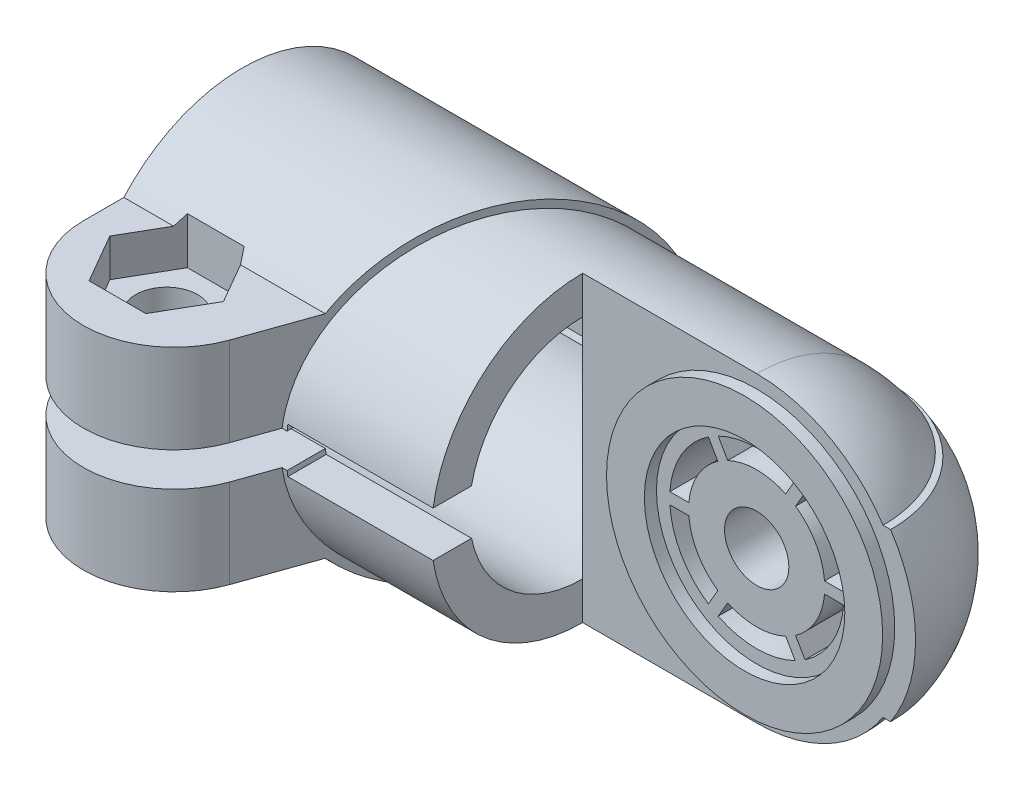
ISO-10303-21;
HEADER;
FILE_DESCRIPTION(('STEP AP214'),'2;1');
FILE_NAME('part.step','',(''),(''),'','','');
FILE_SCHEMA(('AUTOMOTIVE_DESIGN { 1 0 10303 214 1 1 1 1 }'));
ENDSEC;
DATA;
#1=APPLICATION_CONTEXT('core data for automotive mechanical design processes');
#2=APPLICATION_PROTOCOL_DEFINITION('international standard','automotive_design',2000,#1);
#3=PRODUCT_CONTEXT('',#1,'mechanical');
#4=PRODUCT('Part','Part','',(#3));
#5=PRODUCT_RELATED_PRODUCT_CATEGORY('part','',(#4));
#6=PRODUCT_DEFINITION_FORMATION('','',#4);
#7=PRODUCT_DEFINITION_CONTEXT('part definition',#1,'design');
#8=PRODUCT_DEFINITION('design','',#6,#7);
#9=PRODUCT_DEFINITION_SHAPE('','',#8);
#10=(LENGTH_UNIT() NAMED_UNIT(*) SI_UNIT(.MILLI.,.METRE.));
#11=(NAMED_UNIT(*) PLANE_ANGLE_UNIT() SI_UNIT($,.RADIAN.));
#12=(NAMED_UNIT(*) SI_UNIT($,.STERADIAN.) SOLID_ANGLE_UNIT());
#13=UNCERTAINTY_MEASURE_WITH_UNIT(LENGTH_MEASURE(1.E-05),#10,'distance_accuracy_value','');
#14=(GEOMETRIC_REPRESENTATION_CONTEXT(3) GLOBAL_UNCERTAINTY_ASSIGNED_CONTEXT((#13)) GLOBAL_UNIT_ASSIGNED_CONTEXT((#10,
#11,#12)) REPRESENTATION_CONTEXT('',''));
#15=CARTESIAN_POINT('',(0.,0.,0.));
#16=DIRECTION('',(0.,0.,1.));
#17=DIRECTION('',(1.,0.,0.));
#18=AXIS2_PLACEMENT_3D('',#15,#16,#17);
#19=CARTESIAN_POINT('',(0.,0.,0.));
#20=DIRECTION('',(1.,0.,0.));
#21=DIRECTION('',(0.,1.,0.));
#22=AXIS2_PLACEMENT_3D('',#19,#20,#21);
#23=PLANE('',#22);
#24=DIRECTION('',(0.,-1.,0.));
#25=VECTOR('',#24,1.);
#26=CARTESIAN_POINT('',(1.39645239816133E-13,-20.,0.));
#27=LINE('',#26,#25);
#28=CARTESIAN_POINT('',(-1.38777878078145E-13,20.,0.));
#29=VERTEX_POINT('',#28);
#30=CARTESIAN_POINT('',(-1.047339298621E-13,15.,0.));
#31=VERTEX_POINT('',#30);
#32=EDGE_CURVE('E26',#29,#31,#27,.T.);
#33=ORIENTED_EDGE('',*,*,#32,.F.);
#34=CARTESIAN_POINT('',(0.,0.,0.));
#35=DIRECTION('',(-1.,0.,0.));
#36=DIRECTION('',(0.,0.,1.));
#37=AXIS2_PLACEMENT_3D('',#34,#35,#36);
#38=CIRCLE('',#37,20.);
#39=CARTESIAN_POINT('',(0.,2.99999999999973,19.7737199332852));
#40=VERTEX_POINT('',#39);
#41=EDGE_CURVE('E1293',#40,#29,#38,.T.);
#42=ORIENTED_EDGE('',*,*,#41,.F.);
#43=DIRECTION('',(0.,0.,-1.));
#44=VECTOR('',#43,1.);
#45=CARTESIAN_POINT('',(0.,3.00000000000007,18.6603858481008));
#46=LINE('',#45,#44);
#47=CARTESIAN_POINT('',(0.,3.00000000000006,14.6969384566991));
#48=VERTEX_POINT('',#47);
#49=EDGE_CURVE('E882',#40,#48,#46,.T.);
#50=ORIENTED_EDGE('',*,*,#49,.T.);
#51=CARTESIAN_POINT('',(0.,0.,0.));
#52=DIRECTION('',(-1.,0.,0.));
#53=DIRECTION('',(0.,0.200000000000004,0.97979589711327));
#54=AXIS2_PLACEMENT_3D('',#51,#52,#53);
#55=CIRCLE('',#54,15.);
#56=EDGE_CURVE('E879',#48,#31,#55,.T.);
#57=ORIENTED_EDGE('',*,*,#56,.T.);
#58=EDGE_LOOP('',(#33,#42,#50,#57));
#59=FACE_BOUND('',#58,.T.);
#60=ADVANCED_FACE('F14',(#59),#23,.T.);
#61=CARTESIAN_POINT('',(1.047339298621E-13,-15.,0.));
#62=VERTEX_POINT('',#61);
#63=CARTESIAN_POINT('',(0.,-20.,0.));
#64=VERTEX_POINT('',#63);
#65=EDGE_CURVE('E9',#62,#64,#27,.T.);
#66=ORIENTED_EDGE('',*,*,#65,.F.);
#67=CARTESIAN_POINT('',(0.,0.,0.));
#68=DIRECTION('',(-1.,0.,0.));
#69=DIRECTION('',(0.,-1.,0.));
#70=AXIS2_PLACEMENT_3D('',#67,#68,#69);
#71=CIRCLE('',#70,15.);
#72=CARTESIAN_POINT('',(0.,-2.99999999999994,14.6969384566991));
#73=VERTEX_POINT('',#72);
#74=EDGE_CURVE('E892',#62,#73,#71,.T.);
#75=ORIENTED_EDGE('',*,*,#74,.T.);
#76=DIRECTION('',(0.,0.,1.));
#77=VECTOR('',#76,1.);
#78=CARTESIAN_POINT('',(0.,-2.99999999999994,14.6969384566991));
#79=LINE('',#78,#77);
#80=CARTESIAN_POINT('',(0.,-3.,19.7737199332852));
#81=VERTEX_POINT('',#80);
#82=EDGE_CURVE('E887',#81,#73,#79,.F.);
#83=ORIENTED_EDGE('',*,*,#82,.F.);
#84=EDGE_CURVE('E1298',#64,#81,#38,.T.);
#85=ORIENTED_EDGE('',*,*,#84,.F.);
#86=EDGE_LOOP('',(#66,#75,#83,#85));
#87=FACE_BOUND('',#86,.T.);
#88=ADVANCED_FACE('F1383',(#87),#23,.T.);
#89=CARTESIAN_POINT('',(-0.999999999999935,-9.,0.));
#90=DIRECTION('',(0.,-1.,0.));
#91=DIRECTION('',(1.,0.,0.));
#92=AXIS2_PLACEMENT_3D('',#89,#90,#91);
#93=PLANE('',#92);
#94=CARTESIAN_POINT('',(-34.,-9.00000000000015,21.));
#95=DIRECTION('',(0.,-1.,0.));
#96=DIRECTION('',(1.,0.,0.));
#97=AXIS2_PLACEMENT_3D('',#94,#95,#96);
#98=CIRCLE('',#97,4.1);
#99=CARTESIAN_POINT('',(-29.9,-9.00000000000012,21.));
#100=VERTEX_POINT('',#99);
#101=EDGE_CURVE('E24',#100,#100,#98,.T.);
#102=ORIENTED_EDGE('',*,*,#101,.F.);
#103=EDGE_LOOP('',(#102));
#104=FACE_BOUND('',#103,.T.);
#105=DIRECTION('',(0.499999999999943,0.,0.866025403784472));
#106=VECTOR('',#105,1.);
#107=CARTESIAN_POINT('',(-30.2472232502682,-9.00000000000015,14.5));
#108=LINE('',#107,#106);
#109=CARTESIAN_POINT('',(-30.2472232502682,-9.00000000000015,14.5));
#110=VERTEX_POINT('',#109);
#111=CARTESIAN_POINT('',(-26.494446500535,-9.0000000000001,21.));
#112=VERTEX_POINT('',#111);
#113=EDGE_CURVE('E912',#110,#112,#108,.T.);
#114=ORIENTED_EDGE('',*,*,#113,.T.);
#115=DIRECTION('',(-0.499999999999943,0.,0.866025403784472));
#116=VECTOR('',#115,1.);
#117=CARTESIAN_POINT('',(-26.494446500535,-9.0000000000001,21.));
#118=LINE('',#117,#116);
#119=CARTESIAN_POINT('',(-30.2472232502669,-9.0000000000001,27.5));
#120=VERTEX_POINT('',#119);
#121=EDGE_CURVE('E915',#112,#120,#118,.T.);
#122=ORIENTED_EDGE('',*,*,#121,.T.);
#123=DIRECTION('',(-1.,0.,0.));
#124=VECTOR('',#123,1.);
#125=CARTESIAN_POINT('',(-30.2472232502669,-9.0000000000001,27.5));
#126=LINE('',#125,#124);
#127=CARTESIAN_POINT('',(-37.7527767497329,-9.00000000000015,27.5));
#128=VERTEX_POINT('',#127);
#129=EDGE_CURVE('E918',#120,#128,#126,.T.);
#130=ORIENTED_EDGE('',*,*,#129,.T.);
#131=DIRECTION('',(-0.499999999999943,0.,-0.866025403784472));
#132=VECTOR('',#131,1.);
#133=CARTESIAN_POINT('',(-37.7527767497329,-9.00000000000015,27.5));
#134=LINE('',#133,#132);
#135=CARTESIAN_POINT('',(-41.505553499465,-9.0000000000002,21.));
#136=VERTEX_POINT('',#135);
#137=EDGE_CURVE('E921',#128,#136,#134,.T.);
#138=ORIENTED_EDGE('',*,*,#137,.T.);
#139=DIRECTION('',(0.499999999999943,0.,-0.866025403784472));
#140=VECTOR('',#139,1.);
#141=CARTESIAN_POINT('',(-41.505553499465,-9.0000000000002,21.));
#142=LINE('',#141,#140);
#143=CARTESIAN_POINT('',(-37.7527767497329,-9.0000000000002,14.5));
#144=VERTEX_POINT('',#143);
#145=EDGE_CURVE('E924',#136,#144,#142,.T.);
#146=ORIENTED_EDGE('',*,*,#145,.T.);
#147=DIRECTION('',(1.,0.,0.));
#148=VECTOR('',#147,1.);
#149=CARTESIAN_POINT('',(-37.7527767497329,-9.0000000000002,14.5));
#150=LINE('',#149,#148);
#151=EDGE_CURVE('E927',#144,#110,#150,.T.);
#152=ORIENTED_EDGE('',*,*,#151,.T.);
#153=EDGE_LOOP('',(#114,#122,#130,#138,#146,#152));
#154=FACE_BOUND('',#153,.T.);
#155=ADVANCED_FACE('F1391',(#104,#154),#93,.T.);
#156=CARTESIAN_POINT('',(-26.4944465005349,-14.,21.));
#157=DIRECTION('',(-0.866025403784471,0.,-0.499999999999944));
#158=DIRECTION('',(-0.499999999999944,0.,0.866025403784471));
#159=AXIS2_PLACEMENT_3D('',#156,#157,#158);
#160=PLANE('',#159);
#161=DIRECTION('',(0.499999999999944,0.,-0.866025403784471));
#162=VECTOR('',#161,1.);
#163=CARTESIAN_POINT('',(-30.2472232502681,-14.,27.5));
#164=LINE('',#163,#162);
#165=CARTESIAN_POINT('',(-26.4944465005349,-14.,21.));
#166=VERTEX_POINT('',#165);
#167=CARTESIAN_POINT('',(-30.2472232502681,-14.,27.5));
#168=VERTEX_POINT('',#167);
#169=EDGE_CURVE('E1236',#166,#168,#164,.F.);
#170=ORIENTED_EDGE('',*,*,#169,.T.);
#171=DIRECTION('',(0.,1.,0.));
#172=VECTOR('',#171,1.);
#173=CARTESIAN_POINT('',(-30.2472232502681,-14.,27.5));
#174=LINE('',#173,#172);
#175=EDGE_CURVE('E2069',#120,#168,#174,.F.);
#176=ORIENTED_EDGE('',*,*,#175,.F.);
#177=ORIENTED_EDGE('',*,*,#121,.F.);
#178=DIRECTION('',(0.,-1.,0.));
#179=VECTOR('',#178,1.);
#180=CARTESIAN_POINT('',(-26.494446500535,-10.,21.));
#181=LINE('',#180,#179);
#182=EDGE_CURVE('E2067',#112,#166,#181,.T.);
#183=ORIENTED_EDGE('',*,*,#182,.T.);
#184=EDGE_LOOP('',(#170,#176,#177,#183));
#185=FACE_BOUND('',#184,.T.);
#186=ADVANCED_FACE('F1398',(#185),#160,.T.);
#187=CARTESIAN_POINT('',(-30.2472232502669,-10.,27.5));
#188=DIRECTION('',(0.,0.,-1.));
#189=DIRECTION('',(0.,-1.,0.));
#190=AXIS2_PLACEMENT_3D('',#187,#188,#189);
#191=PLANE('',#190);
#192=DIRECTION('',(1.,0.,0.));
#193=VECTOR('',#192,1.);
#194=CARTESIAN_POINT('',(-37.7527767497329,-14.0000000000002,27.5));
#195=LINE('',#194,#193);
#196=CARTESIAN_POINT('',(-37.7527767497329,-14.0000000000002,27.5));
#197=VERTEX_POINT('',#196);
#198=EDGE_CURVE('E1232',#168,#197,#195,.F.);
#199=ORIENTED_EDGE('',*,*,#198,.T.);
#200=DIRECTION('',(0.,-1.,0.));
#201=VECTOR('',#200,1.);
#202=CARTESIAN_POINT('',(-37.7527767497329,-10.0000000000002,27.5));
#203=LINE('',#202,#201);
#204=EDGE_CURVE('E1297',#128,#197,#203,.T.);
#205=ORIENTED_EDGE('',*,*,#204,.F.);
#206=ORIENTED_EDGE('',*,*,#129,.F.);
#207=ORIENTED_EDGE('',*,*,#175,.T.);
#208=EDGE_LOOP('',(#199,#205,#206,#207));
#209=FACE_BOUND('',#208,.T.);
#210=ADVANCED_FACE('F1403',(#209),#191,.T.);
#211=CARTESIAN_POINT('',(-37.7527767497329,-14.0000000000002,27.5));
#212=DIRECTION('',(0.866025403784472,0.,-0.499999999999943));
#213=DIRECTION('',(-0.499999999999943,0.,-0.866025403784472));
#214=AXIS2_PLACEMENT_3D('',#211,#212,#213);
#215=PLANE('',#214);
#216=DIRECTION('',(0.499999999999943,0.,0.866025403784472));
#217=VECTOR('',#216,1.);
#218=CARTESIAN_POINT('',(-41.5055534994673,-14.0000000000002,21.));
#219=LINE('',#218,#217);
#220=CARTESIAN_POINT('',(-41.5055534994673,-14.0000000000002,21.));
#221=VERTEX_POINT('',#220);
#222=EDGE_CURVE('E1228',#197,#221,#219,.F.);
#223=ORIENTED_EDGE('',*,*,#222,.T.);
#224=DIRECTION('',(0.,-1.,0.));
#225=VECTOR('',#224,1.);
#226=CARTESIAN_POINT('',(-41.505553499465,-10.0000000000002,21.));
#227=LINE('',#226,#225);
#228=EDGE_CURVE('E1300',#136,#221,#227,.T.);
#229=ORIENTED_EDGE('',*,*,#228,.F.);
#230=ORIENTED_EDGE('',*,*,#137,.F.);
#231=ORIENTED_EDGE('',*,*,#204,.T.);
#232=EDGE_LOOP('',(#223,#229,#230,#231));
#233=FACE_BOUND('',#232,.T.);
#234=ADVANCED_FACE('F2035',(#233),#215,.T.);
#235=CARTESIAN_POINT('',(-41.5055534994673,-15.1904575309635,21.));
#236=DIRECTION('',(0.866025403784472,0.,0.499999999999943));
#237=DIRECTION('',(0.499999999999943,0.,-0.866025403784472));
#238=AXIS2_PLACEMENT_3D('',#235,#236,#237);
#239=PLANE('',#238);
#240=CARTESIAN_POINT('',(-38.4181588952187,-14.0000001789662,15.6524756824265));
#241=CARTESIAN_POINT('',(-38.2054929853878,-14.4118259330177,15.2841275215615));
#242=CARTESIAN_POINT('',(-37.983526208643,-14.8089540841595,14.8996697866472));
#243=CARTESIAN_POINT('',(-37.7527767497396,-15.1904575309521,14.5000000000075));
#244=B_SPLINE_CURVE_WITH_KNOTS('',3,(#240,#241,#242,#243),.UNSPECIFIED.,.F.,.F.,(4,4),(0.,1.),.UNSPECIFIED.);
#245=CARTESIAN_POINT('',(-38.4181588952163,-14.0000001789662,15.6524756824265));
#246=VERTEX_POINT('',#245);
#247=CARTESIAN_POINT('',(-37.7527767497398,-15.1904575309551,14.5000000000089));
#248=VERTEX_POINT('',#247);
#249=EDGE_CURVE('E1098',#246,#248,#244,.T.);
#250=ORIENTED_EDGE('',*,*,#249,.T.);
#251=DIRECTION('',(-1.32088929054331E-12,-1.,0.));
#252=VECTOR('',#251,1.);
#253=CARTESIAN_POINT('',(-37.7527767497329,-10.0000000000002,14.5));
#254=LINE('',#253,#252);
#255=EDGE_CURVE('E2073',#144,#248,#254,.T.);
#256=ORIENTED_EDGE('',*,*,#255,.F.);
#257=ORIENTED_EDGE('',*,*,#145,.F.);
#258=ORIENTED_EDGE('',*,*,#228,.T.);
#259=DIRECTION('',(-0.499999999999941,0.,0.866025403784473));
#260=VECTOR('',#259,1.);
#261=CARTESIAN_POINT('',(-38.4181588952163,-14.0000000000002,15.6524756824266));
#262=LINE('',#261,#260);
#263=EDGE_CURVE('E1224',#221,#246,#262,.F.);
#264=ORIENTED_EDGE('',*,*,#263,.T.);
#265=EDGE_LOOP('',(#250,#256,#257,#258,#264));
#266=FACE_BOUND('',#265,.T.);
#267=ADVANCED_FACE('F2039',(#266),#239,.T.);
#268=CARTESIAN_POINT('',(-30.2472232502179,-15.190457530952,14.5));
#269=DIRECTION('',(0.,0.,1.));
#270=DIRECTION('',(0.,1.,0.));
#271=AXIS2_PLACEMENT_3D('',#268,#269,#270);
#272=PLANE('',#271);
#273=DIRECTION('',(-1.,-9.67670437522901E-12,-1.01302857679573E-11));
#274=VECTOR('',#273,1.);
#275=CARTESIAN_POINT('',(-30.2472232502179,-15.1904575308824,14.5000000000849));
#276=LINE('',#275,#274);
#277=CARTESIAN_POINT('',(-30.2472232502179,-15.1904575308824,14.5000000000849));
#278=VERTEX_POINT('',#277);
#279=EDGE_CURVE('E1067',#248,#278,#276,.F.);
#280=ORIENTED_EDGE('',*,*,#279,.T.);
#281=DIRECTION('',(-9.44582748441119E-12,1.,0.));
#282=VECTOR('',#281,1.);
#283=CARTESIAN_POINT('',(-30.2472232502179,-15.1904575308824,14.5));
#284=LINE('',#283,#282);
#285=EDGE_CURVE('E2077',#110,#278,#284,.F.);
#286=ORIENTED_EDGE('',*,*,#285,.F.);
#287=ORIENTED_EDGE('',*,*,#151,.F.);
#288=ORIENTED_EDGE('',*,*,#255,.T.);
#289=EDGE_LOOP('',(#280,#286,#287,#288));
#290=FACE_BOUND('',#289,.T.);
#291=ADVANCED_FACE('F2044',(#290),#272,.T.);
#292=CARTESIAN_POINT('',(-30.2472232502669,-15.1904575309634,14.5));
#293=DIRECTION('',(-0.866025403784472,0.,0.499999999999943));
#294=DIRECTION('',(0.499999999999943,0.,0.866025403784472));
#295=AXIS2_PLACEMENT_3D('',#292,#293,#294);
#296=PLANE('',#295);
#297=CARTESIAN_POINT('',(-30.2472232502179,-15.1904575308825,14.5000000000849));
#298=CARTESIAN_POINT('',(-30.0164737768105,-14.8089540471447,14.8996698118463));
#299=CARTESIAN_POINT('',(-29.794506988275,-14.4118258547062,15.2841275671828));
#300=CARTESIAN_POINT('',(-29.581841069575,-14.0000000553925,15.6524757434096));
#301=B_SPLINE_CURVE_WITH_KNOTS('',3,(#297,#298,#299,#300),.UNSPECIFIED.,.F.,.F.,(4,4),(0.,1.),.UNSPECIFIED.);
#302=CARTESIAN_POINT('',(-29.581841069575,-14.0000000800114,15.6524757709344));
#303=VERTEX_POINT('',#302);
#304=EDGE_CURVE('E1078',#278,#303,#301,.T.);
#305=ORIENTED_EDGE('',*,*,#304,.T.);
#306=DIRECTION('',(-0.499999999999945,0.,-0.866025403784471));
#307=VECTOR('',#306,1.);
#308=CARTESIAN_POINT('',(-26.4944465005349,-14.,21.));
#309=LINE('',#308,#307);
#310=EDGE_CURVE('E1208',#303,#166,#309,.F.);
#311=ORIENTED_EDGE('',*,*,#310,.T.);
#312=ORIENTED_EDGE('',*,*,#182,.F.);
#313=ORIENTED_EDGE('',*,*,#113,.F.);
#314=ORIENTED_EDGE('',*,*,#285,.T.);
#315=EDGE_LOOP('',(#305,#311,#312,#313,#314));
#316=FACE_BOUND('',#315,.T.);
#317=ADVANCED_FACE('F1374',(#316),#296,.T.);
#318=CARTESIAN_POINT('',(-30.2472232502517,9.99999999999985,14.5));
#319=DIRECTION('',(0.,0.,1.));
#320=DIRECTION('',(0.,1.,0.));
#321=AXIS2_PLACEMENT_3D('',#318,#319,#320);
#322=PLANE('',#321);
#323=DIRECTION('',(1.,-1.53807419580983E-11,1.61202257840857E-11));
#324=VECTOR('',#323,1.);
#325=CARTESIAN_POINT('',(-37.7527767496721,15.1904575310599,14.4999999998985));
#326=LINE('',#325,#324);
#327=CARTESIAN_POINT('',(-30.247223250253,15.1904575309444,14.5000000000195));
#328=VERTEX_POINT('',#327);
#329=CARTESIAN_POINT('',(-37.7527767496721,15.1904575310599,14.4999999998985));
#330=VERTEX_POINT('',#329);
#331=EDGE_CURVE('E1125',#328,#330,#326,.F.);
#332=ORIENTED_EDGE('',*,*,#331,.T.);
#333=DIRECTION('',(-1.1270348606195E-11,-1.,0.));
#334=VECTOR('',#333,1.);
#335=CARTESIAN_POINT('',(-37.7527767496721,15.1904575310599,14.5));
#336=LINE('',#335,#334);
#337=CARTESIAN_POINT('',(-37.7527767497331,9.99999999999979,14.5));
#338=VERTEX_POINT('',#337);
#339=EDGE_CURVE('E1136',#330,#338,#336,.T.);
#340=ORIENTED_EDGE('',*,*,#339,.T.);
#341=DIRECTION('',(0.,1.,0.));
#342=VECTOR('',#341,1.);
#343=CARTESIAN_POINT('',(-37.7527767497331,8.99999999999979,14.5));
#344=LINE('',#343,#342);
#345=CARTESIAN_POINT('',(-37.7527767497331,8.99999999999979,14.5));
#346=VERTEX_POINT('',#345);
#347=EDGE_CURVE('E951',#346,#338,#344,.T.);
#348=ORIENTED_EDGE('',*,*,#347,.F.);
#349=DIRECTION('',(-1.,0.,0.));
#350=VECTOR('',#349,1.);
#351=CARTESIAN_POINT('',(-30.2472232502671,8.99999999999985,14.5));
#352=LINE('',#351,#350);
#353=CARTESIAN_POINT('',(-30.2472232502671,8.99999999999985,14.5));
#354=VERTEX_POINT('',#353);
#355=EDGE_CURVE('E942',#354,#346,#352,.T.);
#356=ORIENTED_EDGE('',*,*,#355,.F.);
#357=DIRECTION('',(2.94582162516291E-12,1.,0.));
#358=VECTOR('',#357,1.);
#359=CARTESIAN_POINT('',(-30.2472232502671,9.99999999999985,14.5));
#360=LINE('',#359,#358);
#361=EDGE_CURVE('E1138',#328,#354,#360,.F.);
#362=ORIENTED_EDGE('',*,*,#361,.F.);
#363=EDGE_LOOP('',(#332,#340,#348,#356,#362));
#364=FACE_BOUND('',#363,.T.);
#365=ADVANCED_FACE('F1135',(#364),#322,.T.);
#366=CARTESIAN_POINT('',(-41.505553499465,9.99999999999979,21.));
#367=DIRECTION('',(0.866025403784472,0.,0.499999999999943));
#368=DIRECTION('',(0.499999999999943,0.,-0.866025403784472));
#369=AXIS2_PLACEMENT_3D('',#366,#367,#368);
#370=PLANE('',#369);
#371=CARTESIAN_POINT('',(-37.7527767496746,15.1904575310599,14.4999999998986));
#372=CARTESIAN_POINT('',(-37.983526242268,14.8089540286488,14.8996698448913));
#373=CARTESIAN_POINT('',(-38.2054930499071,14.4118258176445,15.2841276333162));
#374=CARTESIAN_POINT('',(-38.4181589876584,13.9999999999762,15.6524758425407));
#375=B_SPLINE_CURVE_WITH_KNOTS('',3,(#371,#372,#373,#374),.UNSPECIFIED.,.F.,.F.,(4,4),(0.,1.),.UNSPECIFIED.);
#376=CARTESIAN_POINT('',(-38.4181589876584,13.9999999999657,15.6524758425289));
#377=VERTEX_POINT('',#376);
#378=EDGE_CURVE('E1119',#330,#377,#375,.T.);
#379=ORIENTED_EDGE('',*,*,#378,.T.);
#380=DIRECTION('',(0.499999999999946,0.,-0.86602540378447));
#381=VECTOR('',#380,1.);
#382=CARTESIAN_POINT('',(-41.5055534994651,13.9999999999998,21.));
#383=LINE('',#382,#381);
#384=CARTESIAN_POINT('',(-41.5055534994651,13.9999999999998,21.));
#385=VERTEX_POINT('',#384);
#386=EDGE_CURVE('E1258',#385,#377,#383,.T.);
#387=ORIENTED_EDGE('',*,*,#386,.F.);
#388=DIRECTION('',(0.,-1.,0.));
#389=VECTOR('',#388,1.);
#390=CARTESIAN_POINT('',(-41.5055534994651,13.9999999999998,21.));
#391=LINE('',#390,#389);
#392=CARTESIAN_POINT('',(-41.505553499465,8.99999999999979,21.));
#393=VERTEX_POINT('',#392);
#394=EDGE_CURVE('E2089',#385,#393,#391,.T.);
#395=ORIENTED_EDGE('',*,*,#394,.T.);
#396=DIRECTION('',(-0.499999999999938,0.,0.866025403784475));
#397=VECTOR('',#396,1.);
#398=CARTESIAN_POINT('',(-37.7527767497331,8.99999999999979,14.5));
#399=LINE('',#398,#397);
#400=EDGE_CURVE('E945',#346,#393,#399,.T.);
#401=ORIENTED_EDGE('',*,*,#400,.F.);
#402=ORIENTED_EDGE('',*,*,#347,.T.);
#403=ORIENTED_EDGE('',*,*,#339,.F.);
#404=EDGE_LOOP('',(#379,#387,#395,#401,#402,#403));
#405=FACE_BOUND('',#404,.T.);
#406=ADVANCED_FACE('F1369',(#405),#370,.T.);
#407=CARTESIAN_POINT('',(-37.7527767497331,9.99999999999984,27.5));
#408=DIRECTION('',(0.866025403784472,0.,-0.499999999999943));
#409=DIRECTION('',(-0.499999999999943,0.,-0.866025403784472));
#410=AXIS2_PLACEMENT_3D('',#407,#408,#409);
#411=PLANE('',#410);
#412=DIRECTION('',(0.,-1.,0.));
#413=VECTOR('',#412,1.);
#414=CARTESIAN_POINT('',(-37.7527767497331,13.9999999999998,27.5));
#415=LINE('',#414,#413);
#416=CARTESIAN_POINT('',(-37.7527767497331,13.9999999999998,27.5));
#417=VERTEX_POINT('',#416);
#418=CARTESIAN_POINT('',(-37.7527767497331,8.99999999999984,27.5));
#419=VERTEX_POINT('',#418);
#420=EDGE_CURVE('E2081',#417,#419,#415,.T.);
#421=ORIENTED_EDGE('',*,*,#420,.T.);
#422=DIRECTION('',(0.499999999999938,0.,0.866025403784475));
#423=VECTOR('',#422,1.);
#424=CARTESIAN_POINT('',(-41.505553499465,8.99999999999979,21.));
#425=LINE('',#424,#423);
#426=EDGE_CURVE('E948',#393,#419,#425,.T.);
#427=ORIENTED_EDGE('',*,*,#426,.F.);
#428=ORIENTED_EDGE('',*,*,#394,.F.);
#429=DIRECTION('',(-0.499999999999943,0.,-0.866025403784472));
#430=VECTOR('',#429,1.);
#431=CARTESIAN_POINT('',(-37.7527767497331,13.9999999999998,27.5));
#432=LINE('',#431,#430);
#433=EDGE_CURVE('E1253',#417,#385,#432,.T.);
#434=ORIENTED_EDGE('',*,*,#433,.F.);
#435=EDGE_LOOP('',(#421,#427,#428,#434));
#436=FACE_BOUND('',#435,.T.);
#437=ADVANCED_FACE('F2114',(#436),#411,.T.);
#438=CARTESIAN_POINT('',(-30.2472232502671,14.,27.5));
#439=DIRECTION('',(0.,0.,-1.));
#440=DIRECTION('',(0.,-1.,0.));
#441=AXIS2_PLACEMENT_3D('',#438,#439,#440);
#442=PLANE('',#441);
#443=DIRECTION('',(0.,1.,0.));
#444=VECTOR('',#443,1.);
#445=CARTESIAN_POINT('',(-30.2472232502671,9.99999999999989,27.5));
#446=LINE('',#445,#444);
#447=CARTESIAN_POINT('',(-30.2472232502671,14.,27.5));
#448=VERTEX_POINT('',#447);
#449=CARTESIAN_POINT('',(-30.2472232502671,8.99999999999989,27.5));
#450=VERTEX_POINT('',#449);
#451=EDGE_CURVE('E2085',#448,#450,#446,.F.);
#452=ORIENTED_EDGE('',*,*,#451,.T.);
#453=DIRECTION('',(1.,0.,0.));
#454=VECTOR('',#453,1.);
#455=CARTESIAN_POINT('',(-37.7527767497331,8.99999999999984,27.5));
#456=LINE('',#455,#454);
#457=EDGE_CURVE('E933',#419,#450,#456,.T.);
#458=ORIENTED_EDGE('',*,*,#457,.F.);
#459=ORIENTED_EDGE('',*,*,#420,.F.);
#460=DIRECTION('',(-1.,0.,0.));
#461=VECTOR('',#460,1.);
#462=CARTESIAN_POINT('',(-30.2472232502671,14.,27.5));
#463=LINE('',#462,#461);
#464=EDGE_CURVE('E1248',#448,#417,#463,.T.);
#465=ORIENTED_EDGE('',*,*,#464,.F.);
#466=EDGE_LOOP('',(#452,#458,#459,#465));
#467=FACE_BOUND('',#466,.T.);
#468=ADVANCED_FACE('F2111',(#467),#442,.T.);
#469=CARTESIAN_POINT('',(-26.4944465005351,10.,21.));
#470=DIRECTION('',(-0.866025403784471,0.,-0.499999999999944));
#471=DIRECTION('',(-0.499999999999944,0.,0.866025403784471));
#472=AXIS2_PLACEMENT_3D('',#469,#470,#471);
#473=PLANE('',#472);
#474=DIRECTION('',(0.,1.,0.));
#475=VECTOR('',#474,1.);
#476=CARTESIAN_POINT('',(-26.4944465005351,10.,21.));
#477=LINE('',#476,#475);
#478=CARTESIAN_POINT('',(-26.4944465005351,14.,21.));
#479=VERTEX_POINT('',#478);
#480=CARTESIAN_POINT('',(-26.4944465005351,8.99999999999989,21.));
#481=VERTEX_POINT('',#480);
#482=EDGE_CURVE('E1349',#479,#481,#477,.F.);
#483=ORIENTED_EDGE('',*,*,#482,.T.);
#484=DIRECTION('',(0.499999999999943,0.,-0.866025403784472));
#485=VECTOR('',#484,1.);
#486=CARTESIAN_POINT('',(-30.2472232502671,8.99999999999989,27.5));
#487=LINE('',#486,#485);
#488=EDGE_CURVE('E936',#450,#481,#487,.T.);
#489=ORIENTED_EDGE('',*,*,#488,.F.);
#490=ORIENTED_EDGE('',*,*,#451,.F.);
#491=DIRECTION('',(-0.499999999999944,0.,0.866025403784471));
#492=VECTOR('',#491,1.);
#493=CARTESIAN_POINT('',(-26.4944465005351,14.,21.));
#494=LINE('',#493,#492);
#495=EDGE_CURVE('E1244',#479,#448,#494,.T.);
#496=ORIENTED_EDGE('',*,*,#495,.F.);
#497=EDGE_LOOP('',(#483,#489,#490,#496));
#498=FACE_BOUND('',#497,.T.);
#499=ADVANCED_FACE('F1368',(#498),#473,.T.);
#500=CARTESIAN_POINT('',(-30.2472232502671,9.99999999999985,14.5));
#501=DIRECTION('',(-0.866025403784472,0.,0.499999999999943));
#502=DIRECTION('',(0.499999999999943,0.,0.866025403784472));
#503=AXIS2_PLACEMENT_3D('',#500,#501,#502);
#504=PLANE('',#503);
#505=CARTESIAN_POINT('',(-29.581841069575,14.0000001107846,15.6524757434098));
#506=CARTESIAN_POINT('',(-29.794506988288,14.4118258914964,15.2841275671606));
#507=CARTESIAN_POINT('',(-30.0164737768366,14.8089540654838,14.8996698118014));
#508=CARTESIAN_POINT('',(-30.2472232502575,15.1904575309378,14.5000000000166));
#509=B_SPLINE_CURVE_WITH_KNOTS('',3,(#505,#506,#507,#508),.UNSPECIFIED.,.F.,.F.,(4,4),(0.,1.),.UNSPECIFIED.);
#510=CARTESIAN_POINT('',(-29.5818410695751,14.0000001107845,15.6524757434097));
#511=VERTEX_POINT('',#510);
#512=EDGE_CURVE('E1139',#511,#328,#509,.T.);
#513=ORIENTED_EDGE('',*,*,#512,.T.);
#514=ORIENTED_EDGE('',*,*,#361,.T.);
#515=DIRECTION('',(-0.499999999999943,0.,-0.866025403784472));
#516=VECTOR('',#515,1.);
#517=CARTESIAN_POINT('',(-26.4944465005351,8.99999999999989,21.));
#518=LINE('',#517,#516);
#519=EDGE_CURVE('E939',#481,#354,#518,.T.);
#520=ORIENTED_EDGE('',*,*,#519,.F.);
#521=ORIENTED_EDGE('',*,*,#482,.F.);
#522=DIRECTION('',(0.499999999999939,0.,0.866025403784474));
#523=VECTOR('',#522,1.);
#524=CARTESIAN_POINT('',(-29.5818410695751,13.9999999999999,15.6524757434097));
#525=LINE('',#524,#523);
#526=EDGE_CURVE('E1152',#511,#479,#525,.T.);
#527=ORIENTED_EDGE('',*,*,#526,.F.);
#528=EDGE_LOOP('',(#513,#514,#520,#521,#527));
#529=FACE_BOUND('',#528,.T.);
#530=ADVANCED_FACE('F1357',(#529),#504,.T.);
#531=CARTESIAN_POINT('',(-1.00000000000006,9.,0.));
#532=DIRECTION('',(0.,1.,0.));
#533=DIRECTION('',(-1.,0.,0.));
#534=AXIS2_PLACEMENT_3D('',#531,#532,#533);
#535=PLANE('',#534);
#536=CARTESIAN_POINT('',(-34.,8.99999999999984,21.));
#537=DIRECTION('',(0.,1.,0.));
#538=DIRECTION('',(-1.,0.,0.));
#539=AXIS2_PLACEMENT_3D('',#536,#537,#538);
#540=CIRCLE('',#539,4.1);
#541=CARTESIAN_POINT('',(-38.1,8.99999999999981,21.));
#542=VERTEX_POINT('',#541);
#543=EDGE_CURVE('E930',#542,#542,#540,.T.);
#544=ORIENTED_EDGE('',*,*,#543,.F.);
#545=EDGE_LOOP('',(#544));
#546=FACE_BOUND('',#545,.T.);
#547=ORIENTED_EDGE('',*,*,#457,.T.);
#548=ORIENTED_EDGE('',*,*,#488,.T.);
#549=ORIENTED_EDGE('',*,*,#519,.T.);
#550=ORIENTED_EDGE('',*,*,#355,.T.);
#551=ORIENTED_EDGE('',*,*,#400,.T.);
#552=ORIENTED_EDGE('',*,*,#426,.T.);
#553=EDGE_LOOP('',(#547,#548,#549,#550,#551,#552));
#554=FACE_BOUND('',#553,.T.);
#555=ADVANCED_FACE('F1367',(#546,#554),#535,.T.);
#556=CARTESIAN_POINT('',(-34.0000000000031,100.,20.9999999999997));
#557=DIRECTION('',(0.,-1.,0.));
#558=DIRECTION('',(-1.,0.,0.));
#559=AXIS2_PLACEMENT_3D('',#556,#557,#558);
#560=CYLINDRICAL_SURFACE('',#559,4.1);
#561=CARTESIAN_POINT('',(-34.0000000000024,-2.25000000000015,21.));
#562=DIRECTION('',(0.,-1.,0.));
#563=DIRECTION('',(-1.,0.,0.));
#564=AXIS2_PLACEMENT_3D('',#561,#562,#563);
#565=CIRCLE('',#564,4.1);
#566=CARTESIAN_POINT('',(-38.1000000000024,-2.25000000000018,21.));
#567=VERTEX_POINT('',#566);
#568=EDGE_CURVE('E2263',#567,#567,#565,.T.);
#569=ORIENTED_EDGE('',*,*,#568,.F.);
#570=EDGE_LOOP('',(#569));
#571=FACE_BOUND('',#570,.T.);
#572=ORIENTED_EDGE('',*,*,#101,.T.);
#573=EDGE_LOOP('',(#572));
#574=FACE_BOUND('',#573,.T.);
#575=ADVANCED_FACE('F1411',(#571,#574),#560,.F.);
#576=CARTESIAN_POINT('',(-33.,13.9999999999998,21.));
#577=DIRECTION('',(0.,-1.,0.));
#578=DIRECTION('',(0.942661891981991,0.,0.333749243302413));
#579=AXIS2_PLACEMENT_3D('',#576,#577,#578);
#580=CYLINDRICAL_SURFACE('',#579,12.);
#581=CARTESIAN_POINT('',(-33.0000000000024,-2.25000000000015,21.));
#582=DIRECTION('',(0.,1.,0.));
#583=DIRECTION('',(-1.,0.,0.));
#584=AXIS2_PLACEMENT_3D('',#581,#582,#583);
#585=CIRCLE('',#584,12.);
#586=CARTESIAN_POINT('',(-45.0000000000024,-2.25000000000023,21.));
#587=VERTEX_POINT('',#586);
#588=CARTESIAN_POINT('',(-21.6880572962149,-2.25000000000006,25.004990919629));
#589=VERTEX_POINT('',#588);
#590=EDGE_CURVE('E2251',#587,#589,#585,.T.);
#591=ORIENTED_EDGE('',*,*,#590,.F.);
#592=DIRECTION('',(0.,1.,0.));
#593=VECTOR('',#592,1.);
#594=CARTESIAN_POINT('',(-45.0000000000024,-14.0000000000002,21.));
#595=LINE('',#594,#593);
#596=CARTESIAN_POINT('',(-45.0000000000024,-14.0000000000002,21.));
#597=VERTEX_POINT('',#596);
#598=EDGE_CURVE('E2266',#587,#597,#595,.F.);
#599=ORIENTED_EDGE('',*,*,#598,.T.);
#600=CARTESIAN_POINT('',(-33.0000000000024,-14.0000000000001,21.));
#601=DIRECTION('',(0.,-1.,0.));
#602=DIRECTION('',(0.942661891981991,0.,0.333749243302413));
#603=AXIS2_PLACEMENT_3D('',#600,#601,#602);
#604=CIRCLE('',#603,12.);
#605=CARTESIAN_POINT('',(-21.6880572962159,-14.,25.004990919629));
#606=VERTEX_POINT('',#605);
#607=EDGE_CURVE('E1211',#597,#606,#604,.F.);
#608=ORIENTED_EDGE('',*,*,#607,.T.);
#609=DIRECTION('',(0.,-1.,0.));
#610=VECTOR('',#609,1.);
#611=CARTESIAN_POINT('',(-21.6880572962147,-2.25000000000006,25.004990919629));
#612=LINE('',#611,#610);
#613=EDGE_CURVE('E1336',#589,#606,#612,.T.);
#614=ORIENTED_EDGE('',*,*,#613,.F.);
#615=EDGE_LOOP('',(#591,#599,#608,#614));
#616=FACE_BOUND('',#615,.T.);
#617=ADVANCED_FACE('F2030',(#616),#580,.T.);
#618=CARTESIAN_POINT('',(-18.3768012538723,-14.,15.6524756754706));
#619=DIRECTION('',(0.,-1.,0.));
#620=DIRECTION('',(0.,0.,1.));
#621=AXIS2_PLACEMENT_3D('',#618,#619,#620);
#622=PLANE('',#621);
#623=ORIENTED_EDGE('',*,*,#310,.F.);
#624=DIRECTION('',(-1.,9.52532434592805E-09,8.51971527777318E-09));
#625=VECTOR('',#624,1.);
#626=CARTESIAN_POINT('',(-18.3768012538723,-14.000000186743,15.6524756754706));
#627=LINE('',#626,#625);
#628=CARTESIAN_POINT('',(-18.3768012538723,-14.000000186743,15.6524756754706));
#629=VERTEX_POINT('',#628);
#630=EDGE_CURVE('E1082',#303,#629,#627,.F.);
#631=ORIENTED_EDGE('',*,*,#630,.T.);
#632=DIRECTION('',(-0.333749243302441,0.,0.942661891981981));
#633=VECTOR('',#632,1.);
#634=CARTESIAN_POINT('',(-18.3768012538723,-14.,15.6524756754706));
#635=LINE('',#634,#633);
#636=EDGE_CURVE('E1209',#606,#629,#635,.F.);
#637=ORIENTED_EDGE('',*,*,#636,.F.);
#638=ORIENTED_EDGE('',*,*,#607,.F.);
#639=DIRECTION('',(0.,0.,-1.));
#640=VECTOR('',#639,1.);
#641=CARTESIAN_POINT('',(-45.0000000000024,-14.0000000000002,21.));
#642=LINE('',#641,#640);
#643=CARTESIAN_POINT('',(-45.,-14.0000000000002,15.6524758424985));
#644=VERTEX_POINT('',#643);
#645=EDGE_CURVE('E1219',#644,#597,#642,.F.);
#646=ORIENTED_EDGE('',*,*,#645,.F.);
#647=DIRECTION('',(-1.,2.71908610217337E-08,2.43202516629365E-08));
#648=VECTOR('',#647,1.);
#649=CARTESIAN_POINT('',(-38.4181588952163,-14.0000001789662,15.6524756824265));
#650=LINE('',#649,#648);
#651=EDGE_CURVE('E1101',#644,#246,#650,.F.);
#652=ORIENTED_EDGE('',*,*,#651,.T.);
#653=ORIENTED_EDGE('',*,*,#263,.F.);
#654=ORIENTED_EDGE('',*,*,#222,.F.);
#655=ORIENTED_EDGE('',*,*,#198,.F.);
#656=ORIENTED_EDGE('',*,*,#169,.F.);
#657=EDGE_LOOP('',(#623,#631,#637,#638,#646,#652,#653,#654,#655,#656));
#658=FACE_BOUND('',#657,.T.);
#659=ADVANCED_FACE('F1027',(#658),#622,.T.);
#660=CARTESIAN_POINT('',(-45.,-3.07250357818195E-13,0.));
#661=DIRECTION('',(-1.,0.,0.));
#662=DIRECTION('',(0.,3.12283532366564E-12,-1.));
#663=AXIS2_PLACEMENT_3D('',#660,#661,#662);
#664=CYLINDRICAL_SURFACE('',#663,21.);
#665=ORIENTED_EDGE('',*,*,#651,.F.);
#666=CARTESIAN_POINT('',(-45.,-3.07250357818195E-13,0.));
#667=DIRECTION('',(1.,0.,0.));
#668=DIRECTION('',(0.,-0.666666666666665,0.745355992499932));
#669=AXIS2_PLACEMENT_3D('',#666,#667,#668);
#670=CIRCLE('',#669,21.);
#671=CARTESIAN_POINT('',(-45.,13.9999999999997,15.6524758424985));
#672=VERTEX_POINT('',#671);
#673=EDGE_CURVE('E1106',#672,#644,#670,.F.);
#674=ORIENTED_EDGE('',*,*,#673,.F.);
#675=DIRECTION('',(1.,-5.16838038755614E-12,4.62911098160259E-12));
#676=VECTOR('',#675,1.);
#677=CARTESIAN_POINT('',(-45.,13.9999999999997,15.6524758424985));
#678=LINE('',#677,#676);
#679=EDGE_CURVE('E1110',#672,#377,#678,.T.);
#680=ORIENTED_EDGE('',*,*,#679,.T.);
#681=ORIENTED_EDGE('',*,*,#378,.F.);
#682=ORIENTED_EDGE('',*,*,#331,.F.);
#683=ORIENTED_EDGE('',*,*,#512,.F.);
#684=DIRECTION('',(1.,-9.62312259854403E-09,8.60718865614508E-09));
#685=VECTOR('',#684,1.);
#686=CARTESIAN_POINT('',(-29.5818410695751,14.0000001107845,15.6524757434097));
#687=LINE('',#686,#685);
#688=CARTESIAN_POINT('',(-18.3768013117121,14.000000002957,15.6524758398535));
#689=VERTEX_POINT('',#688);
#690=EDGE_CURVE('E1140',#511,#689,#687,.T.);
#691=ORIENTED_EDGE('',*,*,#690,.T.);
#692=CARTESIAN_POINT('',(-5.96064221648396,8.00000048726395,-19.4164876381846));
#693=CARTESIAN_POINT('',(-6.30627257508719,10.3693449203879,-18.4402679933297));
#694=CARTESIAN_POINT('',(-6.80252068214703,12.5400055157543,-17.0386343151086));
#695=CARTESIAN_POINT('',(-7.98592250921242,16.0857868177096,-13.6961614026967));
#696=CARTESIAN_POINT('',(-8.64198947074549,17.4955904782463,-11.8431255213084));
#697=CARTESIAN_POINT('',(-10.1077021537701,19.679461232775,-7.70327646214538));
#698=CARTESIAN_POINT('',(-10.9111121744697,20.4262796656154,-5.434075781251));
#699=CARTESIAN_POINT('',(-12.4348270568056,21.0603345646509,-1.13040174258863));
#700=CARTESIAN_POINT('',(-13.1247575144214,21.073127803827,0.818280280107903));
#701=CARTESIAN_POINT('',(-14.480789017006,20.5700766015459,4.64833906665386));
#702=CARTESIAN_POINT('',(-15.1468900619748,20.0542321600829,6.52971583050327));
#703=CARTESIAN_POINT('',(-16.4662352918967,18.4458794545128,10.2561556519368));
#704=CARTESIAN_POINT('',(-17.1035104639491,17.3241699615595,12.0561148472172));
#705=CARTESIAN_POINT('',(-17.9208254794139,15.3469544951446,14.3645896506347));
#706=CARTESIAN_POINT('',(-18.1567529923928,14.694878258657,15.0309578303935));
#707=CARTESIAN_POINT('',(-18.3768013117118,14.0000000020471,15.6524758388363));
#708=B_SPLINE_CURVE_WITH_KNOTS('',3,(#692,#693,#694,#695,#696,#697,#698,#699,#700,#701,#702,
#703,#704,#705,#706,#707),.UNSPECIFIED.,.F.,.F.,(4,2,2,2,2,2,2,4),(0.,0.182064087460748,
0.346202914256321,0.514740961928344,0.651339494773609,0.787938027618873,0.93539626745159,1.),.UNSPECIFIED.);
#709=CARTESIAN_POINT('',(-5.96064214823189,8.00000001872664,-19.4164878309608));
#710=VERTEX_POINT('',#709);
#711=EDGE_CURVE('E1156',#710,#689,#708,.T.);
#712=ORIENTED_EDGE('',*,*,#711,.F.);
#713=CARTESIAN_POINT('',(-12.8350455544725,0.,0.));
#714=DIRECTION('',(0.942661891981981,0.,0.333749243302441));
#715=DIRECTION('',(-0.333749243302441,0.,0.942661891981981));
#716=AXIS2_PLACEMENT_3D('',#713,#714,#715);
#717=ELLIPSE('',#716,22.2773405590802,20.9999999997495);
#718=CARTESIAN_POINT('',(-5.75404978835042,6.40312423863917,-19.9999999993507));
#719=VERTEX_POINT('',#718);
#720=EDGE_CURVE('E994',#719,#710,#717,.T.);
#721=ORIENTED_EDGE('',*,*,#720,.F.);
#722=CARTESIAN_POINT('',(-5.39999993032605,4.21598519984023E-11,-21.0000001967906));
#723=CARTESIAN_POINT('',(-5.39999948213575,0.235321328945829,-21.0000014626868));
#724=CARTESIAN_POINT('',(-5.40139425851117,0.470700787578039,-20.9960619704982));
#725=CARTESIAN_POINT('',(-5.40761661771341,0.994674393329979,-20.9784871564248));
#726=CARTESIAN_POINT('',(-5.41315343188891,1.28296759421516,-20.9628486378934));
#727=CARTESIAN_POINT('',(-5.42832038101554,1.85415603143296,-20.9200101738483));
#728=CARTESIAN_POINT('',(-5.43788723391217,2.13706687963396,-20.8929889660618));
#729=CARTESIAN_POINT('',(-5.46925883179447,2.90044904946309,-20.8043810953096));
#730=CARTESIAN_POINT('',(-5.49393918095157,3.35868244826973,-20.7346723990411));
#731=CARTESIAN_POINT('',(-5.56433800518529,4.43787085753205,-20.5358336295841));
#732=CARTESIAN_POINT('',(-5.61372400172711,5.03587941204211,-20.3963447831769));
#733=CARTESIAN_POINT('',(-5.69693187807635,5.88187407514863,-20.1613273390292));
#734=CARTESIAN_POINT('',(-5.7245849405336,6.14318059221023,-20.0832223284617));
#735=CARTESIAN_POINT('',(-5.75404978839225,6.40312423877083,-19.999999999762));
#736=B_SPLINE_CURVE_WITH_KNOTS('',3,(#722,#723,#724,#725,#726,#727,#728,#729,#730,#731,#732,
#733,#734,#735),.UNSPECIFIED.,.F.,.F.,(4,2,2,2,2,2,4),(0.,0.103072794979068,0.229661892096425,
0.3543332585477,0.566663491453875,0.865452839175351,1.),.UNSPECIFIED.);
#737=CARTESIAN_POINT('',(-5.39999937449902,4.21587706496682E-11,-21.));
#738=VERTEX_POINT('',#737);
#739=EDGE_CURVE('E1157',#738,#719,#736,.T.);
#740=ORIENTED_EDGE('',*,*,#739,.F.);
#741=CARTESIAN_POINT('',(-5.75405018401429,-6.40312772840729,-19.9999988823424));
#742=CARTESIAN_POINT('',(-5.69550772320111,-5.88665668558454,-20.1653498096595));
#743=CARTESIAN_POINT('',(-5.64407020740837,-5.3639745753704,-20.3106330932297));
#744=CARTESIAN_POINT('',(-5.55660247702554,-4.32006875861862,-20.5576823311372));
#745=CARTESIAN_POINT('',(-5.51959890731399,-3.79292233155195,-20.6621974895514));
#746=CARTESIAN_POINT('',(-5.47180208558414,-2.92849746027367,-20.7971977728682));
#747=CARTESIAN_POINT('',(-5.45705833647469,-2.61600280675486,-20.8388409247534));
#748=CARTESIAN_POINT('',(-5.43093792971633,-1.94778737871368,-20.9126170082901));
#749=CARTESIAN_POINT('',(-5.42010246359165,-1.58844565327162,-20.9432213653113));
#750=CARTESIAN_POINT('',(-5.40416993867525,-0.813335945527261,-20.9882221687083));
#751=CARTESIAN_POINT('',(-5.40000065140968,-0.406754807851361,-20.9999981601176));
#752=CARTESIAN_POINT('',(-5.39999993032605,4.21598519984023E-11,-21.0000001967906));
#753=B_SPLINE_CURVE_WITH_KNOTS('',3,(#741,#742,#743,#744,#745,#746,#747,#748,#749,#750,#751,
#752),.UNSPECIFIED.,.F.,.F.,(4,2,2,2,2,4),(0.,0.260315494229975,0.514943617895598,
0.658664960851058,0.821660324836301,1.),.UNSPECIFIED.);
#754=CARTESIAN_POINT('',(-5.75405015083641,-6.40312743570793,-19.9999989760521));
#755=VERTEX_POINT('',#754);
#756=EDGE_CURVE('E1005',#755,#738,#753,.T.);
#757=ORIENTED_EDGE('',*,*,#756,.F.);
#758=CARTESIAN_POINT('',(-12.8350455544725,0.,0.));
#759=DIRECTION('',(0.942661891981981,0.,0.333749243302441));
#760=DIRECTION('',(-0.333749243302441,0.,0.942661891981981));
#761=AXIS2_PLACEMENT_3D('',#758,#759,#760);
#762=ELLIPSE('',#761,22.277340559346,21.);
#763=CARTESIAN_POINT('',(-5.96064225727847,-8.00000076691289,-19.4164875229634));
#764=VERTEX_POINT('',#763);
#765=EDGE_CURVE('E996',#764,#755,#762,.T.);
#766=ORIENTED_EDGE('',*,*,#765,.F.);
#767=CARTESIAN_POINT('',(-18.3768012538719,-14.000000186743,15.6524756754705));
#768=CARTESIAN_POINT('',(-17.9936684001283,-15.2098738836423,14.5703316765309));
#769=CARTESIAN_POINT('',(-17.5669781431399,-16.2772640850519,13.3651614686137));
#770=CARTESIAN_POINT('',(-16.589289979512,-18.2121368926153,10.6037188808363));
#771=CARTESIAN_POINT('',(-16.0379300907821,-19.0329379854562,9.04642409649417));
#772=CARTESIAN_POINT('',(-14.8806820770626,-20.2642170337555,5.77782162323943));
#773=CARTESIAN_POINT('',(-14.289104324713,-20.6650087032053,4.10693303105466));
#774=CARTESIAN_POINT('',(-13.0971716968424,-21.0559371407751,0.740365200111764));
#775=CARTESIAN_POINT('',(-12.4968168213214,-21.0460739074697,-0.955314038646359));
#776=CARTESIAN_POINT('',(-10.7223220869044,-20.4141248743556,-5.96730611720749));
#777=CARTESIAN_POINT('',(-9.5747521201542,-19.1896797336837,-9.20857331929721));
#778=CARTESIAN_POINT('',(-7.76452655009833,-15.6071913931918,-14.3214857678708));
#779=CARTESIAN_POINT('',(-7.07997402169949,-13.5820730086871,-16.2549780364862));
#780=CARTESIAN_POINT('',(-6.3240342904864,-10.2118306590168,-18.3901007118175));
#781=CARTESIAN_POINT('',(-6.12594597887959,-9.13317997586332,-18.9495935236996));
#782=CARTESIAN_POINT('',(-5.96064236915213,-8.0000007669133,-19.4164872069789));
#783=B_SPLINE_CURVE_WITH_KNOTS('',3,(#767,#768,#769,#770,#771,#772,#773,#774,#775,#776,#777,
#778,#779,#780,#781,#782),.UNSPECIFIED.,.F.,.F.,(4,2,2,2,2,2,2,4),(0.,0.112116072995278,
0.235498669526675,0.356901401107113,0.478304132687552,0.721109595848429,0.915136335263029,1.),.UNSPECIFIED.);
#784=EDGE_CURVE('E1084',#629,#764,#783,.T.);
#785=ORIENTED_EDGE('',*,*,#784,.F.);
#786=ORIENTED_EDGE('',*,*,#630,.F.);
#787=ORIENTED_EDGE('',*,*,#304,.F.);
#788=ORIENTED_EDGE('',*,*,#279,.F.);
#789=ORIENTED_EDGE('',*,*,#249,.F.);
#790=EDGE_LOOP('',(#665,#674,#680,#681,#682,#683,#691,#712,#721,#740,#757,#766,#785,#786,#787,
#788,#789));
#791=FACE_BOUND('',#790,.T.);
#792=ADVANCED_FACE('F1016',(#791),#664,.T.);
#793=CARTESIAN_POINT('',(-18.3768013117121,14.,15.6524757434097));
#794=DIRECTION('',(0.,1.,0.));
#795=DIRECTION('',(-1.,0.,0.));
#796=AXIS2_PLACEMENT_3D('',#793,#794,#795);
#797=PLANE('',#796);
#798=ORIENTED_EDGE('',*,*,#690,.F.);
#799=ORIENTED_EDGE('',*,*,#526,.T.);
#800=ORIENTED_EDGE('',*,*,#495,.T.);
#801=ORIENTED_EDGE('',*,*,#464,.T.);
#802=ORIENTED_EDGE('',*,*,#433,.T.);
#803=ORIENTED_EDGE('',*,*,#386,.T.);
#804=ORIENTED_EDGE('',*,*,#679,.F.);
#805=DIRECTION('',(0.,0.,1.));
#806=VECTOR('',#805,1.);
#807=CARTESIAN_POINT('',(-45.,13.9999999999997,15.6524758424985));
#808=LINE('',#807,#806);
#809=CARTESIAN_POINT('',(-45.,13.9999999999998,21.));
#810=VERTEX_POINT('',#809);
#811=EDGE_CURVE('E1262',#672,#810,#808,.T.);
#812=ORIENTED_EDGE('',*,*,#811,.T.);
#813=CARTESIAN_POINT('',(-33.,13.9999999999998,21.));
#814=DIRECTION('',(0.,1.,0.));
#815=DIRECTION('',(-1.,0.,0.));
#816=AXIS2_PLACEMENT_3D('',#813,#814,#815);
#817=CIRCLE('',#816,12.);
#818=CARTESIAN_POINT('',(-21.6880572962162,14.,25.0049909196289));
#819=VERTEX_POINT('',#818);
#820=EDGE_CURVE('E1267',#810,#819,#817,.T.);
#821=ORIENTED_EDGE('',*,*,#820,.T.);
#822=DIRECTION('',(0.333749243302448,0.,-0.942661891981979));
#823=VECTOR('',#822,1.);
#824=CARTESIAN_POINT('',(-21.6880572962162,14.,25.004990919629));
#825=LINE('',#824,#823);
#826=EDGE_CURVE('E1155',#819,#689,#825,.T.);
#827=ORIENTED_EDGE('',*,*,#826,.T.);
#828=EDGE_LOOP('',(#798,#799,#800,#801,#802,#803,#804,#812,#821,#827));
#829=FACE_BOUND('',#828,.T.);
#830=ADVANCED_FACE('F1026',(#829),#797,.T.);
#831=CARTESIAN_POINT('',(-25.,-3.,-15.75));
#832=DIRECTION('',(0.,0.,-1.));
#833=DIRECTION('',(-1.,0.,0.));
#834=AXIS2_PLACEMENT_3D('',#831,#832,#833);
#835=PLANE('',#834);
#836=DIRECTION('',(-1.,0.,0.));
#837=VECTOR('',#836,1.);
#838=CARTESIAN_POINT('',(-25.,3.,-15.75));
#839=LINE('',#838,#837);
#840=CARTESIAN_POINT('',(-25.,3.,-15.75));
#841=VERTEX_POINT('',#840);
#842=CARTESIAN_POINT('',(-45.,3.,-15.75));
#843=VERTEX_POINT('',#842);
#844=EDGE_CURVE('E968',#841,#843,#839,.T.);
#845=ORIENTED_EDGE('',*,*,#844,.T.);
#846=DIRECTION('',(0.,1.,0.));
#847=VECTOR('',#846,1.);
#848=CARTESIAN_POINT('',(-45.,-3.,-15.75));
#849=LINE('',#848,#847);
#850=CARTESIAN_POINT('',(-45.,-3.,-15.75));
#851=VERTEX_POINT('',#850);
#852=EDGE_CURVE('E961',#851,#843,#849,.T.);
#853=ORIENTED_EDGE('',*,*,#852,.F.);
#854=DIRECTION('',(-1.,0.,0.));
#855=VECTOR('',#854,1.);
#856=CARTESIAN_POINT('',(-25.,-3.,-15.75));
#857=LINE('',#856,#855);
#858=CARTESIAN_POINT('',(-25.,-3.,-15.75));
#859=VERTEX_POINT('',#858);
#860=EDGE_CURVE('E971',#859,#851,#857,.T.);
#861=ORIENTED_EDGE('',*,*,#860,.F.);
#862=DIRECTION('',(0.,1.,0.));
#863=VECTOR('',#862,1.);
#864=CARTESIAN_POINT('',(-25.,-3.,-15.75));
#865=LINE('',#864,#863);
#866=EDGE_CURVE('E974',#859,#841,#865,.T.);
#867=ORIENTED_EDGE('',*,*,#866,.T.);
#868=EDGE_LOOP('',(#845,#853,#861,#867));
#869=FACE_BOUND('',#868,.T.);
#870=ADVANCED_FACE('F1437',(#869),#835,.F.);
#871=CARTESIAN_POINT('',(-34.0000000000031,100.,20.9999999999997));
#872=DIRECTION('',(0.,-1.,0.));
#873=DIRECTION('',(-1.,0.,1.42053968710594E-07));
#874=AXIS2_PLACEMENT_3D('',#871,#872,#873);
#875=CYLINDRICAL_SURFACE('',#874,4.1);
#876=CARTESIAN_POINT('',(-34.,2.24999999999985,21.));
#877=DIRECTION('',(0.,1.,0.));
#878=DIRECTION('',(1.,0.,0.));
#879=AXIS2_PLACEMENT_3D('',#876,#877,#878);
#880=CIRCLE('',#879,4.1);
#881=CARTESIAN_POINT('',(-29.9,2.24999999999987,21.));
#882=VERTEX_POINT('',#881);
#883=EDGE_CURVE('E2246',#882,#882,#880,.T.);
#884=ORIENTED_EDGE('',*,*,#883,.F.);
#885=EDGE_LOOP('',(#884));
#886=FACE_BOUND('',#885,.T.);
#887=ORIENTED_EDGE('',*,*,#543,.T.);
#888=EDGE_LOOP('',(#887));
#889=FACE_BOUND('',#888,.T.);
#890=ADVANCED_FACE('F1439',(#886,#889),#875,.F.);
#891=CARTESIAN_POINT('',(-33.,13.9999999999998,21.));
#892=DIRECTION('',(0.,-1.,0.));
#893=DIRECTION('',(0.942661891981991,0.,0.333749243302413));
#894=AXIS2_PLACEMENT_3D('',#891,#892,#893);
#895=CYLINDRICAL_SURFACE('',#894,12.);
#896=CARTESIAN_POINT('',(-33.,2.24999999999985,21.));
#897=DIRECTION('',(0.,-1.,0.));
#898=DIRECTION('',(0.942661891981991,0.,0.333749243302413));
#899=AXIS2_PLACEMENT_3D('',#896,#897,#898);
#900=CIRCLE('',#899,12.);
#901=CARTESIAN_POINT('',(-21.688057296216,2.24999999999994,25.004990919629));
#902=VERTEX_POINT('',#901);
#903=CARTESIAN_POINT('',(-45.,2.24999999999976,21.));
#904=VERTEX_POINT('',#903);
#905=EDGE_CURVE('E2218',#902,#904,#900,.T.);
#906=ORIENTED_EDGE('',*,*,#905,.F.);
#907=DIRECTION('',(0.,-1.,0.));
#908=VECTOR('',#907,1.);
#909=CARTESIAN_POINT('',(-21.688057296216,14.,25.004990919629));
#910=LINE('',#909,#908);
#911=EDGE_CURVE('E1334',#819,#902,#910,.T.);
#912=ORIENTED_EDGE('',*,*,#911,.F.);
#913=ORIENTED_EDGE('',*,*,#820,.F.);
#914=DIRECTION('',(0.,1.,0.));
#915=VECTOR('',#914,1.);
#916=CARTESIAN_POINT('',(-45.,2.24999999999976,21.));
#917=LINE('',#916,#915);
#918=EDGE_CURVE('E2220',#810,#904,#917,.F.);
#919=ORIENTED_EDGE('',*,*,#918,.T.);
#920=EDGE_LOOP('',(#906,#912,#913,#919));
#921=FACE_BOUND('',#920,.T.);
#922=ADVANCED_FACE('F1185',(#921),#895,.T.);
#923=CARTESIAN_POINT('',(-5.75405018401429,-6.40312772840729,-19.9999988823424));
#924=DIRECTION('',(0.942661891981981,0.,0.333749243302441));
#925=DIRECTION('',(0.333749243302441,0.,-0.942661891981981));
#926=AXIS2_PLACEMENT_3D('',#923,#924,#925);
#927=PLANE('',#926);
#928=ORIENTED_EDGE('',*,*,#784,.T.);
#929=ORIENTED_EDGE('',*,*,#765,.T.);
#930=ORIENTED_EDGE('',*,*,#756,.T.);
#931=ORIENTED_EDGE('',*,*,#739,.T.);
#932=ORIENTED_EDGE('',*,*,#720,.T.);
#933=ORIENTED_EDGE('',*,*,#711,.T.);
#934=ORIENTED_EDGE('',*,*,#826,.F.);
#935=ORIENTED_EDGE('',*,*,#911,.T.);
#936=DIRECTION('',(-0.333749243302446,0.,0.942661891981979));
#937=VECTOR('',#936,1.);
#938=CARTESIAN_POINT('',(-19.4789999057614,2.24999999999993,18.7655933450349));
#939=LINE('',#938,#937);
#940=CARTESIAN_POINT('',(-19.8710892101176,2.24999999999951,19.8730344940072));
#941=VERTEX_POINT('',#940);
#942=EDGE_CURVE('E2224',#902,#941,#939,.F.);
#943=ORIENTED_EDGE('',*,*,#942,.T.);
#944=CARTESIAN_POINT('',(-12.8350455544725,0.,0.));
#945=DIRECTION('',(0.942661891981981,0.,0.333749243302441));
#946=DIRECTION('',(-0.333749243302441,0.,0.942661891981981));
#947=AXIS2_PLACEMENT_3D('',#944,#945,#946);
#948=ELLIPSE('',#947,21.2165148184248,20.);
#949=CARTESIAN_POINT('',(-19.8710892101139,-2.25000000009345,19.8730344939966));
#950=VERTEX_POINT('',#949);
#951=EDGE_CURVE('E1000',#941,#950,#948,.F.);
#952=ORIENTED_EDGE('',*,*,#951,.T.);
#953=DIRECTION('',(0.333749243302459,0.,-0.942661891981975));
#954=VECTOR('',#953,1.);
#955=CARTESIAN_POINT('',(-21.6880572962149,-2.25000000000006,25.004990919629));
#956=LINE('',#955,#954);
#957=EDGE_CURVE('E1325',#950,#589,#956,.F.);
#958=ORIENTED_EDGE('',*,*,#957,.T.);
#959=ORIENTED_EDGE('',*,*,#613,.T.);
#960=ORIENTED_EDGE('',*,*,#636,.T.);
#961=EDGE_LOOP('',(#928,#929,#930,#931,#932,#933,#934,#935,#943,#952,#958,#959,#960));
#962=FACE_BOUND('',#961,.T.);
#963=ADVANCED_FACE('F1163',(#962),#927,.T.);
#964=CARTESIAN_POINT('',(-19.2,-2.25000000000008,14.8302899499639));
#965=DIRECTION('',(0.,1.,0.));
#966=DIRECTION('',(-1.,0.,0.));
#967=AXIS2_PLACEMENT_3D('',#964,#965,#966);
#968=PLANE('',#967);
#969=DIRECTION('',(0.,0.,-1.));
#970=VECTOR('',#969,1.);
#971=CARTESIAN_POINT('',(-19.2,-2.25000000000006,18.7655935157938));
#972=LINE('',#971,#970);
#973=CARTESIAN_POINT('',(-19.2,-2.25000000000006,19.8730344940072));
#974=VERTEX_POINT('',#973);
#975=CARTESIAN_POINT('',(-19.2,-2.25000000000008,14.8302899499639));
#976=VERTEX_POINT('',#975);
#977=EDGE_CURVE('E1323',#974,#976,#972,.T.);
#978=ORIENTED_EDGE('',*,*,#977,.T.);
#979=DIRECTION('',(1.,0.,0.));
#980=VECTOR('',#979,1.);
#981=CARTESIAN_POINT('',(-45.,-2.25000000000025,14.8302899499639));
#982=LINE('',#981,#980);
#983=CARTESIAN_POINT('',(-45.,-2.25000000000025,14.8302899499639));
#984=VERTEX_POINT('',#983);
#985=EDGE_CURVE('E860',#984,#976,#982,.T.);
#986=ORIENTED_EDGE('',*,*,#985,.F.);
#987=DIRECTION('',(0.,0.,1.));
#988=VECTOR('',#987,1.);
#989=CARTESIAN_POINT('',(-45.,-2.25000000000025,14.8302899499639));
#990=LINE('',#989,#988);
#991=EDGE_CURVE('E2247',#984,#587,#990,.T.);
#992=ORIENTED_EDGE('',*,*,#991,.T.);
#993=ORIENTED_EDGE('',*,*,#590,.T.);
#994=ORIENTED_EDGE('',*,*,#957,.F.);
#995=DIRECTION('',(-1.,0.,0.));
#996=VECTOR('',#995,1.);
#997=CARTESIAN_POINT('',(-79.9503360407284,-2.25000000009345,19.8730344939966));
#998=LINE('',#997,#996);
#999=EDGE_CURVE('E850',#950,#974,#998,.F.);
#1000=ORIENTED_EDGE('',*,*,#999,.T.);
#1001=EDGE_LOOP('',(#978,#986,#992,#993,#994,#1000));
#1002=FACE_BOUND('',#1001,.T.);
#1003=ORIENTED_EDGE('',*,*,#568,.T.);
#1004=EDGE_LOOP('',(#1003));
#1005=FACE_BOUND('',#1004,.T.);
#1006=ADVANCED_FACE('F1184',(#1002,#1005),#968,.T.);
#1007=CARTESIAN_POINT('',(-1.,-3.,0.));
#1008=DIRECTION('',(0.,1.,0.));
#1009=DIRECTION('',(0.,0.,1.));
#1010=AXIS2_PLACEMENT_3D('',#1007,#1008,#1009);
#1011=PLANE('',#1010);
#1012=DIRECTION('',(-1.,0.,0.));
#1013=VECTOR('',#1012,1.);
#1014=CARTESIAN_POINT('',(-87.9999999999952,-3.,-14.6969384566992));
#1015=LINE('',#1014,#1013);
#1016=CARTESIAN_POINT('',(-45.,-3.,-14.6969384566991));
#1017=VERTEX_POINT('',#1016);
#1018=CARTESIAN_POINT('',(-25.,-3.,-14.6969384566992));
#1019=VERTEX_POINT('',#1018);
#1020=EDGE_CURVE('E992',#1017,#1019,#1015,.F.);
#1021=ORIENTED_EDGE('',*,*,#1020,.T.);
#1022=DIRECTION('',(0.,0.,-1.));
#1023=VECTOR('',#1022,1.);
#1024=CARTESIAN_POINT('',(-25.,-3.,-14.25));
#1025=LINE('',#1024,#1023);
#1026=EDGE_CURVE('E969',#1019,#859,#1025,.T.);
#1027=ORIENTED_EDGE('',*,*,#1026,.T.);
#1028=ORIENTED_EDGE('',*,*,#860,.T.);
#1029=DIRECTION('',(0.,0.,1.));
#1030=VECTOR('',#1029,1.);
#1031=CARTESIAN_POINT('',(-45.,-3.,-14.25));
#1032=LINE('',#1031,#1030);
#1033=EDGE_CURVE('E966',#851,#1017,#1032,.T.);
#1034=ORIENTED_EDGE('',*,*,#1033,.T.);
#1035=EDGE_LOOP('',(#1021,#1027,#1028,#1034));
#1036=FACE_BOUND('',#1035,.T.);
#1037=ADVANCED_FACE('F1429',(#1036),#1011,.T.);
#1038=CARTESIAN_POINT('',(-25.,-3.,-14.25));
#1039=DIRECTION('',(1.,0.,0.));
#1040=DIRECTION('',(0.,0.,-1.));
#1041=AXIS2_PLACEMENT_3D('',#1038,#1039,#1040);
#1042=PLANE('',#1041);
#1043=DIRECTION('',(0.,0.,-1.));
#1044=VECTOR('',#1043,1.);
#1045=CARTESIAN_POINT('',(-25.,3.,-14.25));
#1046=LINE('',#1045,#1044);
#1047=CARTESIAN_POINT('',(-25.,3.,-14.6969384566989));
#1048=VERTEX_POINT('',#1047);
#1049=EDGE_CURVE('E977',#1048,#841,#1046,.T.);
#1050=ORIENTED_EDGE('',*,*,#1049,.T.);
#1051=ORIENTED_EDGE('',*,*,#866,.F.);
#1052=ORIENTED_EDGE('',*,*,#1026,.F.);
#1053=CARTESIAN_POINT('',(-25.,-1.6759110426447E-13,0.));
#1054=DIRECTION('',(1.,0.,0.));
#1055=DIRECTION('',(0.,0.,-1.));
#1056=AXIS2_PLACEMENT_3D('',#1053,#1054,#1055);
#1057=CIRCLE('',#1056,15.);
#1058=EDGE_CURVE('E847',#1048,#1019,#1057,.F.);
#1059=ORIENTED_EDGE('',*,*,#1058,.F.);
#1060=EDGE_LOOP('',(#1050,#1051,#1052,#1059));
#1061=FACE_BOUND('',#1060,.T.);
#1062=ADVANCED_FACE('F1029',(#1061),#1042,.F.);
#1063=CARTESIAN_POINT('',(-1.,3.,0.));
#1064=DIRECTION('',(0.,1.,0.));
#1065=DIRECTION('',(0.,0.,1.));
#1066=AXIS2_PLACEMENT_3D('',#1063,#1064,#1065);
#1067=PLANE('',#1066);
#1068=DIRECTION('',(0.,0.,1.));
#1069=VECTOR('',#1068,1.);
#1070=CARTESIAN_POINT('',(-45.,3.,-14.25));
#1071=LINE('',#1070,#1069);
#1072=CARTESIAN_POINT('',(-45.,3.,-14.696938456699));
#1073=VERTEX_POINT('',#1072);
#1074=EDGE_CURVE('E953',#843,#1073,#1071,.T.);
#1075=ORIENTED_EDGE('',*,*,#1074,.F.);
#1076=ORIENTED_EDGE('',*,*,#844,.F.);
#1077=ORIENTED_EDGE('',*,*,#1049,.F.);
#1078=DIRECTION('',(-1.,0.,0.));
#1079=VECTOR('',#1078,1.);
#1080=CARTESIAN_POINT('',(-88.,3.,-14.6969384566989));
#1081=LINE('',#1080,#1079);
#1082=EDGE_CURVE('E989',#1073,#1048,#1081,.F.);
#1083=ORIENTED_EDGE('',*,*,#1082,.F.);
#1084=EDGE_LOOP('',(#1075,#1076,#1077,#1083));
#1085=FACE_BOUND('',#1084,.T.);
#1086=ADVANCED_FACE('F1433',(#1085),#1067,.F.);
#1087=CARTESIAN_POINT('',(-44.9999999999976,-21.4204869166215,-21.0000007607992));
#1088=DIRECTION('',(-1.,0.,0.));
#1089=DIRECTION('',(0.,0.,1.));
#1090=AXIS2_PLACEMENT_3D('',#1087,#1088,#1089);
#1091=PLANE('',#1090);
#1092=CARTESIAN_POINT('',(-45.,-3.07250357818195E-13,0.));
#1093=DIRECTION('',(-1.,0.,0.));
#1094=DIRECTION('',(0.,0.150000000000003,0.988685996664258));
#1095=AXIS2_PLACEMENT_3D('',#1092,#1093,#1094);
#1096=CIRCLE('',#1095,15.);
#1097=EDGE_CURVE('E851',#1017,#984,#1096,.T.);
#1098=ORIENTED_EDGE('',*,*,#1097,.F.);
#1099=ORIENTED_EDGE('',*,*,#1033,.F.);
#1100=ORIENTED_EDGE('',*,*,#852,.T.);
#1101=ORIENTED_EDGE('',*,*,#1074,.T.);
#1102=CARTESIAN_POINT('',(-44.9999999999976,2.24999999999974,14.8302899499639));
#1103=VERTEX_POINT('',#1102);
#1104=EDGE_CURVE('E855',#1103,#1073,#1096,.T.);
#1105=ORIENTED_EDGE('',*,*,#1104,.F.);
#1106=DIRECTION('',(0.,0.,-1.));
#1107=VECTOR('',#1106,1.);
#1108=CARTESIAN_POINT('',(-45.,2.24999999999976,21.));
#1109=LINE('',#1108,#1107);
#1110=EDGE_CURVE('E2225',#904,#1103,#1109,.T.);
#1111=ORIENTED_EDGE('',*,*,#1110,.F.);
#1112=ORIENTED_EDGE('',*,*,#918,.F.);
#1113=ORIENTED_EDGE('',*,*,#811,.F.);
#1114=ORIENTED_EDGE('',*,*,#673,.T.);
#1115=ORIENTED_EDGE('',*,*,#645,.T.);
#1116=ORIENTED_EDGE('',*,*,#598,.F.);
#1117=ORIENTED_EDGE('',*,*,#991,.F.);
#1118=EDGE_LOOP('',(#1098,#1099,#1100,#1101,#1105,#1111,#1112,#1113,#1114,#1115,#1116,#1117));
#1119=FACE_BOUND('',#1118,.T.);
#1120=ADVANCED_FACE('F1435',(#1119),#1091,.T.);
#1121=CARTESIAN_POINT('',(-44.9999999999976,2.24999999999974,14.8302899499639));
#1122=DIRECTION('',(0.,-1.,0.));
#1123=DIRECTION('',(1.,0.,0.));
#1124=AXIS2_PLACEMENT_3D('',#1121,#1122,#1123);
#1125=PLANE('',#1124);
#1126=ORIENTED_EDGE('',*,*,#905,.T.);
#1127=ORIENTED_EDGE('',*,*,#1110,.T.);
#1128=DIRECTION('',(-1.,0.,0.));
#1129=VECTOR('',#1128,1.);
#1130=CARTESIAN_POINT('',(-19.2000000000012,2.24999999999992,14.8302899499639));
#1131=LINE('',#1130,#1129);
#1132=CARTESIAN_POINT('',(-19.2000000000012,2.24999999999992,14.8302899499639));
#1133=VERTEX_POINT('',#1132);
#1134=EDGE_CURVE('E854',#1133,#1103,#1131,.T.);
#1135=ORIENTED_EDGE('',*,*,#1134,.F.);
#1136=DIRECTION('',(0.,0.,1.));
#1137=VECTOR('',#1136,1.);
#1138=CARTESIAN_POINT('',(-19.2000000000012,2.24999999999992,14.8302899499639));
#1139=LINE('',#1138,#1137);
#1140=CARTESIAN_POINT('',(-19.2,2.24999999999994,19.8730344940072));
#1141=VERTEX_POINT('',#1140);
#1142=EDGE_CURVE('E2230',#1133,#1141,#1139,.T.);
#1143=ORIENTED_EDGE('',*,*,#1142,.T.);
#1144=DIRECTION('',(-1.,0.,0.));
#1145=VECTOR('',#1144,1.);
#1146=CARTESIAN_POINT('',(-79.9503360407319,2.24999999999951,19.8730344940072));
#1147=LINE('',#1146,#1145);
#1148=EDGE_CURVE('E1307',#1141,#941,#1147,.T.);
#1149=ORIENTED_EDGE('',*,*,#1148,.T.);
#1150=ORIENTED_EDGE('',*,*,#942,.F.);
#1151=EDGE_LOOP('',(#1126,#1127,#1135,#1143,#1149,#1150));
#1152=FACE_BOUND('',#1151,.T.);
#1153=ORIENTED_EDGE('',*,*,#883,.T.);
#1154=EDGE_LOOP('',(#1153));
#1155=FACE_BOUND('',#1154,.T.);
#1156=ADVANCED_FACE('F1480',(#1152,#1155),#1125,.T.);
#1157=CARTESIAN_POINT('',(-88.,-6.07517752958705E-13,0.));
#1158=DIRECTION('',(-1.,0.,0.));
#1159=DIRECTION('',(0.,0.150000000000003,0.988685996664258));
#1160=AXIS2_PLACEMENT_3D('',#1157,#1158,#1159);
#1161=CYLINDRICAL_SURFACE('',#1160,15.);
#1162=DIRECTION('',(-1.,0.,0.));
#1163=VECTOR('',#1162,1.);
#1164=CARTESIAN_POINT('',(-87.9999999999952,-3.,-14.6969384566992));
#1165=LINE('',#1164,#1163);
#1166=CARTESIAN_POINT('',(-20.,-3.,-14.6969384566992));
#1167=VERTEX_POINT('',#1166);
#1168=CARTESIAN_POINT('',(0.,-3.,-14.6969384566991));
#1169=VERTEX_POINT('',#1168);
#1170=EDGE_CURVE('E986',#1167,#1169,#1165,.F.);
#1171=ORIENTED_EDGE('',*,*,#1170,.F.);
#1172=CARTESIAN_POINT('',(-20.,-1.32676290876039E-13,0.));
#1173=DIRECTION('',(-1.,0.,0.));
#1174=DIRECTION('',(0.,0.,1.));
#1175=AXIS2_PLACEMENT_3D('',#1172,#1173,#1174);
#1176=CIRCLE('',#1175,15.);
#1177=CARTESIAN_POINT('',(-20.,3.,-14.6969384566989));
#1178=VERTEX_POINT('',#1177);
#1179=EDGE_CURVE('E844',#1167,#1178,#1176,.F.);
#1180=ORIENTED_EDGE('',*,*,#1179,.T.);
#1181=DIRECTION('',(-1.,0.,0.));
#1182=VECTOR('',#1181,1.);
#1183=CARTESIAN_POINT('',(-88.,3.,-14.6969384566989));
#1184=LINE('',#1183,#1182);
#1185=CARTESIAN_POINT('',(0.,3.,-14.6969384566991));
#1186=VERTEX_POINT('',#1185);
#1187=EDGE_CURVE('E965',#1178,#1186,#1184,.F.);
#1188=ORIENTED_EDGE('',*,*,#1187,.T.);
#1189=EDGE_CURVE('E18',#31,#1186,#55,.T.);
#1190=ORIENTED_EDGE('',*,*,#1189,.F.);
#1191=ORIENTED_EDGE('',*,*,#56,.F.);
#1192=DIRECTION('',(-1.,0.,0.));
#1193=VECTOR('',#1192,1.);
#1194=CARTESIAN_POINT('',(0.,3.00000000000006,14.696938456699));
#1195=LINE('',#1194,#1193);
#1196=CARTESIAN_POINT('',(-19.2,2.99999999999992,14.696938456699));
#1197=VERTEX_POINT('',#1196);
#1198=EDGE_CURVE('E873',#48,#1197,#1195,.T.);
#1199=ORIENTED_EDGE('',*,*,#1198,.T.);
#1200=CARTESIAN_POINT('',(-19.2,-1.2708992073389E-13,0.));
#1201=DIRECTION('',(1.,0.,0.));
#1202=DIRECTION('',(0.,0.200000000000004,0.97979589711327));
#1203=AXIS2_PLACEMENT_3D('',#1200,#1201,#1202);
#1204=CIRCLE('',#1203,15.);
#1205=EDGE_CURVE('E868',#1197,#1133,#1204,.T.);
#1206=ORIENTED_EDGE('',*,*,#1205,.T.);
#1207=ORIENTED_EDGE('',*,*,#1134,.T.);
#1208=ORIENTED_EDGE('',*,*,#1104,.T.);
#1209=ORIENTED_EDGE('',*,*,#1082,.T.);
#1210=ORIENTED_EDGE('',*,*,#1058,.T.);
#1211=ORIENTED_EDGE('',*,*,#1020,.F.);
#1212=ORIENTED_EDGE('',*,*,#1097,.T.);
#1213=ORIENTED_EDGE('',*,*,#985,.T.);
#1214=CARTESIAN_POINT('',(-19.2,-1.2708992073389E-13,0.));
#1215=DIRECTION('',(1.,0.,0.));
#1216=DIRECTION('',(0.,-0.149999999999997,0.988685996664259));
#1217=AXIS2_PLACEMENT_3D('',#1214,#1215,#1216);
#1218=CIRCLE('',#1217,15.);
#1219=CARTESIAN_POINT('',(-19.2,-3.00000000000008,14.6969384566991));
#1220=VERTEX_POINT('',#1219);
#1221=EDGE_CURVE('E2241',#976,#1220,#1218,.T.);
#1222=ORIENTED_EDGE('',*,*,#1221,.T.);
#1223=DIRECTION('',(1.,0.,0.));
#1224=VECTOR('',#1223,1.);
#1225=CARTESIAN_POINT('',(-19.2,-3.00000000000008,14.6969384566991));
#1226=LINE('',#1225,#1224);
#1227=EDGE_CURVE('E1331',#1220,#73,#1226,.T.);
#1228=ORIENTED_EDGE('',*,*,#1227,.T.);
#1229=ORIENTED_EDGE('',*,*,#74,.F.);
#1230=EDGE_CURVE('E895',#1169,#62,#71,.T.);
#1231=ORIENTED_EDGE('',*,*,#1230,.F.);
#1232=EDGE_LOOP('',(#1171,#1180,#1188,#1190,#1191,#1199,#1206,#1207,#1208,#1209,#1210,#1211,
#1212,#1213,#1222,#1228,#1229,#1231));
#1233=FACE_BOUND('',#1232,.T.);
#1234=ADVANCED_FACE('F1417',(#1233),#1161,.F.);
#1235=CARTESIAN_POINT('',(-1.,-3.,0.));
#1236=DIRECTION('',(0.,1.,0.));
#1237=DIRECTION('',(0.,0.,1.));
#1238=AXIS2_PLACEMENT_3D('',#1235,#1236,#1237);
#1239=PLANE('',#1238);
#1240=ORIENTED_EDGE('',*,*,#1170,.T.);
#1241=DIRECTION('',(0.,0.,-1.));
#1242=VECTOR('',#1241,1.);
#1243=CARTESIAN_POINT('',(0.,-3.,-14.25));
#1244=LINE('',#1243,#1242);
#1245=CARTESIAN_POINT('',(0.,-3.,-15.75));
#1246=VERTEX_POINT('',#1245);
#1247=EDGE_CURVE('E906',#1169,#1246,#1244,.T.);
#1248=ORIENTED_EDGE('',*,*,#1247,.T.);
#1249=DIRECTION('',(-1.,0.,0.));
#1250=VECTOR('',#1249,1.);
#1251=CARTESIAN_POINT('',(0.,-3.,-15.75));
#1252=LINE('',#1251,#1250);
#1253=CARTESIAN_POINT('',(-20.,-3.,-15.75));
#1254=VERTEX_POINT('',#1253);
#1255=EDGE_CURVE('E909',#1246,#1254,#1252,.T.);
#1256=ORIENTED_EDGE('',*,*,#1255,.T.);
#1257=DIRECTION('',(0.,0.,1.));
#1258=VECTOR('',#1257,1.);
#1259=CARTESIAN_POINT('',(-20.,-3.,-14.25));
#1260=LINE('',#1259,#1258);
#1261=EDGE_CURVE('E904',#1254,#1167,#1260,.T.);
#1262=ORIENTED_EDGE('',*,*,#1261,.T.);
#1263=EDGE_LOOP('',(#1240,#1248,#1256,#1262));
#1264=FACE_BOUND('',#1263,.T.);
#1265=ADVANCED_FACE('F1413',(#1264),#1239,.T.);
#1266=CARTESIAN_POINT('',(-20.,-3.,-14.25));
#1267=DIRECTION('',(-1.,0.,0.));
#1268=DIRECTION('',(0.,0.,1.));
#1269=AXIS2_PLACEMENT_3D('',#1266,#1267,#1268);
#1270=PLANE('',#1269);
#1271=ORIENTED_EDGE('',*,*,#1261,.F.);
#1272=DIRECTION('',(0.,1.,0.));
#1273=VECTOR('',#1272,1.);
#1274=CARTESIAN_POINT('',(-20.,-3.,-15.75));
#1275=LINE('',#1274,#1273);
#1276=CARTESIAN_POINT('',(-20.,3.,-15.75));
#1277=VERTEX_POINT('',#1276);
#1278=EDGE_CURVE('E905',#1254,#1277,#1275,.T.);
#1279=ORIENTED_EDGE('',*,*,#1278,.T.);
#1280=DIRECTION('',(0.,0.,1.));
#1281=VECTOR('',#1280,1.);
#1282=CARTESIAN_POINT('',(-20.,3.,-14.25));
#1283=LINE('',#1282,#1281);
#1284=EDGE_CURVE('E908',#1277,#1178,#1283,.T.);
#1285=ORIENTED_EDGE('',*,*,#1284,.T.);
#1286=ORIENTED_EDGE('',*,*,#1179,.F.);
#1287=EDGE_LOOP('',(#1271,#1279,#1285,#1286));
#1288=FACE_BOUND('',#1287,.T.);
#1289=ADVANCED_FACE('F1416',(#1288),#1270,.F.);
#1290=CARTESIAN_POINT('',(-1.,3.,0.));
#1291=DIRECTION('',(0.,1.,0.));
#1292=DIRECTION('',(0.,0.,1.));
#1293=AXIS2_PLACEMENT_3D('',#1290,#1291,#1292);
#1294=PLANE('',#1293);
#1295=ORIENTED_EDGE('',*,*,#1284,.F.);
#1296=DIRECTION('',(-1.,0.,0.));
#1297=VECTOR('',#1296,1.);
#1298=CARTESIAN_POINT('',(0.,3.,-15.75));
#1299=LINE('',#1298,#1297);
#1300=CARTESIAN_POINT('',(0.,3.,-15.75));
#1301=VERTEX_POINT('',#1300);
#1302=EDGE_CURVE('E958',#1301,#1277,#1299,.T.);
#1303=ORIENTED_EDGE('',*,*,#1302,.F.);
#1304=DIRECTION('',(0.,0.,-1.));
#1305=VECTOR('',#1304,1.);
#1306=CARTESIAN_POINT('',(0.,3.,-14.25));
#1307=LINE('',#1306,#1305);
#1308=EDGE_CURVE('E843',#1186,#1301,#1307,.T.);
#1309=ORIENTED_EDGE('',*,*,#1308,.F.);
#1310=ORIENTED_EDGE('',*,*,#1187,.F.);
#1311=EDGE_LOOP('',(#1295,#1303,#1309,#1310));
#1312=FACE_BOUND('',#1311,.T.);
#1313=ADVANCED_FACE('F1419',(#1312),#1294,.F.);
#1314=CARTESIAN_POINT('',(0.,-3.,-15.75));
#1315=DIRECTION('',(0.,0.,-1.));
#1316=DIRECTION('',(-1.,0.,0.));
#1317=AXIS2_PLACEMENT_3D('',#1314,#1315,#1316);
#1318=PLANE('',#1317);
#1319=ORIENTED_EDGE('',*,*,#1302,.T.);
#1320=ORIENTED_EDGE('',*,*,#1278,.F.);
#1321=ORIENTED_EDGE('',*,*,#1255,.F.);
#1322=DIRECTION('',(0.,1.,0.));
#1323=VECTOR('',#1322,1.);
#1324=CARTESIAN_POINT('',(0.,-3.,-15.75));
#1325=LINE('',#1324,#1323);
#1326=EDGE_CURVE('E901',#1246,#1301,#1325,.T.);
#1327=ORIENTED_EDGE('',*,*,#1326,.T.);
#1328=EDGE_LOOP('',(#1319,#1320,#1321,#1327));
#1329=FACE_BOUND('',#1328,.T.);
#1330=ADVANCED_FACE('F1378',(#1329),#1318,.F.);
#1331=CARTESIAN_POINT('',(-19.2000000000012,2.24999999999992,14.696938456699));
#1332=DIRECTION('',(1.,0.,0.));
#1333=DIRECTION('',(0.,1.,0.));
#1334=AXIS2_PLACEMENT_3D('',#1331,#1332,#1333);
#1335=PLANE('',#1334);
#1336=DIRECTION('',(0.,0.,-1.));
#1337=VECTOR('',#1336,1.);
#1338=CARTESIAN_POINT('',(-19.2,2.99999999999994,18.6603858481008));
#1339=LINE('',#1338,#1337);
#1340=CARTESIAN_POINT('',(-19.2,2.99999999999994,19.7737199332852));
#1341=VERTEX_POINT('',#1340);
#1342=EDGE_CURVE('E1335',#1341,#1197,#1339,.T.);
#1343=ORIENTED_EDGE('',*,*,#1342,.F.);
#1344=CARTESIAN_POINT('',(-19.2,0.,0.));
#1345=DIRECTION('',(1.,0.,0.));
#1346=DIRECTION('',(0.,1.,0.));
#1347=AXIS2_PLACEMENT_3D('',#1344,#1345,#1346);
#1348=CIRCLE('',#1347,20.);
#1349=EDGE_CURVE('E1304',#1341,#1141,#1348,.T.);
#1350=ORIENTED_EDGE('',*,*,#1349,.T.);
#1351=ORIENTED_EDGE('',*,*,#1142,.F.);
#1352=ORIENTED_EDGE('',*,*,#1205,.F.);
#1353=EDGE_LOOP('',(#1343,#1350,#1351,#1352));
#1354=FACE_BOUND('',#1353,.T.);
#1355=ADVANCED_FACE('F1375',(#1354),#1335,.T.);
#1356=CARTESIAN_POINT('',(42.,0.,0.));
#1357=DIRECTION('',(1.,0.,0.));
#1358=DIRECTION('',(0.,1.,0.));
#1359=AXIS2_PLACEMENT_3D('',#1356,#1357,#1358);
#1360=CYLINDRICAL_SURFACE('',#1359,20.);
#1361=ORIENTED_EDGE('',*,*,#41,.T.);
#1362=DIRECTION('',(1.,0.,0.));
#1363=VECTOR('',#1362,1.);
#1364=CARTESIAN_POINT('',(-44.721359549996,19.9999999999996,0.));
#1365=LINE('',#1364,#1363);
#1366=CARTESIAN_POINT('',(23.,20.,0.));
#1367=VERTEX_POINT('',#1366);
#1368=EDGE_CURVE('E839',#29,#1367,#1365,.T.);
#1369=ORIENTED_EDGE('',*,*,#1368,.T.);
#1370=CARTESIAN_POINT('',(23.,0.,0.));
#1371=DIRECTION('',(-1.,0.,0.));
#1372=DIRECTION('',(0.,0.,1.));
#1373=AXIS2_PLACEMENT_3D('',#1370,#1371,#1372);
#1374=CIRCLE('',#1373,20.);
#1375=CARTESIAN_POINT('',(23.,11.,-16.70329308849));
#1376=VERTEX_POINT('',#1375);
#1377=EDGE_CURVE('E716',#1367,#1376,#1374,.T.);
#1378=ORIENTED_EDGE('',*,*,#1377,.T.);
#1379=DIRECTION('',(1.,0.,0.));
#1380=VECTOR('',#1379,1.);
#1381=CARTESIAN_POINT('',(43.,11.,-16.70329308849));
#1382=LINE('',#1381,#1380);
#1383=CARTESIAN_POINT('',(24.,11.,-16.70329308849));
#1384=VERTEX_POINT('',#1383);
#1385=EDGE_CURVE('E800',#1384,#1376,#1382,.F.);
#1386=ORIENTED_EDGE('',*,*,#1385,.F.);
#1387=CARTESIAN_POINT('',(24.,0.,0.));
#1388=DIRECTION('',(1.,0.,0.));
#1389=DIRECTION('',(0.,1.,0.));
#1390=AXIS2_PLACEMENT_3D('',#1387,#1388,#1389);
#1391=CIRCLE('',#1390,20.);
#1392=CARTESIAN_POINT('',(24.,6.7500000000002,-18.8265105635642));
#1393=VERTEX_POINT('',#1392);
#1394=EDGE_CURVE('E812',#1393,#1384,#1391,.T.);
#1395=ORIENTED_EDGE('',*,*,#1394,.F.);
#1396=DIRECTION('',(1.,0.,0.));
#1397=VECTOR('',#1396,1.);
#1398=CARTESIAN_POINT('',(42.9999999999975,6.75000000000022,-18.8265105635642));
#1399=LINE('',#1398,#1397);
#1400=CARTESIAN_POINT('',(19.10288568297,6.75,-18.8265105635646));
#1401=VERTEX_POINT('',#1400);
#1402=EDGE_CURVE('E822',#1393,#1401,#1399,.F.);
#1403=ORIENTED_EDGE('',*,*,#1402,.T.);
#1404=CARTESIAN_POINT('',(15.20577136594,0.,0.));
#1405=DIRECTION('',(0.866025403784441,-0.5,0.));
#1406=DIRECTION('',(-0.5,-0.866025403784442,0.));
#1407=AXIS2_PLACEMENT_3D('',#1404,#1405,#1406);
#1408=ELLIPSE('',#1407,23.094010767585,20.);
#1409=CARTESIAN_POINT('',(15.20577136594,0.,-20.));
#1410=VERTEX_POINT('',#1409);
#1411=EDGE_CURVE('E703',#1410,#1401,#1408,.T.);
#1412=ORIENTED_EDGE('',*,*,#1411,.F.);
#1413=CARTESIAN_POINT('',(15.2057713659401,0.,0.));
#1414=DIRECTION('',(0.866025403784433,0.50000000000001,0.));
#1415=DIRECTION('',(-0.50000000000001,0.866025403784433,0.));
#1416=AXIS2_PLACEMENT_3D('',#1413,#1414,#1415);
#1417=ELLIPSE('',#1416,23.0940107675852,20.);
#1418=CARTESIAN_POINT('',(19.1028856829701,-6.75,-18.8265105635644));
#1419=VERTEX_POINT('',#1418);
#1420=EDGE_CURVE('E712',#1419,#1410,#1417,.T.);
#1421=ORIENTED_EDGE('',*,*,#1420,.F.);
#1422=DIRECTION('',(1.,0.,0.));
#1423=VECTOR('',#1422,1.);
#1424=CARTESIAN_POINT('',(43.,-6.74999999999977,-18.8265105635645));
#1425=LINE('',#1424,#1423);
#1426=CARTESIAN_POINT('',(24.,-6.7499999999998,-18.8265105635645));
#1427=VERTEX_POINT('',#1426);
#1428=EDGE_CURVE('E824',#1419,#1427,#1425,.T.);
#1429=ORIENTED_EDGE('',*,*,#1428,.T.);
#1430=CARTESIAN_POINT('',(24.,-11.,-16.7032930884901));
#1431=VERTEX_POINT('',#1430);
#1432=EDGE_CURVE('E813',#1431,#1427,#1391,.T.);
#1433=ORIENTED_EDGE('',*,*,#1432,.F.);
#1434=DIRECTION('',(1.,0.,0.));
#1435=VECTOR('',#1434,1.);
#1436=CARTESIAN_POINT('',(43.,-11.,-16.7032930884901));
#1437=LINE('',#1436,#1435);
#1438=CARTESIAN_POINT('',(23.,-11.,-16.70329308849));
#1439=VERTEX_POINT('',#1438);
#1440=EDGE_CURVE('E793',#1439,#1431,#1437,.T.);
#1441=ORIENTED_EDGE('',*,*,#1440,.F.);
#1442=CARTESIAN_POINT('',(23.,-20.,0.));
#1443=VERTEX_POINT('',#1442);
#1444=EDGE_CURVE('E715',#1439,#1443,#1374,.T.);
#1445=ORIENTED_EDGE('',*,*,#1444,.T.);
#1446=DIRECTION('',(1.,0.,0.));
#1447=VECTOR('',#1446,1.);
#1448=CARTESIAN_POINT('',(-44.7213595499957,-20.0000000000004,0.));
#1449=LINE('',#1448,#1447);
#1450=EDGE_CURVE('E841',#64,#1443,#1449,.T.);
#1451=ORIENTED_EDGE('',*,*,#1450,.F.);
#1452=ORIENTED_EDGE('',*,*,#84,.T.);
#1453=DIRECTION('',(-1.,0.,0.));
#1454=VECTOR('',#1453,1.);
#1455=CARTESIAN_POINT('',(-79.9503360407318,-3.00000000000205,19.7737199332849));
#1456=LINE('',#1455,#1454);
#1457=CARTESIAN_POINT('',(-19.2,-3.00000000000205,19.7737199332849));
#1458=VERTEX_POINT('',#1457);
#1459=EDGE_CURVE('E1309',#1458,#81,#1456,.F.);
#1460=ORIENTED_EDGE('',*,*,#1459,.F.);
#1461=CARTESIAN_POINT('',(-19.2,0.,0.));
#1462=DIRECTION('',(1.,0.,0.));
#1463=DIRECTION('',(0.,1.,0.));
#1464=AXIS2_PLACEMENT_3D('',#1461,#1462,#1463);
#1465=CIRCLE('',#1464,20.);
#1466=EDGE_CURVE('E1311',#974,#1458,#1465,.T.);
#1467=ORIENTED_EDGE('',*,*,#1466,.F.);
#1468=ORIENTED_EDGE('',*,*,#999,.F.);
#1469=ORIENTED_EDGE('',*,*,#951,.F.);
#1470=ORIENTED_EDGE('',*,*,#1148,.F.);
#1471=ORIENTED_EDGE('',*,*,#1349,.F.);
#1472=DIRECTION('',(-1.,0.,0.));
#1473=VECTOR('',#1472,1.);
#1474=CARTESIAN_POINT('',(-79.9503360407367,2.99999999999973,19.7737199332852));
#1475=LINE('',#1474,#1473);
#1476=EDGE_CURVE('E1296',#40,#1341,#1475,.T.);
#1477=ORIENTED_EDGE('',*,*,#1476,.F.);
#1478=EDGE_LOOP('',(#1361,#1369,#1378,#1386,#1395,#1403,#1412,#1421,#1429,#1433,#1441,#1445,
#1451,#1452,#1460,#1467,#1468,#1469,#1470,#1471,#1477));
#1479=FACE_BOUND('',#1478,.T.);
#1480=ADVANCED_FACE('F16',(#1479),#1360,.T.);
#1481=CARTESIAN_POINT('',(-19.2,2.99999999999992,14.696938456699));
#1482=DIRECTION('',(0.,-1.,0.));
#1483=DIRECTION('',(1.,0.,0.));
#1484=AXIS2_PLACEMENT_3D('',#1481,#1482,#1483);
#1485=PLANE('',#1484);
#1486=ORIENTED_EDGE('',*,*,#49,.F.);
#1487=ORIENTED_EDGE('',*,*,#1476,.T.);
#1488=ORIENTED_EDGE('',*,*,#1342,.T.);
#1489=ORIENTED_EDGE('',*,*,#1198,.F.);
#1490=EDGE_LOOP('',(#1486,#1487,#1488,#1489));
#1491=FACE_BOUND('',#1490,.T.);
#1492=ADVANCED_FACE('F1380',(#1491),#1485,.T.);
#1493=CARTESIAN_POINT('',(-19.2,-3.00000000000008,14.6969384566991));
#1494=DIRECTION('',(1.,0.,0.));
#1495=DIRECTION('',(0.,1.,0.));
#1496=AXIS2_PLACEMENT_3D('',#1493,#1494,#1495);
#1497=PLANE('',#1496);
#1498=ORIENTED_EDGE('',*,*,#977,.F.);
#1499=ORIENTED_EDGE('',*,*,#1466,.T.);
#1500=DIRECTION('',(0.,0.,-1.));
#1501=VECTOR('',#1500,1.);
#1502=CARTESIAN_POINT('',(-19.2,-3.00000000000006,18.6603858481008));
#1503=LINE('',#1502,#1501);
#1504=EDGE_CURVE('E1201',#1458,#1220,#1503,.T.);
#1505=ORIENTED_EDGE('',*,*,#1504,.T.);
#1506=ORIENTED_EDGE('',*,*,#1221,.F.);
#1507=EDGE_LOOP('',(#1498,#1499,#1505,#1506));
#1508=FACE_BOUND('',#1507,.T.);
#1509=ADVANCED_FACE('F1186',(#1508),#1497,.T.);
#1510=CARTESIAN_POINT('',(0.,-2.99999999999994,14.6969384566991));
#1511=DIRECTION('',(0.,1.,0.));
#1512=DIRECTION('',(-1.,0.,0.));
#1513=AXIS2_PLACEMENT_3D('',#1510,#1511,#1512);
#1514=PLANE('',#1513);
#1515=ORIENTED_EDGE('',*,*,#1504,.F.);
#1516=ORIENTED_EDGE('',*,*,#1459,.T.);
#1517=ORIENTED_EDGE('',*,*,#82,.T.);
#1518=ORIENTED_EDGE('',*,*,#1227,.F.);
#1519=EDGE_LOOP('',(#1515,#1516,#1517,#1518));
#1520=FACE_BOUND('',#1519,.T.);
#1521=ADVANCED_FACE('F1329',(#1520),#1514,.T.);
#1522=CARTESIAN_POINT('',(0.,0.,0.));
#1523=DIRECTION('',(1.,0.,0.));
#1524=DIRECTION('',(0.,1.,0.));
#1525=AXIS2_PLACEMENT_3D('',#1522,#1523,#1524);
#1526=PLANE('',#1525);
#1527=ORIENTED_EDGE('',*,*,#1247,.F.);
#1528=ORIENTED_EDGE('',*,*,#1230,.T.);
#1529=EDGE_CURVE('E27',#31,#62,#27,.T.);
#1530=ORIENTED_EDGE('',*,*,#1529,.F.);
#1531=ORIENTED_EDGE('',*,*,#1189,.T.);
#1532=ORIENTED_EDGE('',*,*,#1308,.T.);
#1533=ORIENTED_EDGE('',*,*,#1326,.F.);
#1534=EDGE_LOOP('',(#1527,#1528,#1530,#1531,#1532,#1533));
#1535=FACE_BOUND('',#1534,.T.);
#1536=ADVANCED_FACE('F1279',(#1535),#1526,.F.);
#1537=CARTESIAN_POINT('',(-44.7213595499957,-20.0000000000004,0.));
#1538=DIRECTION('',(0.,0.,-1.));
#1539=DIRECTION('',(0.,1.,0.));
#1540=AXIS2_PLACEMENT_3D('',#1537,#1538,#1539);
#1541=PLANE('',#1540);
#1542=ORIENTED_EDGE('',*,*,#1368,.F.);
#1543=ORIENTED_EDGE('',*,*,#32,.T.);
#1544=ORIENTED_EDGE('',*,*,#1529,.T.);
#1545=ORIENTED_EDGE('',*,*,#65,.T.);
#1546=ORIENTED_EDGE('',*,*,#1450,.T.);
#1547=CARTESIAN_POINT('',(23.,0.,0.));
#1548=DIRECTION('',(0.,0.,-1.));
#1549=DIRECTION('',(-1.,0.,0.));
#1550=AXIS2_PLACEMENT_3D('',#1547,#1548,#1549);
#1551=CIRCLE('',#1550,20.);
#1552=CARTESIAN_POINT('',(39.70329308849,-11.,0.));
#1553=VERTEX_POINT('',#1552);
#1554=EDGE_CURVE('E779',#1553,#1443,#1551,.T.);
#1555=ORIENTED_EDGE('',*,*,#1554,.F.);
#1556=DIRECTION('',(1.,0.,0.));
#1557=VECTOR('',#1556,1.);
#1558=CARTESIAN_POINT('',(23.,-11.,0.));
#1559=LINE('',#1558,#1557);
#1560=CARTESIAN_POINT('',(40.7032930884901,-11.,0.));
#1561=VERTEX_POINT('',#1560);
#1562=EDGE_CURVE('E816',#1553,#1561,#1559,.T.);
#1563=ORIENTED_EDGE('',*,*,#1562,.T.);
#1564=CARTESIAN_POINT('',(24.,0.,0.));
#1565=DIRECTION('',(0.,0.,-1.));
#1566=DIRECTION('',(1.,0.,0.));
#1567=AXIS2_PLACEMENT_3D('',#1564,#1565,#1566);
#1568=CIRCLE('',#1567,20.);
#1569=CARTESIAN_POINT('',(40.70329308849,11.,0.));
#1570=VERTEX_POINT('',#1569);
#1571=EDGE_CURVE('E809',#1570,#1561,#1568,.T.);
#1572=ORIENTED_EDGE('',*,*,#1571,.F.);
#1573=DIRECTION('',(-1.,0.,0.));
#1574=VECTOR('',#1573,1.);
#1575=CARTESIAN_POINT('',(23.,11.,0.));
#1576=LINE('',#1575,#1574);
#1577=CARTESIAN_POINT('',(39.70329308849,11.,0.));
#1578=VERTEX_POINT('',#1577);
#1579=EDGE_CURVE('E819',#1570,#1578,#1576,.T.);
#1580=ORIENTED_EDGE('',*,*,#1579,.T.);
#1581=EDGE_CURVE('E780',#1367,#1578,#1551,.T.);
#1582=ORIENTED_EDGE('',*,*,#1581,.F.);
#1583=EDGE_LOOP('',(#1542,#1543,#1544,#1545,#1546,#1555,#1563,#1572,#1580,#1582));
#1584=FACE_BOUND('',#1583,.T.);
#1585=CARTESIAN_POINT('',(23.,1.60608141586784E-13,0.));
#1586=DIRECTION('',(0.,0.,-1.));
#1587=DIRECTION('',(0.,1.,0.));
#1588=AXIS2_PLACEMENT_3D('',#1585,#1586,#1587);
#1589=CIRCLE('',#1588,18.25);
#1590=CARTESIAN_POINT('',(23.,18.2500000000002,-1.27439068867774E-13));
#1591=VERTEX_POINT('',#1590);
#1592=EDGE_CURVE('E833',#1591,#1591,#1589,.F.);
#1593=ORIENTED_EDGE('',*,*,#1592,.F.);
#1594=EDGE_LOOP('',(#1593));
#1595=FACE_BOUND('',#1594,.T.);
#1596=ADVANCED_FACE('F1285',(#1584,#1595),#1541,.F.);
#1597=CARTESIAN_POINT('',(23.,0.,0.));
#1598=DIRECTION('',(0.,0.,-1.));
#1599=DIRECTION('',(1.,0.,0.));
#1600=AXIS2_PLACEMENT_3D('',#1597,#1598,#1599);
#1601=PLANE('',#1600);
#1602=CARTESIAN_POINT('',(23.,1.60608141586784E-13,0.));
#1603=DIRECTION('',(0.,0.,-1.));
#1604=DIRECTION('',(0.,1.,0.));
#1605=AXIS2_PLACEMENT_3D('',#1602,#1603,#1604);
#1606=CIRCLE('',#1605,4.25);
#1607=CARTESIAN_POINT('',(23.,4.25000000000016,0.));
#1608=VERTEX_POINT('',#1607);
#1609=EDGE_CURVE('E719',#1608,#1608,#1606,.F.);
#1610=ORIENTED_EDGE('',*,*,#1609,.F.);
#1611=EDGE_LOOP('',(#1610));
#1612=FACE_BOUND('',#1611,.T.);
#1613=DIRECTION('',(-0.500000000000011,-0.866025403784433,0.));
#1614=VECTOR('',#1613,1.);
#1615=CARTESIAN_POINT('',(28.1338668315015,7.3921181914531,0.));
#1616=LINE('',#1615,#1614);
#1617=CARTESIAN_POINT('',(29.3872777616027,9.56308960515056,0.));
#1618=VERTEX_POINT('',#1617);
#1619=CARTESIAN_POINT('',(28.1338668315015,7.39211819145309,0.));
#1620=VERTEX_POINT('',#1619);
#1621=EDGE_CURVE('E693',#1618,#1620,#1616,.T.);
#1622=ORIENTED_EDGE('',*,*,#1621,.F.);
#1623=CARTESIAN_POINT('',(23.,1.33031606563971E-13,0.));
#1624=DIRECTION('',(0.,0.,1.));
#1625=DIRECTION('',(1.,0.,0.));
#1626=AXIS2_PLACEMENT_3D('',#1623,#1624,#1625);
#1627=CIRCLE('',#1626,11.5);
#1628=CARTESIAN_POINT('',(34.4755174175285,0.750000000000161,0.));
#1629=VERTEX_POINT('',#1628);
#1630=EDGE_CURVE('E577',#1629,#1618,#1627,.T.);
#1631=ORIENTED_EDGE('',*,*,#1630,.F.);
#1632=DIRECTION('',(1.,0.,0.));
#1633=VECTOR('',#1632,1.);
#1634=CARTESIAN_POINT('',(31.968695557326,0.750000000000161,0.));
#1635=LINE('',#1634,#1633);
#1636=CARTESIAN_POINT('',(31.968695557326,0.750000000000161,0.));
#1637=VERTEX_POINT('',#1636);
#1638=EDGE_CURVE('E682',#1637,#1629,#1635,.T.);
#1639=ORIENTED_EDGE('',*,*,#1638,.F.);
#1640=CARTESIAN_POINT('',(23.,1.60608141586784E-13,0.));
#1641=DIRECTION('',(0.,0.,-1.));
#1642=DIRECTION('',(1.,0.,0.));
#1643=AXIS2_PLACEMENT_3D('',#1640,#1641,#1642);
#1644=CIRCLE('',#1643,9.);
#1645=EDGE_CURVE('E696',#1620,#1637,#1644,.T.);
#1646=ORIENTED_EDGE('',*,*,#1645,.F.);
#1647=EDGE_LOOP('',(#1622,#1631,#1639,#1646));
#1648=FACE_BOUND('',#1647,.T.);
#1649=DIRECTION('',(0.500000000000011,0.866025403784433,0.));
#1650=VECTOR('',#1649,1.);
#1651=CARTESIAN_POINT('',(26.8348287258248,8.14211819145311,0.));
#1652=LINE('',#1651,#1650);
#1653=CARTESIAN_POINT('',(26.8348287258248,8.14211819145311,0.));
#1654=VERTEX_POINT('',#1653);
#1655=CARTESIAN_POINT('',(28.088239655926,10.3130896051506,0.));
#1656=VERTEX_POINT('',#1655);
#1657=EDGE_CURVE('E540',#1654,#1656,#1652,.T.);
#1658=ORIENTED_EDGE('',*,*,#1657,.F.);
#1659=CARTESIAN_POINT('',(23.,1.60608141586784E-13,0.));
#1660=DIRECTION('',(0.,0.,-1.));
#1661=DIRECTION('',(1.,0.,0.));
#1662=AXIS2_PLACEMENT_3D('',#1659,#1660,#1661);
#1663=CIRCLE('',#1662,9.);
#1664=CARTESIAN_POINT('',(19.1651712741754,8.14211819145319,0.));
#1665=VERTEX_POINT('',#1664);
#1666=EDGE_CURVE('E511',#1665,#1654,#1663,.T.);
#1667=ORIENTED_EDGE('',*,*,#1666,.F.);
#1668=DIRECTION('',(0.499999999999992,-0.866025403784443,0.));
#1669=VECTOR('',#1668,1.);
#1670=CARTESIAN_POINT('',(19.1651712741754,8.14211819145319,0.));
#1671=LINE('',#1670,#1669);
#1672=CARTESIAN_POINT('',(17.9117603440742,10.3130896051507,0.));
#1673=VERTEX_POINT('',#1672);
#1674=EDGE_CURVE('E528',#1673,#1665,#1671,.T.);
#1675=ORIENTED_EDGE('',*,*,#1674,.F.);
#1676=CARTESIAN_POINT('',(23.,1.33031606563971E-13,0.));
#1677=DIRECTION('',(0.,0.,1.));
#1678=DIRECTION('',(1.,0.,0.));
#1679=AXIS2_PLACEMENT_3D('',#1676,#1677,#1678);
#1680=CIRCLE('',#1679,11.5);
#1681=EDGE_CURVE('E531',#1656,#1673,#1680,.T.);
#1682=ORIENTED_EDGE('',*,*,#1681,.F.);
#1683=EDGE_LOOP('',(#1658,#1667,#1675,#1682));
#1684=FACE_BOUND('',#1683,.T.);
#1685=DIRECTION('',(-0.499999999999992,0.866025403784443,0.));
#1686=VECTOR('',#1685,1.);
#1687=CARTESIAN_POINT('',(17.8661331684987,7.39211819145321,0.));
#1688=LINE('',#1687,#1686);
#1689=CARTESIAN_POINT('',(17.8661331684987,7.39211819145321,0.));
#1690=VERTEX_POINT('',#1689);
#1691=CARTESIAN_POINT('',(16.6127222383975,9.56308960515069,0.));
#1692=VERTEX_POINT('',#1691);
#1693=EDGE_CURVE('E663',#1690,#1692,#1688,.T.);
#1694=ORIENTED_EDGE('',*,*,#1693,.F.);
#1695=CARTESIAN_POINT('',(23.,1.60608141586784E-13,0.));
#1696=DIRECTION('',(0.,0.,-1.));
#1697=DIRECTION('',(1.,0.,0.));
#1698=AXIS2_PLACEMENT_3D('',#1695,#1696,#1697);
#1699=CIRCLE('',#1698,9.);
#1700=CARTESIAN_POINT('',(14.031304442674,0.750000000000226,0.));
#1701=VERTEX_POINT('',#1700);
#1702=EDGE_CURVE('E546',#1701,#1690,#1699,.T.);
#1703=ORIENTED_EDGE('',*,*,#1702,.F.);
#1704=DIRECTION('',(1.,0.,0.));
#1705=VECTOR('',#1704,1.);
#1706=CARTESIAN_POINT('',(14.031304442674,0.750000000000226,0.));
#1707=LINE('',#1706,#1705);
#1708=CARTESIAN_POINT('',(11.5244825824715,0.750000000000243,0.));
#1709=VERTEX_POINT('',#1708);
#1710=EDGE_CURVE('E652',#1709,#1701,#1707,.T.);
#1711=ORIENTED_EDGE('',*,*,#1710,.F.);
#1712=CARTESIAN_POINT('',(23.,1.33031606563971E-13,0.));
#1713=DIRECTION('',(0.,0.,1.));
#1714=DIRECTION('',(1.,0.,0.));
#1715=AXIS2_PLACEMENT_3D('',#1712,#1713,#1714);
#1716=CIRCLE('',#1715,11.5);
#1717=EDGE_CURVE('E666',#1692,#1709,#1716,.T.);
#1718=ORIENTED_EDGE('',*,*,#1717,.F.);
#1719=EDGE_LOOP('',(#1694,#1703,#1711,#1718));
#1720=FACE_BOUND('',#1719,.T.);
#1721=DIRECTION('',(-1.,0.,0.));
#1722=VECTOR('',#1721,1.);
#1723=CARTESIAN_POINT('',(14.0313044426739,-0.749999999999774,0.));
#1724=LINE('',#1723,#1722);
#1725=CARTESIAN_POINT('',(14.0313044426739,-0.749999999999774,0.));
#1726=VERTEX_POINT('',#1725);
#1727=CARTESIAN_POINT('',(11.5244825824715,-0.749999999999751,0.));
#1728=VERTEX_POINT('',#1727);
#1729=EDGE_CURVE('E632',#1726,#1728,#1724,.T.);
#1730=ORIENTED_EDGE('',*,*,#1729,.F.);
#1731=CARTESIAN_POINT('',(23.,1.60608141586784E-13,0.));
#1732=DIRECTION('',(0.,0.,-1.));
#1733=DIRECTION('',(1.,0.,0.));
#1734=AXIS2_PLACEMENT_3D('',#1731,#1732,#1733);
#1735=CIRCLE('',#1734,9.);
#1736=CARTESIAN_POINT('',(17.8661331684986,-7.39211819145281,0.));
#1737=VERTEX_POINT('',#1736);
#1738=EDGE_CURVE('E630',#1737,#1726,#1735,.T.);
#1739=ORIENTED_EDGE('',*,*,#1738,.F.);
#1740=DIRECTION('',(0.5,0.866025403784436,0.));
#1741=VECTOR('',#1740,1.);
#1742=CARTESIAN_POINT('',(17.8661331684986,-7.39211819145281,0.));
#1743=LINE('',#1742,#1741);
#1744=CARTESIAN_POINT('',(16.6127222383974,-9.56308960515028,0.));
#1745=VERTEX_POINT('',#1744);
#1746=EDGE_CURVE('E620',#1745,#1737,#1743,.T.);
#1747=ORIENTED_EDGE('',*,*,#1746,.F.);
#1748=CARTESIAN_POINT('',(23.,1.33031606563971E-13,0.));
#1749=DIRECTION('',(0.,0.,1.));
#1750=DIRECTION('',(1.,0.,0.));
#1751=AXIS2_PLACEMENT_3D('',#1748,#1749,#1750);
#1752=CIRCLE('',#1751,11.5);
#1753=EDGE_CURVE('E636',#1728,#1745,#1752,.T.);
#1754=ORIENTED_EDGE('',*,*,#1753,.F.);
#1755=EDGE_LOOP('',(#1730,#1739,#1747,#1754));
#1756=FACE_BOUND('',#1755,.T.);
#1757=DIRECTION('',(-0.5,-0.866025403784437,0.));
#1758=VECTOR('',#1757,1.);
#1759=CARTESIAN_POINT('',(19.1651712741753,-8.14211819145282,0.));
#1760=LINE('',#1759,#1758);
#1761=CARTESIAN_POINT('',(19.1651712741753,-8.14211819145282,0.));
#1762=VERTEX_POINT('',#1761);
#1763=CARTESIAN_POINT('',(17.9117603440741,-10.3130896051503,0.));
#1764=VERTEX_POINT('',#1763);
#1765=EDGE_CURVE('E600',#1762,#1764,#1760,.T.);
#1766=ORIENTED_EDGE('',*,*,#1765,.F.);
#1767=CARTESIAN_POINT('',(23.,1.60608141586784E-13,0.));
#1768=DIRECTION('',(0.,0.,-1.));
#1769=DIRECTION('',(1.,0.,0.));
#1770=AXIS2_PLACEMENT_3D('',#1767,#1768,#1769);
#1771=CIRCLE('',#1770,9.);
#1772=CARTESIAN_POINT('',(26.8348287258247,-8.14211819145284,0.));
#1773=VERTEX_POINT('',#1772);
#1774=EDGE_CURVE('E598',#1773,#1762,#1771,.T.);
#1775=ORIENTED_EDGE('',*,*,#1774,.F.);
#1776=DIRECTION('',(-0.5,0.86602540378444,0.));
#1777=VECTOR('',#1776,1.);
#1778=CARTESIAN_POINT('',(26.8348287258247,-8.14211819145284,0.));
#1779=LINE('',#1778,#1777);
#1780=CARTESIAN_POINT('',(28.0882396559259,-10.3130896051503,0.));
#1781=VERTEX_POINT('',#1780);
#1782=EDGE_CURVE('E588',#1781,#1773,#1779,.T.);
#1783=ORIENTED_EDGE('',*,*,#1782,.F.);
#1784=CARTESIAN_POINT('',(23.,1.33031606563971E-13,0.));
#1785=DIRECTION('',(0.,0.,1.));
#1786=DIRECTION('',(1.,0.,0.));
#1787=AXIS2_PLACEMENT_3D('',#1784,#1785,#1786);
#1788=CIRCLE('',#1787,11.5);
#1789=EDGE_CURVE('E604',#1764,#1781,#1788,.T.);
#1790=ORIENTED_EDGE('',*,*,#1789,.F.);
#1791=EDGE_LOOP('',(#1766,#1775,#1783,#1790));
#1792=FACE_BOUND('',#1791,.T.);
#1793=DIRECTION('',(0.5,-0.86602540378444,0.));
#1794=VECTOR('',#1793,1.);
#1795=CARTESIAN_POINT('',(28.1338668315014,-7.39211819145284,0.));
#1796=LINE('',#1795,#1794);
#1797=CARTESIAN_POINT('',(28.1338668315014,-7.39211819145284,0.));
#1798=VERTEX_POINT('',#1797);
#1799=CARTESIAN_POINT('',(29.3872777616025,-9.56308960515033,0.));
#1800=VERTEX_POINT('',#1799);
#1801=EDGE_CURVE('E566',#1798,#1800,#1796,.T.);
#1802=ORIENTED_EDGE('',*,*,#1801,.F.);
#1803=CARTESIAN_POINT('',(23.,1.60608141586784E-13,0.));
#1804=DIRECTION('',(0.,0.,-1.));
#1805=DIRECTION('',(1.,0.,0.));
#1806=AXIS2_PLACEMENT_3D('',#1803,#1804,#1805);
#1807=CIRCLE('',#1806,9.);
#1808=CARTESIAN_POINT('',(31.968695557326,-0.749999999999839,0.));
#1809=VERTEX_POINT('',#1808);
#1810=EDGE_CURVE('E564',#1809,#1798,#1807,.T.);
#1811=ORIENTED_EDGE('',*,*,#1810,.F.);
#1812=DIRECTION('',(-1.,0.,0.));
#1813=VECTOR('',#1812,1.);
#1814=CARTESIAN_POINT('',(31.968695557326,-0.749999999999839,0.));
#1815=LINE('',#1814,#1813);
#1816=CARTESIAN_POINT('',(34.4755174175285,-0.749999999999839,0.));
#1817=VERTEX_POINT('',#1816);
#1818=EDGE_CURVE('E554',#1817,#1809,#1815,.T.);
#1819=ORIENTED_EDGE('',*,*,#1818,.F.);
#1820=CARTESIAN_POINT('',(23.,1.33031606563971E-13,0.));
#1821=DIRECTION('',(0.,0.,1.));
#1822=DIRECTION('',(1.,0.,0.));
#1823=AXIS2_PLACEMENT_3D('',#1820,#1821,#1822);
#1824=CIRCLE('',#1823,11.5);
#1825=EDGE_CURVE('E570',#1800,#1817,#1824,.T.);
#1826=ORIENTED_EDGE('',*,*,#1825,.F.);
#1827=EDGE_LOOP('',(#1802,#1811,#1819,#1826));
#1828=FACE_BOUND('',#1827,.T.);
#1829=CARTESIAN_POINT('',(23.,1.60608141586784E-13,0.));
#1830=DIRECTION('',(0.,0.,1.));
#1831=DIRECTION('',(1.,0.,0.));
#1832=AXIS2_PLACEMENT_3D('',#1829,#1830,#1831);
#1833=CIRCLE('',#1832,13.25);
#1834=CARTESIAN_POINT('',(36.25,1.60608141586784E-13,0.));
#1835=VERTEX_POINT('',#1834);
#1836=EDGE_CURVE('E2389',#1835,#1835,#1833,.T.);
#1837=ORIENTED_EDGE('',*,*,#1836,.T.);
#1838=EDGE_LOOP('',(#1837));
#1839=FACE_BOUND('',#1838,.T.);
#1840=ADVANCED_FACE('F1560',(#1612,#1648,#1684,#1720,#1756,#1792,#1828,#1839),#1601,.F.);
#1841=CARTESIAN_POINT('',(24.,0.,0.));
#1842=DIRECTION('',(1.,0.,0.));
#1843=DIRECTION('',(0.,1.,0.));
#1844=AXIS2_PLACEMENT_3D('',#1841,#1842,#1843);
#1845=SPHERICAL_SURFACE('',#1844,20.);
#1846=ORIENTED_EDGE('',*,*,#1432,.T.);
#1847=CARTESIAN_POINT('',(24.,-6.74999999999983,0.));
#1848=DIRECTION('',(0.,1.,0.));
#1849=DIRECTION('',(-1.,0.,0.));
#1850=AXIS2_PLACEMENT_3D('',#1847,#1848,#1849);
#1851=CIRCLE('',#1850,18.8265105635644);
#1852=CARTESIAN_POINT('',(26.8971143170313,-6.74999999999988,-18.6022640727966));
#1853=VERTEX_POINT('',#1852);
#1854=EDGE_CURVE('E790',#1427,#1853,#1851,.F.);
#1855=ORIENTED_EDGE('',*,*,#1854,.T.);
#1856=CARTESIAN_POINT('',(29.0956714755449,-2.94198729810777,0.));
#1857=DIRECTION('',(-0.866025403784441,0.5,0.));
#1858=DIRECTION('',(-0.5,-0.866025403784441,0.));
#1859=AXIS2_PLACEMENT_3D('',#1856,#1857,#1858);
#1860=CIRCLE('',#1859,19.1148853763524);
#1861=CARTESIAN_POINT('',(30.79422863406,1.56367766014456E-13,-18.8105942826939));
#1862=VERTEX_POINT('',#1861);
#1863=EDGE_CURVE('E830',#1853,#1862,#1860,.F.);
#1864=ORIENTED_EDGE('',*,*,#1863,.T.);
#1865=CARTESIAN_POINT('',(29.095671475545,2.94198729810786,0.));
#1866=DIRECTION('',(-0.866025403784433,-0.500000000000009,0.));
#1867=DIRECTION('',(0.50000000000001,-0.866025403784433,0.));
#1868=AXIS2_PLACEMENT_3D('',#1865,#1866,#1867);
#1869=CIRCLE('',#1868,19.1148853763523);
#1870=CARTESIAN_POINT('',(26.8971143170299,6.75000000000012,-18.6022640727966));
#1871=VERTEX_POINT('',#1870);
#1872=EDGE_CURVE('E827',#1862,#1871,#1869,.F.);
#1873=ORIENTED_EDGE('',*,*,#1872,.T.);
#1874=CARTESIAN_POINT('',(24.,6.75000000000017,0.));
#1875=DIRECTION('',(0.,-1.,0.));
#1876=DIRECTION('',(1.,0.,0.));
#1877=AXIS2_PLACEMENT_3D('',#1874,#1875,#1876);
#1878=CIRCLE('',#1877,18.8265105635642);
#1879=EDGE_CURVE('E787',#1871,#1393,#1878,.F.);
#1880=ORIENTED_EDGE('',*,*,#1879,.T.);
#1881=ORIENTED_EDGE('',*,*,#1394,.T.);
#1882=CARTESIAN_POINT('',(24.,11.,0.));
#1883=DIRECTION('',(0.,-1.,0.));
#1884=DIRECTION('',(0.,0.,-1.));
#1885=AXIS2_PLACEMENT_3D('',#1882,#1883,#1884);
#1886=CIRCLE('',#1885,16.70329308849);
#1887=EDGE_CURVE('E803',#1570,#1384,#1886,.F.);
#1888=ORIENTED_EDGE('',*,*,#1887,.F.);
#1889=ORIENTED_EDGE('',*,*,#1571,.T.);
#1890=CARTESIAN_POINT('',(24.,-11.,0.));
#1891=DIRECTION('',(0.,1.,0.));
#1892=DIRECTION('',(0.,0.,1.));
#1893=AXIS2_PLACEMENT_3D('',#1890,#1891,#1892);
#1894=CIRCLE('',#1893,16.7032930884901);
#1895=EDGE_CURVE('E795',#1431,#1561,#1894,.F.);
#1896=ORIENTED_EDGE('',*,*,#1895,.F.);
#1897=EDGE_LOOP('',(#1846,#1855,#1864,#1873,#1880,#1881,#1888,#1889,#1896));
#1898=FACE_BOUND('',#1897,.T.);
#1899=ADVANCED_FACE('F1570',(#1898),#1845,.T.);
#1900=CARTESIAN_POINT('',(18.4850115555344,-11.,-21.0050014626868));
#1901=DIRECTION('',(0.,1.,0.));
#1902=DIRECTION('',(0.,0.,1.));
#1903=AXIS2_PLACEMENT_3D('',#1900,#1901,#1902);
#1904=PLANE('',#1903);
#1905=CARTESIAN_POINT('',(23.,-11.,0.));
#1906=DIRECTION('',(0.,1.,0.));
#1907=DIRECTION('',(0.,0.,1.));
#1908=AXIS2_PLACEMENT_3D('',#1905,#1906,#1907);
#1909=CIRCLE('',#1908,16.7032930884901);
#1910=EDGE_CURVE('E797',#1553,#1439,#1909,.T.);
#1911=ORIENTED_EDGE('',*,*,#1910,.T.);
#1912=ORIENTED_EDGE('',*,*,#1440,.T.);
#1913=ORIENTED_EDGE('',*,*,#1895,.T.);
#1914=ORIENTED_EDGE('',*,*,#1562,.F.);
#1915=EDGE_LOOP('',(#1911,#1912,#1913,#1914));
#1916=FACE_BOUND('',#1915,.T.);
#1917=ADVANCED_FACE('F1580',(#1916),#1904,.F.);
#1918=CARTESIAN_POINT('',(18.4850115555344,11.,-21.0050014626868));
#1919=DIRECTION('',(0.,-1.,0.));
#1920=DIRECTION('',(0.,0.,-1.));
#1921=AXIS2_PLACEMENT_3D('',#1918,#1919,#1920);
#1922=PLANE('',#1921);
#1923=CARTESIAN_POINT('',(23.,11.,0.));
#1924=DIRECTION('',(0.,-1.,0.));
#1925=DIRECTION('',(0.,0.,-1.));
#1926=AXIS2_PLACEMENT_3D('',#1923,#1924,#1925);
#1927=CIRCLE('',#1926,16.70329308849);
#1928=EDGE_CURVE('E806',#1376,#1578,#1927,.T.);
#1929=ORIENTED_EDGE('',*,*,#1928,.T.);
#1930=ORIENTED_EDGE('',*,*,#1579,.F.);
#1931=ORIENTED_EDGE('',*,*,#1887,.T.);
#1932=ORIENTED_EDGE('',*,*,#1385,.T.);
#1933=EDGE_LOOP('',(#1929,#1930,#1931,#1932));
#1934=FACE_BOUND('',#1933,.T.);
#1935=ADVANCED_FACE('F1590',(#1934),#1922,.F.);
#1936=CARTESIAN_POINT('',(26.8971143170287,6.75000000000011,-21.0050014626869));
#1937=DIRECTION('',(-0.866025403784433,-0.500000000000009,0.));
#1938=DIRECTION('',(0.50000000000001,-0.866025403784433,0.));
#1939=AXIS2_PLACEMENT_3D('',#1936,#1937,#1938);
#1940=PLANE('',#1939);
#1941=DIRECTION('',(0.,0.,1.));
#1942=VECTOR('',#1941,1.);
#1943=CARTESIAN_POINT('',(26.8971143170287,6.75000000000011,-21.0050014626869));
#1944=LINE('',#1943,#1942);
#1945=CARTESIAN_POINT('',(26.8971143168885,6.75000000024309,-17.2180138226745));
#1946=VERTEX_POINT('',#1945);
#1947=EDGE_CURVE('E782',#1871,#1946,#1944,.T.);
#1948=ORIENTED_EDGE('',*,*,#1947,.F.);
#1949=ORIENTED_EDGE('',*,*,#1872,.F.);
#1950=DIRECTION('',(0.,0.,1.));
#1951=VECTOR('',#1950,1.);
#1952=CARTESIAN_POINT('',(30.79422863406,1.49689984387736E-13,-21.0050014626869));
#1953=LINE('',#1952,#1951);
#1954=CARTESIAN_POINT('',(30.79422863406,1.95445852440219E-13,-7.9));
#1955=VERTEX_POINT('',#1954);
#1956=EDGE_CURVE('E786',#1862,#1955,#1953,.T.);
#1957=ORIENTED_EDGE('',*,*,#1956,.T.);
#1958=DIRECTION('',(-0.500000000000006,0.866025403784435,0.));
#1959=VECTOR('',#1958,1.);
#1960=CARTESIAN_POINT('',(30.79422863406,1.91893138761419E-13,-7.9));
#1961=LINE('',#1960,#1959);
#1962=CARTESIAN_POINT('',(26.8971143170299,6.75000000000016,-7.9));
#1963=VERTEX_POINT('',#1962);
#1964=EDGE_CURVE('E754',#1955,#1963,#1961,.T.);
#1965=ORIENTED_EDGE('',*,*,#1964,.T.);
#1966=DIRECTION('',(-1.50534977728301E-11,2.60700299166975E-11,-1.));
#1967=VECTOR('',#1966,1.);
#1968=CARTESIAN_POINT('',(26.8971143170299,6.75000000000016,-7.9));
#1969=LINE('',#1968,#1967);
#1970=EDGE_CURVE('E759',#1963,#1946,#1969,.T.);
#1971=ORIENTED_EDGE('',*,*,#1970,.T.);
#1972=EDGE_LOOP('',(#1948,#1949,#1957,#1965,#1971));
#1973=FACE_BOUND('',#1972,.T.);
#1974=ADVANCED_FACE('F1600',(#1973),#1940,.T.);
#1975=CARTESIAN_POINT('',(30.79422863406,1.49689984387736E-13,-21.0050014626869));
#1976=DIRECTION('',(-0.866025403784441,0.5,0.));
#1977=DIRECTION('',(-0.5,-0.866025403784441,0.));
#1978=AXIS2_PLACEMENT_3D('',#1975,#1976,#1977);
#1979=PLANE('',#1978);
#1980=ORIENTED_EDGE('',*,*,#1956,.F.);
#1981=ORIENTED_EDGE('',*,*,#1863,.F.);
#1982=DIRECTION('',(0.,0.,1.));
#1983=VECTOR('',#1982,1.);
#1984=CARTESIAN_POINT('',(26.8971143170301,-6.74999999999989,-21.0050014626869));
#1985=LINE('',#1984,#1983);
#1986=CARTESIAN_POINT('',(26.8971143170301,-6.74999999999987,-17.2180138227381));
#1987=VERTEX_POINT('',#1986);
#1988=EDGE_CURVE('E784',#1853,#1987,#1985,.T.);
#1989=ORIENTED_EDGE('',*,*,#1988,.T.);
#1990=DIRECTION('',(-2.83107623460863E-11,-4.9032049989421E-11,1.));
#1991=VECTOR('',#1990,1.);
#1992=CARTESIAN_POINT('',(26.8971143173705,-6.7499999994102,-19.9254425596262));
#1993=LINE('',#1992,#1991);
#1994=CARTESIAN_POINT('',(26.8971143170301,-6.74999999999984,-7.9));
#1995=VERTEX_POINT('',#1994);
#1996=EDGE_CURVE('E744',#1995,#1987,#1993,.F.);
#1997=ORIENTED_EDGE('',*,*,#1996,.F.);
#1998=DIRECTION('',(0.499999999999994,0.866025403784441,0.));
#1999=VECTOR('',#1998,1.);
#2000=CARTESIAN_POINT('',(26.8971143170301,-6.74999999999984,-7.9));
#2001=LINE('',#2000,#1999);
#2002=EDGE_CURVE('E749',#1995,#1955,#2001,.T.);
#2003=ORIENTED_EDGE('',*,*,#2002,.T.);
#2004=EDGE_LOOP('',(#1980,#1981,#1989,#1997,#2003));
#2005=FACE_BOUND('',#2004,.T.);
#2006=ADVANCED_FACE('F1610',(#2005),#1979,.T.);
#2007=CARTESIAN_POINT('',(26.8971143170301,-6.74999999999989,-21.0050014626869));
#2008=DIRECTION('',(0.,1.,0.));
#2009=DIRECTION('',(-1.,0.,0.));
#2010=AXIS2_PLACEMENT_3D('',#2007,#2008,#2009);
#2011=PLANE('',#2010);
#2012=ORIENTED_EDGE('',*,*,#1988,.F.);
#2013=ORIENTED_EDGE('',*,*,#1854,.F.);
#2014=ORIENTED_EDGE('',*,*,#1428,.F.);
#2015=DIRECTION('',(0.,0.,-1.));
#2016=VECTOR('',#2015,1.);
#2017=CARTESIAN_POINT('',(19.1028856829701,-6.74999999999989,-7.9));
#2018=LINE('',#2017,#2016);
#2019=CARTESIAN_POINT('',(19.1028856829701,-6.74999999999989,-7.9));
#2020=VERTEX_POINT('',#2019);
#2021=EDGE_CURVE('E739',#2020,#1419,#2018,.T.);
#2022=ORIENTED_EDGE('',*,*,#2021,.F.);
#2023=DIRECTION('',(1.,0.,0.));
#2024=VECTOR('',#2023,1.);
#2025=CARTESIAN_POINT('',(19.1028856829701,-6.74999999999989,-7.9));
#2026=LINE('',#2025,#2024);
#2027=EDGE_CURVE('E769',#2020,#1995,#2026,.T.);
#2028=ORIENTED_EDGE('',*,*,#2027,.T.);
#2029=ORIENTED_EDGE('',*,*,#1996,.T.);
#2030=EDGE_LOOP('',(#2012,#2013,#2014,#2022,#2028,#2029));
#2031=FACE_BOUND('',#2030,.T.);
#2032=ADVANCED_FACE('F1620',(#2031),#2011,.T.);
#2033=CARTESIAN_POINT('',(19.1028856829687,6.75,-21.0050014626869));
#2034=DIRECTION('',(0.,-1.,0.));
#2035=DIRECTION('',(1.,0.,0.));
#2036=AXIS2_PLACEMENT_3D('',#2033,#2034,#2035);
#2037=PLANE('',#2036);
#2038=ORIENTED_EDGE('',*,*,#1402,.F.);
#2039=ORIENTED_EDGE('',*,*,#1879,.F.);
#2040=ORIENTED_EDGE('',*,*,#1947,.T.);
#2041=ORIENTED_EDGE('',*,*,#1970,.F.);
#2042=DIRECTION('',(-1.,0.,0.));
#2043=VECTOR('',#2042,1.);
#2044=CARTESIAN_POINT('',(26.8971143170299,6.75000000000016,-7.9));
#2045=LINE('',#2044,#2043);
#2046=CARTESIAN_POINT('',(19.10288568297,6.75000000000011,-7.9));
#2047=VERTEX_POINT('',#2046);
#2048=EDGE_CURVE('E764',#1963,#2047,#2045,.T.);
#2049=ORIENTED_EDGE('',*,*,#2048,.T.);
#2050=DIRECTION('',(0.,0.,1.));
#2051=VECTOR('',#2050,1.);
#2052=CARTESIAN_POINT('',(19.1028856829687,6.75,-20.));
#2053=LINE('',#2052,#2051);
#2054=EDGE_CURVE('E722',#2047,#1401,#2053,.F.);
#2055=ORIENTED_EDGE('',*,*,#2054,.T.);
#2056=EDGE_LOOP('',(#2038,#2039,#2040,#2041,#2049,#2055));
#2057=FACE_BOUND('',#2056,.T.);
#2058=ADVANCED_FACE('F1630',(#2057),#2037,.T.);
#2059=CARTESIAN_POINT('',(23.,0.,0.));
#2060=DIRECTION('',(-1.,0.,0.));
#2061=DIRECTION('',(0.,1.,0.));
#2062=AXIS2_PLACEMENT_3D('',#2059,#2060,#2061);
#2063=SPHERICAL_SURFACE('',#2062,20.);
#2064=ORIENTED_EDGE('',*,*,#1910,.F.);
#2065=ORIENTED_EDGE('',*,*,#1554,.T.);
#2066=ORIENTED_EDGE('',*,*,#1444,.F.);
#2067=EDGE_LOOP('',(#2064,#2065,#2066));
#2068=FACE_BOUND('',#2067,.T.);
#2069=ADVANCED_FACE('F1640',(#2068),#2063,.T.);
#2070=ORIENTED_EDGE('',*,*,#1928,.F.);
#2071=ORIENTED_EDGE('',*,*,#1377,.F.);
#2072=ORIENTED_EDGE('',*,*,#1581,.T.);
#2073=EDGE_LOOP('',(#2070,#2071,#2072));
#2074=FACE_BOUND('',#2073,.T.);
#2075=ADVANCED_FACE('F1650',(#2074),#2063,.T.);
#2076=CARTESIAN_POINT('',(15.20577136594,0.,-20.));
#2077=DIRECTION('',(0.866025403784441,-0.499999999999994,0.));
#2078=DIRECTION('',(0.499999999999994,0.866025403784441,0.));
#2079=AXIS2_PLACEMENT_3D('',#2076,#2077,#2078);
#2080=PLANE('',#2079);
#2081=DIRECTION('',(0.,0.,-1.));
#2082=VECTOR('',#2081,1.);
#2083=CARTESIAN_POINT('',(15.20577136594,0.,-7.9));
#2084=LINE('',#2083,#2082);
#2085=CARTESIAN_POINT('',(15.20577136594,0.,-7.9));
#2086=VERTEX_POINT('',#2085);
#2087=EDGE_CURVE('E730',#2086,#1410,#2084,.T.);
#2088=ORIENTED_EDGE('',*,*,#2087,.T.);
#2089=ORIENTED_EDGE('',*,*,#1411,.T.);
#2090=ORIENTED_EDGE('',*,*,#2054,.F.);
#2091=DIRECTION('',(-0.499999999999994,-0.866025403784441,0.));
#2092=VECTOR('',#2091,1.);
#2093=CARTESIAN_POINT('',(19.10288568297,6.75000000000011,-7.9));
#2094=LINE('',#2093,#2092);
#2095=EDGE_CURVE('E725',#2047,#2086,#2094,.T.);
#2096=ORIENTED_EDGE('',*,*,#2095,.T.);
#2097=EDGE_LOOP('',(#2088,#2089,#2090,#2096));
#2098=FACE_BOUND('',#2097,.T.);
#2099=ADVANCED_FACE('F1660',(#2098),#2080,.T.);
#2100=CARTESIAN_POINT('',(19.1028856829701,-6.75,-20.));
#2101=DIRECTION('',(0.866025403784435,0.500000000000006,0.));
#2102=DIRECTION('',(-0.500000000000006,0.866025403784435,0.));
#2103=AXIS2_PLACEMENT_3D('',#2100,#2101,#2102);
#2104=PLANE('',#2103);
#2105=ORIENTED_EDGE('',*,*,#2021,.T.);
#2106=ORIENTED_EDGE('',*,*,#1420,.T.);
#2107=ORIENTED_EDGE('',*,*,#2087,.F.);
#2108=DIRECTION('',(0.500000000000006,-0.866025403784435,0.));
#2109=VECTOR('',#2108,1.);
#2110=CARTESIAN_POINT('',(15.20577136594,0.,-7.9));
#2111=LINE('',#2110,#2109);
#2112=EDGE_CURVE('E734',#2086,#2020,#2111,.T.);
#2113=ORIENTED_EDGE('',*,*,#2112,.T.);
#2114=EDGE_LOOP('',(#2105,#2106,#2107,#2113));
#2115=FACE_BOUND('',#2114,.T.);
#2116=ADVANCED_FACE('F1669',(#2115),#2104,.T.);
#2117=CARTESIAN_POINT('',(30.7942286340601,-6.74999999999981,-7.9));
#2118=DIRECTION('',(0.,0.,-1.));
#2119=DIRECTION('',(-1.,0.,0.));
#2120=AXIS2_PLACEMENT_3D('',#2117,#2118,#2119);
#2121=PLANE('',#2120);
#2122=ORIENTED_EDGE('',*,*,#2002,.F.);
#2123=ORIENTED_EDGE('',*,*,#2027,.F.);
#2124=ORIENTED_EDGE('',*,*,#2112,.F.);
#2125=ORIENTED_EDGE('',*,*,#2095,.F.);
#2126=ORIENTED_EDGE('',*,*,#2048,.F.);
#2127=ORIENTED_EDGE('',*,*,#1964,.F.);
#2128=EDGE_LOOP('',(#2122,#2123,#2124,#2125,#2126,#2127));
#2129=FACE_BOUND('',#2128,.T.);
#2130=CARTESIAN_POINT('',(23.,1.33025439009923E-13,-7.9));
#2131=DIRECTION('',(0.,0.,1.));
#2132=DIRECTION('',(1.42053893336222E-07,-1.,0.));
#2133=AXIS2_PLACEMENT_3D('',#2130,#2131,#2132);
#2134=CIRCLE('',#2133,4.25);
#2135=CARTESIAN_POINT('',(23.000000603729,-4.24999999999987,-7.89999999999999));
#2136=VERTEX_POINT('',#2135);
#2137=EDGE_CURVE('E774',#2136,#2136,#2134,.F.);
#2138=ORIENTED_EDGE('',*,*,#2137,.F.);
#2139=EDGE_LOOP('',(#2138));
#2140=FACE_BOUND('',#2139,.T.);
#2141=ADVANCED_FACE('F1679',(#2129,#2140),#2121,.T.);
#2142=CARTESIAN_POINT('',(23.,0.,-30.));
#2143=DIRECTION('',(0.,0.,1.));
#2144=DIRECTION('',(0.,-1.,0.));
#2145=AXIS2_PLACEMENT_3D('',#2142,#2143,#2144);
#2146=CYLINDRICAL_SURFACE('',#2145,4.25);
#2147=ORIENTED_EDGE('',*,*,#2137,.T.);
#2148=EDGE_LOOP('',(#2147));
#2149=FACE_BOUND('',#2148,.T.);
#2150=ORIENTED_EDGE('',*,*,#1609,.T.);
#2151=EDGE_LOOP('',(#2150));
#2152=FACE_BOUND('',#2151,.T.);
#2153=ADVANCED_FACE('F1689',(#2149,#2152),#2146,.F.);
#2154=CARTESIAN_POINT('',(23.,1.33031606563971E-13,-13.5));
#2155=DIRECTION('',(0.,0.,1.));
#2156=DIRECTION('',(1.,0.,0.));
#2157=AXIS2_PLACEMENT_3D('',#2154,#2155,#2156);
#2158=CYLINDRICAL_SURFACE('',#2157,11.5);
#2159=ORIENTED_EDGE('',*,*,#1630,.T.);
#2160=DIRECTION('',(0.,0.,1.));
#2161=VECTOR('',#2160,1.);
#2162=CARTESIAN_POINT('',(29.3872777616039,9.56308960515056,-13.5));
#2163=LINE('',#2162,#2161);
#2164=CARTESIAN_POINT('',(29.3872777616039,9.56308960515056,-13.5));
#2165=VERTEX_POINT('',#2164);
#2166=EDGE_CURVE('E691',#2165,#1618,#2163,.T.);
#2167=ORIENTED_EDGE('',*,*,#2166,.F.);
#2168=CARTESIAN_POINT('',(23.,1.33031606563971E-13,-13.5));
#2169=DIRECTION('',(0.,0.,1.));
#2170=DIRECTION('',(1.,0.,0.));
#2171=AXIS2_PLACEMENT_3D('',#2168,#2169,#2170);
#2172=CIRCLE('',#2171,11.5);
#2173=CARTESIAN_POINT('',(34.4755174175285,0.750000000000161,-13.5));
#2174=VERTEX_POINT('',#2173);
#2175=EDGE_CURVE('E678',#2174,#2165,#2172,.T.);
#2176=ORIENTED_EDGE('',*,*,#2175,.F.);
#2177=DIRECTION('',(0.,0.,1.));
#2178=VECTOR('',#2177,1.);
#2179=CARTESIAN_POINT('',(34.4755174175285,0.750000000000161,-13.5));
#2180=LINE('',#2179,#2178);
#2181=EDGE_CURVE('E701',#2174,#1629,#2180,.T.);
#2182=ORIENTED_EDGE('',*,*,#2181,.T.);
#2183=EDGE_LOOP('',(#2159,#2167,#2176,#2182));
#2184=FACE_BOUND('',#2183,.T.);
#2185=ADVANCED_FACE('F1699',(#2184),#2158,.F.);
#2186=CARTESIAN_POINT('',(31.968695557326,0.750000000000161,-13.5));
#2187=DIRECTION('',(0.,-1.,0.));
#2188=DIRECTION('',(0.,0.,-1.));
#2189=AXIS2_PLACEMENT_3D('',#2186,#2187,#2188);
#2190=PLANE('',#2189);
#2191=ORIENTED_EDGE('',*,*,#1638,.T.);
#2192=ORIENTED_EDGE('',*,*,#2181,.F.);
#2193=DIRECTION('',(1.,0.,0.));
#2194=VECTOR('',#2193,1.);
#2195=CARTESIAN_POINT('',(31.968695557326,0.750000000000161,-13.5));
#2196=LINE('',#2195,#2194);
#2197=CARTESIAN_POINT('',(31.968695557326,0.750000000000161,-13.5));
#2198=VERTEX_POINT('',#2197);
#2199=EDGE_CURVE('E688',#2198,#2174,#2196,.T.);
#2200=ORIENTED_EDGE('',*,*,#2199,.F.);
#2201=DIRECTION('',(0.,0.,1.));
#2202=VECTOR('',#2201,1.);
#2203=CARTESIAN_POINT('',(31.968695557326,0.750000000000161,-13.5));
#2204=LINE('',#2203,#2202);
#2205=EDGE_CURVE('E704',#2198,#1637,#2204,.T.);
#2206=ORIENTED_EDGE('',*,*,#2205,.T.);
#2207=EDGE_LOOP('',(#2191,#2192,#2200,#2206));
#2208=FACE_BOUND('',#2207,.T.);
#2209=ADVANCED_FACE('F1709',(#2208),#2190,.F.);
#2210=CARTESIAN_POINT('',(23.,1.60608141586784E-13,-13.5));
#2211=DIRECTION('',(0.,0.,1.));
#2212=DIRECTION('',(1.,0.,0.));
#2213=AXIS2_PLACEMENT_3D('',#2210,#2211,#2212);
#2214=CYLINDRICAL_SURFACE('',#2213,9.);
#2215=ORIENTED_EDGE('',*,*,#1645,.T.);
#2216=ORIENTED_EDGE('',*,*,#2205,.F.);
#2217=CARTESIAN_POINT('',(23.,1.60608141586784E-13,-13.5));
#2218=DIRECTION('',(0.,0.,-1.));
#2219=DIRECTION('',(1.,0.,0.));
#2220=AXIS2_PLACEMENT_3D('',#2217,#2218,#2219);
#2221=CIRCLE('',#2220,9.);
#2222=CARTESIAN_POINT('',(28.1338668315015,7.39211819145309,-13.5));
#2223=VERTEX_POINT('',#2222);
#2224=EDGE_CURVE('E685',#2223,#2198,#2221,.T.);
#2225=ORIENTED_EDGE('',*,*,#2224,.F.);
#2226=DIRECTION('',(0.,0.,1.));
#2227=VECTOR('',#2226,1.);
#2228=CARTESIAN_POINT('',(28.1338668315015,7.39211819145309,-13.5));
#2229=LINE('',#2228,#2227);
#2230=EDGE_CURVE('E706',#2223,#1620,#2229,.T.);
#2231=ORIENTED_EDGE('',*,*,#2230,.T.);
#2232=EDGE_LOOP('',(#2215,#2216,#2225,#2231));
#2233=FACE_BOUND('',#2232,.T.);
#2234=ADVANCED_FACE('F1719',(#2233),#2214,.T.);
#2235=CARTESIAN_POINT('',(28.1338668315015,7.3921181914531,-13.5));
#2236=DIRECTION('',(-0.866025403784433,0.500000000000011,0.));
#2237=DIRECTION('',(-0.500000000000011,-0.866025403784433,0.));
#2238=AXIS2_PLACEMENT_3D('',#2235,#2236,#2237);
#2239=PLANE('',#2238);
#2240=ORIENTED_EDGE('',*,*,#1621,.T.);
#2241=ORIENTED_EDGE('',*,*,#2230,.F.);
#2242=DIRECTION('',(-0.500000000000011,-0.866025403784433,0.));
#2243=VECTOR('',#2242,1.);
#2244=CARTESIAN_POINT('',(28.1338668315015,7.3921181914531,-13.5));
#2245=LINE('',#2244,#2243);
#2246=EDGE_CURVE('E681',#2165,#2223,#2245,.T.);
#2247=ORIENTED_EDGE('',*,*,#2246,.F.);
#2248=ORIENTED_EDGE('',*,*,#2166,.T.);
#2249=EDGE_LOOP('',(#2240,#2241,#2247,#2248));
#2250=FACE_BOUND('',#2249,.T.);
#2251=ADVANCED_FACE('F1729',(#2250),#2239,.F.);
#2252=CARTESIAN_POINT('',(23.,1.33031606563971E-13,-13.5));
#2253=DIRECTION('',(0.,0.,1.));
#2254=DIRECTION('',(1.,0.,0.));
#2255=AXIS2_PLACEMENT_3D('',#2252,#2253,#2254);
#2256=PLANE('',#2255);
#2257=ORIENTED_EDGE('',*,*,#2175,.T.);
#2258=ORIENTED_EDGE('',*,*,#2246,.T.);
#2259=ORIENTED_EDGE('',*,*,#2224,.T.);
#2260=ORIENTED_EDGE('',*,*,#2199,.T.);
#2261=EDGE_LOOP('',(#2257,#2258,#2259,#2260));
#2262=FACE_BOUND('',#2261,.T.);
#2263=ADVANCED_FACE('F1739',(#2262),#2256,.T.);
#2264=CARTESIAN_POINT('',(23.,1.60608141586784E-13,-13.5));
#2265=DIRECTION('',(0.,0.,1.));
#2266=DIRECTION('',(1.,0.,0.));
#2267=AXIS2_PLACEMENT_3D('',#2264,#2265,#2266);
#2268=CYLINDRICAL_SURFACE('',#2267,9.);
#2269=ORIENTED_EDGE('',*,*,#1666,.T.);
#2270=DIRECTION('',(0.,0.,1.));
#2271=VECTOR('',#2270,1.);
#2272=CARTESIAN_POINT('',(26.834828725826,8.14211819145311,-13.5));
#2273=LINE('',#2272,#2271);
#2274=CARTESIAN_POINT('',(26.834828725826,8.14211819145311,-13.5));
#2275=VERTEX_POINT('',#2274);
#2276=EDGE_CURVE('E504',#2275,#1654,#2273,.T.);
#2277=ORIENTED_EDGE('',*,*,#2276,.F.);
#2278=CARTESIAN_POINT('',(23.,1.60608141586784E-13,-13.5));
#2279=DIRECTION('',(0.,0.,-1.));
#2280=DIRECTION('',(1.,0.,0.));
#2281=AXIS2_PLACEMENT_3D('',#2278,#2279,#2280);
#2282=CIRCLE('',#2281,9.);
#2283=CARTESIAN_POINT('',(19.1651712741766,8.14211819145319,-13.5));
#2284=VERTEX_POINT('',#2283);
#2285=EDGE_CURVE('E508',#2284,#2275,#2282,.T.);
#2286=ORIENTED_EDGE('',*,*,#2285,.F.);
#2287=DIRECTION('',(0.,0.,1.));
#2288=VECTOR('',#2287,1.);
#2289=CARTESIAN_POINT('',(19.1651712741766,8.14211819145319,-13.5));
#2290=LINE('',#2289,#2288);
#2291=EDGE_CURVE('E544',#2284,#1665,#2290,.T.);
#2292=ORIENTED_EDGE('',*,*,#2291,.T.);
#2293=EDGE_LOOP('',(#2269,#2277,#2286,#2292));
#2294=FACE_BOUND('',#2293,.T.);
#2295=ADVANCED_FACE('F506',(#2294),#2268,.T.);
#2296=CARTESIAN_POINT('',(19.1651712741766,8.14211819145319,-13.5));
#2297=DIRECTION('',(-0.866025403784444,-0.499999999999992,0.));
#2298=DIRECTION('',(0.499999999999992,-0.866025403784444,0.));
#2299=AXIS2_PLACEMENT_3D('',#2296,#2297,#2298);
#2300=PLANE('',#2299);
#2301=ORIENTED_EDGE('',*,*,#1674,.T.);
#2302=ORIENTED_EDGE('',*,*,#2291,.F.);
#2303=DIRECTION('',(0.499999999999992,-0.866025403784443,0.));
#2304=VECTOR('',#2303,1.);
#2305=CARTESIAN_POINT('',(19.1651712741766,8.14211819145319,-13.5));
#2306=LINE('',#2305,#2304);
#2307=CARTESIAN_POINT('',(17.9117603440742,10.3130896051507,-13.5));
#2308=VERTEX_POINT('',#2307);
#2309=EDGE_CURVE('E516',#2308,#2284,#2306,.T.);
#2310=ORIENTED_EDGE('',*,*,#2309,.F.);
#2311=DIRECTION('',(0.,0.,1.));
#2312=VECTOR('',#2311,1.);
#2313=CARTESIAN_POINT('',(17.9117603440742,10.3130896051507,-13.5));
#2314=LINE('',#2313,#2312);
#2315=EDGE_CURVE('E547',#2308,#1673,#2314,.T.);
#2316=ORIENTED_EDGE('',*,*,#2315,.T.);
#2317=EDGE_LOOP('',(#2301,#2302,#2310,#2316));
#2318=FACE_BOUND('',#2317,.T.);
#2319=ADVANCED_FACE('F1758',(#2318),#2300,.F.);
#2320=CARTESIAN_POINT('',(23.,1.33031606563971E-13,-13.5));
#2321=DIRECTION('',(0.,0.,1.));
#2322=DIRECTION('',(1.,0.,0.));
#2323=AXIS2_PLACEMENT_3D('',#2320,#2321,#2322);
#2324=CYLINDRICAL_SURFACE('',#2323,11.5);
#2325=ORIENTED_EDGE('',*,*,#1681,.T.);
#2326=ORIENTED_EDGE('',*,*,#2315,.F.);
#2327=CARTESIAN_POINT('',(23.,1.33031606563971E-13,-13.5));
#2328=DIRECTION('',(0.,0.,1.));
#2329=DIRECTION('',(1.,0.,0.));
#2330=AXIS2_PLACEMENT_3D('',#2327,#2328,#2329);
#2331=CIRCLE('',#2330,11.5);
#2332=CARTESIAN_POINT('',(28.088239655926,10.3130896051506,-13.5));
#2333=VERTEX_POINT('',#2332);
#2334=EDGE_CURVE('E524',#2333,#2308,#2331,.T.);
#2335=ORIENTED_EDGE('',*,*,#2334,.F.);
#2336=DIRECTION('',(0.,0.,1.));
#2337=VECTOR('',#2336,1.);
#2338=CARTESIAN_POINT('',(28.088239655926,10.3130896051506,-13.5));
#2339=LINE('',#2338,#2337);
#2340=EDGE_CURVE('E515',#2333,#1656,#2339,.T.);
#2341=ORIENTED_EDGE('',*,*,#2340,.T.);
#2342=EDGE_LOOP('',(#2325,#2326,#2335,#2341));
#2343=FACE_BOUND('',#2342,.T.);
#2344=ADVANCED_FACE('F1767',(#2343),#2324,.F.);
#2345=CARTESIAN_POINT('',(26.834828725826,8.14211819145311,-13.5));
#2346=DIRECTION('',(0.866025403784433,-0.500000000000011,0.));
#2347=DIRECTION('',(0.500000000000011,0.866025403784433,0.));
#2348=AXIS2_PLACEMENT_3D('',#2345,#2346,#2347);
#2349=PLANE('',#2348);
#2350=ORIENTED_EDGE('',*,*,#1657,.T.);
#2351=ORIENTED_EDGE('',*,*,#2340,.F.);
#2352=DIRECTION('',(0.500000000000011,0.866025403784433,0.));
#2353=VECTOR('',#2352,1.);
#2354=CARTESIAN_POINT('',(26.834828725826,8.14211819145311,-13.5));
#2355=LINE('',#2354,#2353);
#2356=EDGE_CURVE('E519',#2275,#2333,#2355,.T.);
#2357=ORIENTED_EDGE('',*,*,#2356,.F.);
#2358=ORIENTED_EDGE('',*,*,#2276,.T.);
#2359=EDGE_LOOP('',(#2350,#2351,#2357,#2358));
#2360=FACE_BOUND('',#2359,.T.);
#2361=ADVANCED_FACE('F520',(#2360),#2349,.F.);
#2362=CARTESIAN_POINT('',(23.,1.60608141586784E-13,-13.5));
#2363=DIRECTION('',(0.,0.,1.));
#2364=DIRECTION('',(1.,0.,0.));
#2365=AXIS2_PLACEMENT_3D('',#2362,#2363,#2364);
#2366=PLANE('',#2365);
#2367=ORIENTED_EDGE('',*,*,#2285,.T.);
#2368=ORIENTED_EDGE('',*,*,#2356,.T.);
#2369=ORIENTED_EDGE('',*,*,#2334,.T.);
#2370=ORIENTED_EDGE('',*,*,#2309,.T.);
#2371=EDGE_LOOP('',(#2367,#2368,#2369,#2370));
#2372=FACE_BOUND('',#2371,.T.);
#2373=ADVANCED_FACE('F526',(#2372),#2366,.T.);
#2374=CARTESIAN_POINT('',(23.,1.60608141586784E-13,-13.5));
#2375=DIRECTION('',(0.,0.,1.));
#2376=DIRECTION('',(1.,0.,0.));
#2377=AXIS2_PLACEMENT_3D('',#2374,#2375,#2376);
#2378=CYLINDRICAL_SURFACE('',#2377,9.);
#2379=ORIENTED_EDGE('',*,*,#1702,.T.);
#2380=DIRECTION('',(0.,0.,1.));
#2381=VECTOR('',#2380,1.);
#2382=CARTESIAN_POINT('',(17.8661331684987,7.39211819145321,-13.5));
#2383=LINE('',#2382,#2381);
#2384=CARTESIAN_POINT('',(17.8661331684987,7.39211819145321,-13.5));
#2385=VERTEX_POINT('',#2384);
#2386=EDGE_CURVE('E661',#2385,#1690,#2383,.T.);
#2387=ORIENTED_EDGE('',*,*,#2386,.F.);
#2388=CARTESIAN_POINT('',(23.,1.60608141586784E-13,-13.5));
#2389=DIRECTION('',(0.,0.,-1.));
#2390=DIRECTION('',(1.,0.,0.));
#2391=AXIS2_PLACEMENT_3D('',#2388,#2389,#2390);
#2392=CIRCLE('',#2391,9.);
#2393=CARTESIAN_POINT('',(14.031304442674,0.750000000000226,-13.5));
#2394=VERTEX_POINT('',#2393);
#2395=EDGE_CURVE('E648',#2394,#2385,#2392,.T.);
#2396=ORIENTED_EDGE('',*,*,#2395,.F.);
#2397=DIRECTION('',(0.,0.,1.));
#2398=VECTOR('',#2397,1.);
#2399=CARTESIAN_POINT('',(14.031304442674,0.750000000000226,-13.5));
#2400=LINE('',#2399,#2398);
#2401=EDGE_CURVE('E633',#2394,#1701,#2400,.T.);
#2402=ORIENTED_EDGE('',*,*,#2401,.T.);
#2403=EDGE_LOOP('',(#2379,#2387,#2396,#2402));
#2404=FACE_BOUND('',#2403,.T.);
#2405=ADVANCED_FACE('F1794',(#2404),#2378,.T.);
#2406=CARTESIAN_POINT('',(14.031304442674,0.750000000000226,-13.5));
#2407=DIRECTION('',(0.,-1.,0.));
#2408=DIRECTION('',(1.,0.,0.));
#2409=AXIS2_PLACEMENT_3D('',#2406,#2407,#2408);
#2410=PLANE('',#2409);
#2411=ORIENTED_EDGE('',*,*,#1710,.T.);
#2412=ORIENTED_EDGE('',*,*,#2401,.F.);
#2413=DIRECTION('',(1.,0.,0.));
#2414=VECTOR('',#2413,1.);
#2415=CARTESIAN_POINT('',(14.031304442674,0.750000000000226,-13.5));
#2416=LINE('',#2415,#2414);
#2417=CARTESIAN_POINT('',(11.5244825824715,0.750000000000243,-13.5));
#2418=VERTEX_POINT('',#2417);
#2419=EDGE_CURVE('E658',#2418,#2394,#2416,.T.);
#2420=ORIENTED_EDGE('',*,*,#2419,.F.);
#2421=DIRECTION('',(0.,0.,1.));
#2422=VECTOR('',#2421,1.);
#2423=CARTESIAN_POINT('',(11.5244825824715,0.750000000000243,-13.5));
#2424=LINE('',#2423,#2422);
#2425=EDGE_CURVE('E672',#2418,#1709,#2424,.T.);
#2426=ORIENTED_EDGE('',*,*,#2425,.T.);
#2427=EDGE_LOOP('',(#2411,#2412,#2420,#2426));
#2428=FACE_BOUND('',#2427,.T.);
#2429=ADVANCED_FACE('F1803',(#2428),#2410,.F.);
#2430=CARTESIAN_POINT('',(23.,1.33031606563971E-13,-13.5));
#2431=DIRECTION('',(0.,0.,1.));
#2432=DIRECTION('',(1.,0.,0.));
#2433=AXIS2_PLACEMENT_3D('',#2430,#2431,#2432);
#2434=CYLINDRICAL_SURFACE('',#2433,11.5);
#2435=ORIENTED_EDGE('',*,*,#1717,.T.);
#2436=ORIENTED_EDGE('',*,*,#2425,.F.);
#2437=CARTESIAN_POINT('',(23.,1.33031606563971E-13,-13.5));
#2438=DIRECTION('',(0.,0.,1.));
#2439=DIRECTION('',(1.,0.,0.));
#2440=AXIS2_PLACEMENT_3D('',#2437,#2438,#2439);
#2441=CIRCLE('',#2440,11.5);
#2442=CARTESIAN_POINT('',(16.6127222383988,9.56308960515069,-13.5));
#2443=VERTEX_POINT('',#2442);
#2444=EDGE_CURVE('E655',#2443,#2418,#2441,.T.);
#2445=ORIENTED_EDGE('',*,*,#2444,.F.);
#2446=DIRECTION('',(0.,0.,1.));
#2447=VECTOR('',#2446,1.);
#2448=CARTESIAN_POINT('',(16.6127222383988,9.56308960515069,-13.5));
#2449=LINE('',#2448,#2447);
#2450=EDGE_CURVE('E674',#2443,#1692,#2449,.T.);
#2451=ORIENTED_EDGE('',*,*,#2450,.T.);
#2452=EDGE_LOOP('',(#2435,#2436,#2445,#2451));
#2453=FACE_BOUND('',#2452,.T.);
#2454=ADVANCED_FACE('F1813',(#2453),#2434,.F.);
#2455=CARTESIAN_POINT('',(17.8661331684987,7.39211819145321,-13.5));
#2456=DIRECTION('',(0.866025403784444,0.499999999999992,0.));
#2457=DIRECTION('',(-0.499999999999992,0.866025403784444,0.));
#2458=AXIS2_PLACEMENT_3D('',#2455,#2456,#2457);
#2459=PLANE('',#2458);
#2460=ORIENTED_EDGE('',*,*,#1693,.T.);
#2461=ORIENTED_EDGE('',*,*,#2450,.F.);
#2462=DIRECTION('',(-0.499999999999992,0.866025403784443,0.));
#2463=VECTOR('',#2462,1.);
#2464=CARTESIAN_POINT('',(17.8661331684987,7.39211819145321,-13.5));
#2465=LINE('',#2464,#2463);
#2466=EDGE_CURVE('E651',#2385,#2443,#2465,.T.);
#2467=ORIENTED_EDGE('',*,*,#2466,.F.);
#2468=ORIENTED_EDGE('',*,*,#2386,.T.);
#2469=EDGE_LOOP('',(#2460,#2461,#2467,#2468));
#2470=FACE_BOUND('',#2469,.T.);
#2471=ADVANCED_FACE('F1823',(#2470),#2459,.F.);
#2472=CARTESIAN_POINT('',(23.,1.60608141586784E-13,-13.5));
#2473=DIRECTION('',(0.,0.,1.));
#2474=DIRECTION('',(1.,0.,0.));
#2475=AXIS2_PLACEMENT_3D('',#2472,#2473,#2474);
#2476=PLANE('',#2475);
#2477=ORIENTED_EDGE('',*,*,#2395,.T.);
#2478=ORIENTED_EDGE('',*,*,#2466,.T.);
#2479=ORIENTED_EDGE('',*,*,#2444,.T.);
#2480=ORIENTED_EDGE('',*,*,#2419,.T.);
#2481=EDGE_LOOP('',(#2477,#2478,#2479,#2480));
#2482=FACE_BOUND('',#2481,.T.);
#2483=ADVANCED_FACE('F1833',(#2482),#2476,.T.);
#2484=CARTESIAN_POINT('',(23.,1.60608141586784E-13,-13.5));
#2485=DIRECTION('',(0.,0.,1.));
#2486=DIRECTION('',(1.,0.,0.));
#2487=AXIS2_PLACEMENT_3D('',#2484,#2485,#2486);
#2488=CYLINDRICAL_SURFACE('',#2487,9.);
#2489=ORIENTED_EDGE('',*,*,#1738,.T.);
#2490=DIRECTION('',(0.,0.,1.));
#2491=VECTOR('',#2490,1.);
#2492=CARTESIAN_POINT('',(14.0313044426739,-0.749999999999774,-13.5));
#2493=LINE('',#2492,#2491);
#2494=CARTESIAN_POINT('',(14.0313044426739,-0.749999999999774,-13.5));
#2495=VERTEX_POINT('',#2494);
#2496=EDGE_CURVE('E629',#2495,#1726,#2493,.T.);
#2497=ORIENTED_EDGE('',*,*,#2496,.F.);
#2498=CARTESIAN_POINT('',(23.,1.60608141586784E-13,-13.5));
#2499=DIRECTION('',(0.,0.,-1.));
#2500=DIRECTION('',(1.,0.,0.));
#2501=AXIS2_PLACEMENT_3D('',#2498,#2499,#2500);
#2502=CIRCLE('',#2501,9.);
#2503=CARTESIAN_POINT('',(17.8661331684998,-7.39211819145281,-13.5));
#2504=VERTEX_POINT('',#2503);
#2505=EDGE_CURVE('E616',#2504,#2495,#2502,.T.);
#2506=ORIENTED_EDGE('',*,*,#2505,.F.);
#2507=DIRECTION('',(0.,0.,1.));
#2508=VECTOR('',#2507,1.);
#2509=CARTESIAN_POINT('',(17.8661331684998,-7.39211819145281,-13.5));
#2510=LINE('',#2509,#2508);
#2511=EDGE_CURVE('E601',#2504,#1737,#2510,.T.);
#2512=ORIENTED_EDGE('',*,*,#2511,.T.);
#2513=EDGE_LOOP('',(#2489,#2497,#2506,#2512));
#2514=FACE_BOUND('',#2513,.T.);
#2515=ADVANCED_FACE('F1843',(#2514),#2488,.T.);
#2516=CARTESIAN_POINT('',(17.8661331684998,-7.39211819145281,-13.5));
#2517=DIRECTION('',(0.866025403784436,-0.5,0.));
#2518=DIRECTION('',(0.5,0.866025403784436,0.));
#2519=AXIS2_PLACEMENT_3D('',#2516,#2517,#2518);
#2520=PLANE('',#2519);
#2521=ORIENTED_EDGE('',*,*,#1746,.T.);
#2522=ORIENTED_EDGE('',*,*,#2511,.F.);
#2523=DIRECTION('',(0.5,0.866025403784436,0.));
#2524=VECTOR('',#2523,1.);
#2525=CARTESIAN_POINT('',(17.8661331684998,-7.39211819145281,-13.5));
#2526=LINE('',#2525,#2524);
#2527=CARTESIAN_POINT('',(16.6127222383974,-9.56308960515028,-13.5));
#2528=VERTEX_POINT('',#2527);
#2529=EDGE_CURVE('E626',#2528,#2504,#2526,.T.);
#2530=ORIENTED_EDGE('',*,*,#2529,.F.);
#2531=DIRECTION('',(0.,0.,1.));
#2532=VECTOR('',#2531,1.);
#2533=CARTESIAN_POINT('',(16.6127222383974,-9.56308960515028,-13.5));
#2534=LINE('',#2533,#2532);
#2535=EDGE_CURVE('E642',#2528,#1745,#2534,.T.);
#2536=ORIENTED_EDGE('',*,*,#2535,.T.);
#2537=EDGE_LOOP('',(#2521,#2522,#2530,#2536));
#2538=FACE_BOUND('',#2537,.T.);
#2539=ADVANCED_FACE('F1853',(#2538),#2520,.F.);
#2540=CARTESIAN_POINT('',(23.,1.33031606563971E-13,-13.5));
#2541=DIRECTION('',(0.,0.,1.));
#2542=DIRECTION('',(1.,0.,0.));
#2543=AXIS2_PLACEMENT_3D('',#2540,#2541,#2542);
#2544=CYLINDRICAL_SURFACE('',#2543,11.5);
#2545=ORIENTED_EDGE('',*,*,#1753,.T.);
#2546=ORIENTED_EDGE('',*,*,#2535,.F.);
#2547=CARTESIAN_POINT('',(23.,1.33031606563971E-13,-13.5));
#2548=DIRECTION('',(0.,0.,1.));
#2549=DIRECTION('',(1.,0.,0.));
#2550=AXIS2_PLACEMENT_3D('',#2547,#2548,#2549);
#2551=CIRCLE('',#2550,11.5);
#2552=CARTESIAN_POINT('',(11.5244825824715,-0.749999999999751,-13.5));
#2553=VERTEX_POINT('',#2552);
#2554=EDGE_CURVE('E623',#2553,#2528,#2551,.T.);
#2555=ORIENTED_EDGE('',*,*,#2554,.F.);
#2556=DIRECTION('',(0.,0.,1.));
#2557=VECTOR('',#2556,1.);
#2558=CARTESIAN_POINT('',(11.5244825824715,-0.749999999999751,-13.5));
#2559=LINE('',#2558,#2557);
#2560=EDGE_CURVE('E644',#2553,#1728,#2559,.T.);
#2561=ORIENTED_EDGE('',*,*,#2560,.T.);
#2562=EDGE_LOOP('',(#2545,#2546,#2555,#2561));
#2563=FACE_BOUND('',#2562,.T.);
#2564=ADVANCED_FACE('F1863',(#2563),#2544,.F.);
#2565=CARTESIAN_POINT('',(14.0313044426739,-0.749999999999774,-13.5));
#2566=DIRECTION('',(0.,1.,0.));
#2567=DIRECTION('',(-1.,0.,0.));
#2568=AXIS2_PLACEMENT_3D('',#2565,#2566,#2567);
#2569=PLANE('',#2568);
#2570=ORIENTED_EDGE('',*,*,#1729,.T.);
#2571=ORIENTED_EDGE('',*,*,#2560,.F.);
#2572=DIRECTION('',(-1.,0.,0.));
#2573=VECTOR('',#2572,1.);
#2574=CARTESIAN_POINT('',(14.0313044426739,-0.749999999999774,-13.5));
#2575=LINE('',#2574,#2573);
#2576=EDGE_CURVE('E619',#2495,#2553,#2575,.T.);
#2577=ORIENTED_EDGE('',*,*,#2576,.F.);
#2578=ORIENTED_EDGE('',*,*,#2496,.T.);
#2579=EDGE_LOOP('',(#2570,#2571,#2577,#2578));
#2580=FACE_BOUND('',#2579,.T.);
#2581=ADVANCED_FACE('F1873',(#2580),#2569,.F.);
#2582=CARTESIAN_POINT('',(23.,1.60608141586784E-13,-13.5));
#2583=DIRECTION('',(0.,0.,1.));
#2584=DIRECTION('',(1.,0.,0.));
#2585=AXIS2_PLACEMENT_3D('',#2582,#2583,#2584);
#2586=PLANE('',#2585);
#2587=ORIENTED_EDGE('',*,*,#2505,.T.);
#2588=ORIENTED_EDGE('',*,*,#2576,.T.);
#2589=ORIENTED_EDGE('',*,*,#2554,.T.);
#2590=ORIENTED_EDGE('',*,*,#2529,.T.);
#2591=EDGE_LOOP('',(#2587,#2588,#2589,#2590));
#2592=FACE_BOUND('',#2591,.T.);
#2593=ADVANCED_FACE('F1883',(#2592),#2586,.T.);
#2594=CARTESIAN_POINT('',(23.,1.60608141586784E-13,-13.5));
#2595=DIRECTION('',(0.,0.,1.));
#2596=DIRECTION('',(1.,0.,0.));
#2597=AXIS2_PLACEMENT_3D('',#2594,#2595,#2596);
#2598=CYLINDRICAL_SURFACE('',#2597,9.);
#2599=ORIENTED_EDGE('',*,*,#1774,.T.);
#2600=DIRECTION('',(0.,0.,1.));
#2601=VECTOR('',#2600,1.);
#2602=CARTESIAN_POINT('',(19.1651712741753,-8.14211819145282,-13.5));
#2603=LINE('',#2602,#2601);
#2604=CARTESIAN_POINT('',(19.1651712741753,-8.14211819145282,-13.5));
#2605=VERTEX_POINT('',#2604);
#2606=EDGE_CURVE('E597',#2605,#1762,#2603,.T.);
#2607=ORIENTED_EDGE('',*,*,#2606,.F.);
#2608=CARTESIAN_POINT('',(23.,1.60608141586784E-13,-13.5));
#2609=DIRECTION('',(0.,0.,-1.));
#2610=DIRECTION('',(1.,0.,0.));
#2611=AXIS2_PLACEMENT_3D('',#2608,#2609,#2610);
#2612=CIRCLE('',#2611,9.);
#2613=CARTESIAN_POINT('',(26.8348287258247,-8.14211819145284,-13.5));
#2614=VERTEX_POINT('',#2613);
#2615=EDGE_CURVE('E584',#2614,#2605,#2612,.T.);
#2616=ORIENTED_EDGE('',*,*,#2615,.F.);
#2617=DIRECTION('',(0.,0.,1.));
#2618=VECTOR('',#2617,1.);
#2619=CARTESIAN_POINT('',(26.8348287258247,-8.14211819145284,-13.5));
#2620=LINE('',#2619,#2618);
#2621=EDGE_CURVE('E567',#2614,#1773,#2620,.T.);
#2622=ORIENTED_EDGE('',*,*,#2621,.T.);
#2623=EDGE_LOOP('',(#2599,#2607,#2616,#2622));
#2624=FACE_BOUND('',#2623,.T.);
#2625=ADVANCED_FACE('F1893',(#2624),#2598,.T.);
#2626=CARTESIAN_POINT('',(26.8348287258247,-8.14211819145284,-13.5));
#2627=DIRECTION('',(0.866025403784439,0.5,0.));
#2628=DIRECTION('',(-0.5,0.866025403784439,0.));
#2629=AXIS2_PLACEMENT_3D('',#2626,#2627,#2628);
#2630=PLANE('',#2629);
#2631=ORIENTED_EDGE('',*,*,#1782,.T.);
#2632=ORIENTED_EDGE('',*,*,#2621,.F.);
#2633=DIRECTION('',(-0.5,0.86602540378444,0.));
#2634=VECTOR('',#2633,1.);
#2635=CARTESIAN_POINT('',(26.8348287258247,-8.14211819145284,-13.5));
#2636=LINE('',#2635,#2634);
#2637=CARTESIAN_POINT('',(28.0882396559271,-10.3130896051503,-13.5));
#2638=VERTEX_POINT('',#2637);
#2639=EDGE_CURVE('E594',#2638,#2614,#2636,.T.);
#2640=ORIENTED_EDGE('',*,*,#2639,.F.);
#2641=DIRECTION('',(0.,0.,1.));
#2642=VECTOR('',#2641,1.);
#2643=CARTESIAN_POINT('',(28.0882396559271,-10.3130896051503,-13.5));
#2644=LINE('',#2643,#2642);
#2645=EDGE_CURVE('E610',#2638,#1781,#2644,.T.);
#2646=ORIENTED_EDGE('',*,*,#2645,.T.);
#2647=EDGE_LOOP('',(#2631,#2632,#2640,#2646));
#2648=FACE_BOUND('',#2647,.T.);
#2649=ADVANCED_FACE('F1903',(#2648),#2630,.F.);
#2650=CARTESIAN_POINT('',(23.,1.33031606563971E-13,-13.5));
#2651=DIRECTION('',(0.,0.,1.));
#2652=DIRECTION('',(1.,0.,0.));
#2653=AXIS2_PLACEMENT_3D('',#2650,#2651,#2652);
#2654=CYLINDRICAL_SURFACE('',#2653,11.5);
#2655=ORIENTED_EDGE('',*,*,#1789,.T.);
#2656=ORIENTED_EDGE('',*,*,#2645,.F.);
#2657=CARTESIAN_POINT('',(23.,1.33031606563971E-13,-13.5));
#2658=DIRECTION('',(0.,0.,1.));
#2659=DIRECTION('',(1.,0.,0.));
#2660=AXIS2_PLACEMENT_3D('',#2657,#2658,#2659);
#2661=CIRCLE('',#2660,11.5);
#2662=CARTESIAN_POINT('',(17.9117603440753,-10.3130896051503,-13.5));
#2663=VERTEX_POINT('',#2662);
#2664=EDGE_CURVE('E591',#2663,#2638,#2661,.T.);
#2665=ORIENTED_EDGE('',*,*,#2664,.F.);
#2666=DIRECTION('',(0.,0.,1.));
#2667=VECTOR('',#2666,1.);
#2668=CARTESIAN_POINT('',(17.9117603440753,-10.3130896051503,-13.5));
#2669=LINE('',#2668,#2667);
#2670=EDGE_CURVE('E612',#2663,#1764,#2669,.T.);
#2671=ORIENTED_EDGE('',*,*,#2670,.T.);
#2672=EDGE_LOOP('',(#2655,#2656,#2665,#2671));
#2673=FACE_BOUND('',#2672,.T.);
#2674=ADVANCED_FACE('F1913',(#2673),#2654,.F.);
#2675=CARTESIAN_POINT('',(19.1651712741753,-8.14211819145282,-13.5));
#2676=DIRECTION('',(-0.866025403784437,0.5,0.));
#2677=DIRECTION('',(-0.5,-0.866025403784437,0.));
#2678=AXIS2_PLACEMENT_3D('',#2675,#2676,#2677);
#2679=PLANE('',#2678);
#2680=ORIENTED_EDGE('',*,*,#1765,.T.);
#2681=ORIENTED_EDGE('',*,*,#2670,.F.);
#2682=DIRECTION('',(-0.5,-0.866025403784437,0.));
#2683=VECTOR('',#2682,1.);
#2684=CARTESIAN_POINT('',(19.1651712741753,-8.14211819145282,-13.5));
#2685=LINE('',#2684,#2683);
#2686=EDGE_CURVE('E587',#2605,#2663,#2685,.T.);
#2687=ORIENTED_EDGE('',*,*,#2686,.F.);
#2688=ORIENTED_EDGE('',*,*,#2606,.T.);
#2689=EDGE_LOOP('',(#2680,#2681,#2687,#2688));
#2690=FACE_BOUND('',#2689,.T.);
#2691=ADVANCED_FACE('F1923',(#2690),#2679,.F.);
#2692=CARTESIAN_POINT('',(23.,1.60608141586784E-13,-13.5));
#2693=DIRECTION('',(0.,0.,1.));
#2694=DIRECTION('',(1.,0.,0.));
#2695=AXIS2_PLACEMENT_3D('',#2692,#2693,#2694);
#2696=PLANE('',#2695);
#2697=ORIENTED_EDGE('',*,*,#2615,.T.);
#2698=ORIENTED_EDGE('',*,*,#2686,.T.);
#2699=ORIENTED_EDGE('',*,*,#2664,.T.);
#2700=ORIENTED_EDGE('',*,*,#2639,.T.);
#2701=EDGE_LOOP('',(#2697,#2698,#2699,#2700));
#2702=FACE_BOUND('',#2701,.T.);
#2703=ADVANCED_FACE('F1933',(#2702),#2696,.T.);
#2704=CARTESIAN_POINT('',(23.,1.60608141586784E-13,-13.5));
#2705=DIRECTION('',(0.,0.,1.));
#2706=DIRECTION('',(1.,0.,0.));
#2707=AXIS2_PLACEMENT_3D('',#2704,#2705,#2706);
#2708=CYLINDRICAL_SURFACE('',#2707,9.);
#2709=ORIENTED_EDGE('',*,*,#1810,.T.);
#2710=DIRECTION('',(0.,0.,1.));
#2711=VECTOR('',#2710,1.);
#2712=CARTESIAN_POINT('',(28.1338668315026,-7.39211819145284,-13.5));
#2713=LINE('',#2712,#2711);
#2714=CARTESIAN_POINT('',(28.1338668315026,-7.39211819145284,-13.5));
#2715=VERTEX_POINT('',#2714);
#2716=EDGE_CURVE('E563',#2715,#1798,#2713,.T.);
#2717=ORIENTED_EDGE('',*,*,#2716,.F.);
#2718=CARTESIAN_POINT('',(23.,1.60608141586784E-13,-13.5));
#2719=DIRECTION('',(0.,0.,-1.));
#2720=DIRECTION('',(1.,0.,0.));
#2721=AXIS2_PLACEMENT_3D('',#2718,#2719,#2720);
#2722=CIRCLE('',#2721,9.);
#2723=CARTESIAN_POINT('',(31.968695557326,-0.749999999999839,-13.5));
#2724=VERTEX_POINT('',#2723);
#2725=EDGE_CURVE('E550',#2724,#2715,#2722,.T.);
#2726=ORIENTED_EDGE('',*,*,#2725,.F.);
#2727=DIRECTION('',(0.,0.,1.));
#2728=VECTOR('',#2727,1.);
#2729=CARTESIAN_POINT('',(31.968695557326,-0.749999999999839,-13.5));
#2730=LINE('',#2729,#2728);
#2731=EDGE_CURVE('E575',#2724,#1809,#2730,.T.);
#2732=ORIENTED_EDGE('',*,*,#2731,.T.);
#2733=EDGE_LOOP('',(#2709,#2717,#2726,#2732));
#2734=FACE_BOUND('',#2733,.T.);
#2735=ADVANCED_FACE('F1943',(#2734),#2708,.T.);
#2736=CARTESIAN_POINT('',(31.968695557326,-0.749999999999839,-13.5));
#2737=DIRECTION('',(0.,1.,0.));
#2738=DIRECTION('',(-1.,0.,0.));
#2739=AXIS2_PLACEMENT_3D('',#2736,#2737,#2738);
#2740=PLANE('',#2739);
#2741=ORIENTED_EDGE('',*,*,#1818,.T.);
#2742=ORIENTED_EDGE('',*,*,#2731,.F.);
#2743=DIRECTION('',(-1.,0.,0.));
#2744=VECTOR('',#2743,1.);
#2745=CARTESIAN_POINT('',(31.968695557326,-0.749999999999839,-13.5));
#2746=LINE('',#2745,#2744);
#2747=CARTESIAN_POINT('',(34.4755174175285,-0.749999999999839,-13.5));
#2748=VERTEX_POINT('',#2747);
#2749=EDGE_CURVE('E560',#2748,#2724,#2746,.T.);
#2750=ORIENTED_EDGE('',*,*,#2749,.F.);
#2751=DIRECTION('',(0.,0.,1.));
#2752=VECTOR('',#2751,1.);
#2753=CARTESIAN_POINT('',(34.4755174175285,-0.749999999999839,-13.5));
#2754=LINE('',#2753,#2752);
#2755=EDGE_CURVE('E578',#2748,#1817,#2754,.T.);
#2756=ORIENTED_EDGE('',*,*,#2755,.T.);
#2757=EDGE_LOOP('',(#2741,#2742,#2750,#2756));
#2758=FACE_BOUND('',#2757,.T.);
#2759=ADVANCED_FACE('F1953',(#2758),#2740,.F.);
#2760=CARTESIAN_POINT('',(23.,1.33031606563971E-13,-13.5));
#2761=DIRECTION('',(0.,0.,1.));
#2762=DIRECTION('',(1.,0.,0.));
#2763=AXIS2_PLACEMENT_3D('',#2760,#2761,#2762);
#2764=CYLINDRICAL_SURFACE('',#2763,11.5);
#2765=ORIENTED_EDGE('',*,*,#1825,.T.);
#2766=ORIENTED_EDGE('',*,*,#2755,.F.);
#2767=CARTESIAN_POINT('',(23.,1.33031606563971E-13,-13.5));
#2768=DIRECTION('',(0.,0.,1.));
#2769=DIRECTION('',(1.,0.,0.));
#2770=AXIS2_PLACEMENT_3D('',#2767,#2768,#2769);
#2771=CIRCLE('',#2770,11.5);
#2772=CARTESIAN_POINT('',(29.3872777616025,-9.56308960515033,-13.5));
#2773=VERTEX_POINT('',#2772);
#2774=EDGE_CURVE('E557',#2773,#2748,#2771,.T.);
#2775=ORIENTED_EDGE('',*,*,#2774,.F.);
#2776=DIRECTION('',(0.,0.,1.));
#2777=VECTOR('',#2776,1.);
#2778=CARTESIAN_POINT('',(29.3872777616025,-9.56308960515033,-13.5));
#2779=LINE('',#2778,#2777);
#2780=EDGE_CURVE('E580',#2773,#1800,#2779,.T.);
#2781=ORIENTED_EDGE('',*,*,#2780,.T.);
#2782=EDGE_LOOP('',(#2765,#2766,#2775,#2781));
#2783=FACE_BOUND('',#2782,.T.);
#2784=ADVANCED_FACE('F1963',(#2783),#2764,.F.);
#2785=CARTESIAN_POINT('',(28.1338668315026,-7.39211819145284,-13.5));
#2786=DIRECTION('',(-0.86602540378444,-0.5,0.));
#2787=DIRECTION('',(0.5,-0.86602540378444,0.));
#2788=AXIS2_PLACEMENT_3D('',#2785,#2786,#2787);
#2789=PLANE('',#2788);
#2790=ORIENTED_EDGE('',*,*,#1801,.T.);
#2791=ORIENTED_EDGE('',*,*,#2780,.F.);
#2792=DIRECTION('',(0.5,-0.86602540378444,0.));
#2793=VECTOR('',#2792,1.);
#2794=CARTESIAN_POINT('',(28.1338668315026,-7.39211819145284,-13.5));
#2795=LINE('',#2794,#2793);
#2796=EDGE_CURVE('E553',#2715,#2773,#2795,.T.);
#2797=ORIENTED_EDGE('',*,*,#2796,.F.);
#2798=ORIENTED_EDGE('',*,*,#2716,.T.);
#2799=EDGE_LOOP('',(#2790,#2791,#2797,#2798));
#2800=FACE_BOUND('',#2799,.T.);
#2801=ADVANCED_FACE('F1973',(#2800),#2789,.F.);
#2802=CARTESIAN_POINT('',(23.,1.60608141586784E-13,-13.5));
#2803=DIRECTION('',(0.,0.,1.));
#2804=DIRECTION('',(1.,0.,0.));
#2805=AXIS2_PLACEMENT_3D('',#2802,#2803,#2804);
#2806=PLANE('',#2805);
#2807=ORIENTED_EDGE('',*,*,#2725,.T.);
#2808=ORIENTED_EDGE('',*,*,#2796,.T.);
#2809=ORIENTED_EDGE('',*,*,#2774,.T.);
#2810=ORIENTED_EDGE('',*,*,#2749,.T.);
#2811=EDGE_LOOP('',(#2807,#2808,#2809,#2810));
#2812=FACE_BOUND('',#2811,.T.);
#2813=ADVANCED_FACE('F1983',(#2812),#2806,.T.);
#2814=CARTESIAN_POINT('',(23.,1.60608141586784E-13,1.6));
#2815=DIRECTION('',(0.,0.,1.));
#2816=DIRECTION('',(1.,0.,0.));
#2817=AXIS2_PLACEMENT_3D('',#2814,#2815,#2816);
#2818=PLANE('',#2817);
#2819=CARTESIAN_POINT('',(23.,1.60608141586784E-13,1.6));
#2820=DIRECTION('',(0.,0.,1.));
#2821=DIRECTION('',(1.,0.,0.));
#2822=AXIS2_PLACEMENT_3D('',#2819,#2820,#2821);
#2823=CIRCLE('',#2822,18.25);
#2824=CARTESIAN_POINT('',(41.25,1.60608141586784E-13,1.6));
#2825=VERTEX_POINT('',#2824);
#2826=EDGE_CURVE('E534',#2825,#2825,#2823,.T.);
#2827=ORIENTED_EDGE('',*,*,#2826,.T.);
#2828=EDGE_LOOP('',(#2827));
#2829=FACE_BOUND('',#2828,.T.);
#2830=CARTESIAN_POINT('',(23.,1.60608141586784E-13,1.6));
#2831=DIRECTION('',(0.,0.,1.));
#2832=DIRECTION('',(1.,0.,0.));
#2833=AXIS2_PLACEMENT_3D('',#2830,#2831,#2832);
#2834=CIRCLE('',#2833,13.25);
#2835=CARTESIAN_POINT('',(36.25,1.60608141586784E-13,1.6));
#2836=VERTEX_POINT('',#2835);
#2837=EDGE_CURVE('E2386',#2836,#2836,#2834,.T.);
#2838=ORIENTED_EDGE('',*,*,#2837,.F.);
#2839=EDGE_LOOP('',(#2838));
#2840=FACE_BOUND('',#2839,.T.);
#2841=ADVANCED_FACE('F1993',(#2829,#2840),#2818,.T.);
#2842=CARTESIAN_POINT('',(23.,1.60608141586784E-13,1.6));
#2843=DIRECTION('',(0.,0.,-1.));
#2844=DIRECTION('',(-1.,0.,0.));
#2845=AXIS2_PLACEMENT_3D('',#2842,#2843,#2844);
#2846=CYLINDRICAL_SURFACE('',#2845,18.25);
#2847=ORIENTED_EDGE('',*,*,#2826,.F.);
#2848=EDGE_LOOP('',(#2847));
#2849=FACE_BOUND('',#2848,.T.);
#2850=ORIENTED_EDGE('',*,*,#1592,.T.);
#2851=EDGE_LOOP('',(#2850));
#2852=FACE_BOUND('',#2851,.T.);
#2853=ADVANCED_FACE('F2003',(#2849,#2852),#2846,.T.);
#2854=CARTESIAN_POINT('',(23.,1.60608141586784E-13,1.6));
#2855=DIRECTION('',(0.,0.,-1.));
#2856=DIRECTION('',(-1.,0.,0.));
#2857=AXIS2_PLACEMENT_3D('',#2854,#2855,#2856);
#2858=CYLINDRICAL_SURFACE('',#2857,13.25);
#2859=ORIENTED_EDGE('',*,*,#2837,.T.);
#2860=EDGE_LOOP('',(#2859));
#2861=FACE_BOUND('',#2860,.T.);
#2862=ORIENTED_EDGE('',*,*,#1836,.F.);
#2863=EDGE_LOOP('',(#2862));
#2864=FACE_BOUND('',#2863,.T.);
#2865=ADVANCED_FACE('F1562',(#2861,#2864),#2858,.F.);
#2866=CLOSED_SHELL('',(#60,#88,#155,#186,#210,#234,#267,#291,#317,#365,#406,#437,#468,#499,#530,
#555,#575,#617,#659,#792,#830,#870,#890,#922,#963,#1006,#1037,#1062,#1086,#1120,#1156,#1234,
#1265,#1289,#1313,#1330,#1355,#1480,#1492,#1509,#1521,#1536,#1596,#1840,#1899,#1917,#1935,#1974,
#2006,#2032,#2058,#2069,#2075,#2099,#2116,#2141,#2153,#2185,#2209,#2234,#2251,#2263,#2295,#2319,
#2344,#2361,#2373,#2405,#2429,#2454,#2471,#2483,#2515,#2539,#2564,#2581,#2593,#2625,#2649,#2674,
#2691,#2703,#2735,#2759,#2784,#2801,#2813,#2841,#2853,#2865));
#2867=MANIFOLD_SOLID_BREP('B1',#2866);
#2868=ADVANCED_BREP_SHAPE_REPRESENTATION('',(#18,#2867),#14);
#2869=SHAPE_DEFINITION_REPRESENTATION(#9,#2868);
ENDSEC;
END-ISO-10303-21;
